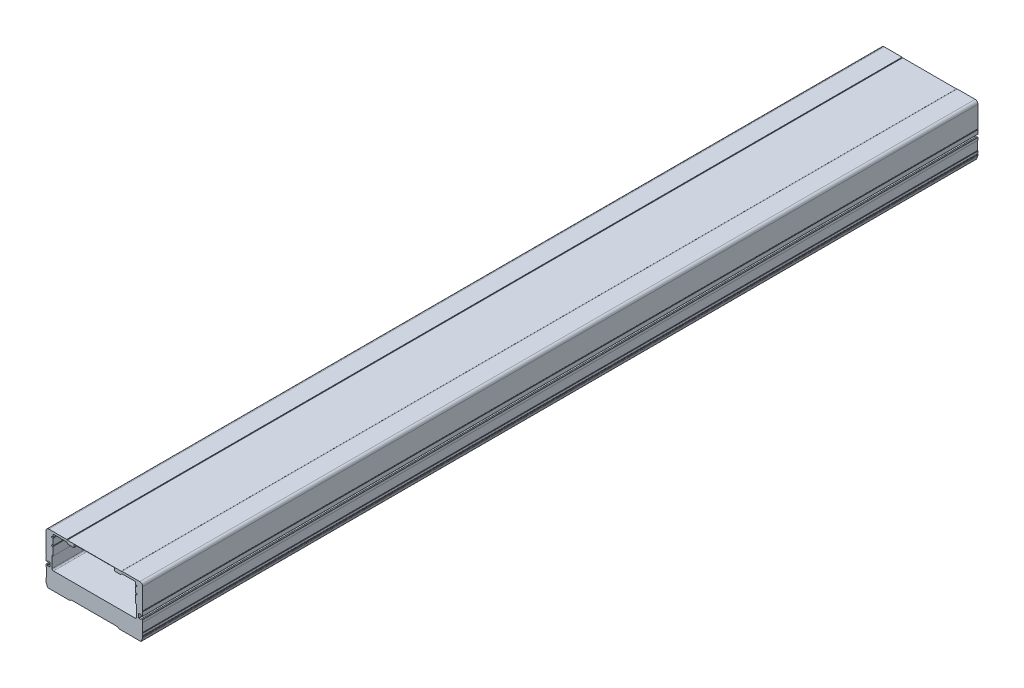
ISO-10303-21;
HEADER;
FILE_DESCRIPTION(('STEP AP214'),'2;1');
FILE_NAME('part.step','',(''),(''),'','','');
FILE_SCHEMA(('AUTOMOTIVE_DESIGN { 1 0 10303 214 1 1 1 1 }'));
ENDSEC;
DATA;
#1=APPLICATION_CONTEXT('core data for automotive mechanical design processes');
#2=APPLICATION_PROTOCOL_DEFINITION('international standard','automotive_design',2000,#1);
#3=PRODUCT_CONTEXT('',#1,'mechanical');
#4=PRODUCT('Part','Part','',(#3));
#5=PRODUCT_RELATED_PRODUCT_CATEGORY('part','',(#4));
#6=PRODUCT_DEFINITION_FORMATION('','',#4);
#7=PRODUCT_DEFINITION_CONTEXT('part definition',#1,'design');
#8=PRODUCT_DEFINITION('design','',#6,#7);
#9=PRODUCT_DEFINITION_SHAPE('','',#8);
#10=(LENGTH_UNIT() NAMED_UNIT(*) SI_UNIT(.MILLI.,.METRE.));
#11=(NAMED_UNIT(*) PLANE_ANGLE_UNIT() SI_UNIT($,.RADIAN.));
#12=(NAMED_UNIT(*) SI_UNIT($,.STERADIAN.) SOLID_ANGLE_UNIT());
#13=UNCERTAINTY_MEASURE_WITH_UNIT(LENGTH_MEASURE(1.E-05),#10,'distance_accuracy_value','');
#14=(GEOMETRIC_REPRESENTATION_CONTEXT(3) GLOBAL_UNCERTAINTY_ASSIGNED_CONTEXT((#13)) GLOBAL_UNIT_ASSIGNED_CONTEXT((#10,
#11,#12)) REPRESENTATION_CONTEXT('',''));
#15=CARTESIAN_POINT('',(0.,0.,0.));
#16=DIRECTION('',(0.,0.,1.));
#17=DIRECTION('',(1.,0.,0.));
#18=AXIS2_PLACEMENT_3D('',#15,#16,#17);
#19=CARTESIAN_POINT('',(-63.4999999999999,66.1,-1167.));
#20=DIRECTION('',(0.,0.,1.));
#21=DIRECTION('',(1.,0.,0.));
#22=AXIS2_PLACEMENT_3D('',#19,#20,#21);
#23=CYLINDRICAL_SURFACE('',#22,4.);
#24=CARTESIAN_POINT('',(-63.4999999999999,66.1,0.));
#25=DIRECTION('',(0.,0.,1.));
#26=DIRECTION('',(1.,0.,0.));
#27=AXIS2_PLACEMENT_3D('',#24,#25,#26);
#28=CIRCLE('',#27,4.);
#29=CARTESIAN_POINT('',(-63.4999999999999,70.1,0.));
#30=VERTEX_POINT('',#29);
#31=CARTESIAN_POINT('',(-67.4999999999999,66.1,0.));
#32=VERTEX_POINT('',#31);
#33=EDGE_CURVE('E1037',#30,#32,#28,.T.);
#34=ORIENTED_EDGE('',*,*,#33,.F.);
#35=DIRECTION('',(0.,0.,1.));
#36=VECTOR('',#35,1.);
#37=CARTESIAN_POINT('',(-63.4999999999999,70.1,-1167.));
#38=LINE('',#37,#36);
#39=CARTESIAN_POINT('',(-63.4999999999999,70.1,-1167.));
#40=VERTEX_POINT('',#39);
#41=EDGE_CURVE('E11',#40,#30,#38,.T.);
#42=ORIENTED_EDGE('',*,*,#41,.F.);
#43=CARTESIAN_POINT('',(-63.4999999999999,66.1,-1167.));
#44=DIRECTION('',(0.,0.,1.));
#45=DIRECTION('',(1.,0.,0.));
#46=AXIS2_PLACEMENT_3D('',#43,#44,#45);
#47=CIRCLE('',#46,4.);
#48=CARTESIAN_POINT('',(-67.4999999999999,66.1,-1167.));
#49=VERTEX_POINT('',#48);
#50=EDGE_CURVE('E1097',#40,#49,#47,.T.);
#51=ORIENTED_EDGE('',*,*,#50,.T.);
#52=DIRECTION('',(0.,0.,1.));
#53=VECTOR('',#52,1.);
#54=CARTESIAN_POINT('',(-67.4999999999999,66.1,-1167.));
#55=LINE('',#54,#53);
#56=EDGE_CURVE('E39',#49,#32,#55,.T.);
#57=ORIENTED_EDGE('',*,*,#56,.T.);
#58=EDGE_LOOP('',(#34,#42,#51,#57));
#59=FACE_BOUND('',#58,.T.);
#60=ADVANCED_FACE('F36',(#59),#23,.T.);
#61=CARTESIAN_POINT('',(-38.4999999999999,70.1,-1167.));
#62=DIRECTION('',(0.,1.,0.));
#63=DIRECTION('',(-1.,0.,0.));
#64=AXIS2_PLACEMENT_3D('',#61,#62,#63);
#65=PLANE('',#64);
#66=DIRECTION('',(-1.,0.,0.));
#67=VECTOR('',#66,1.);
#68=CARTESIAN_POINT('',(-38.4999999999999,70.1,0.));
#69=LINE('',#68,#67);
#70=CARTESIAN_POINT('',(-38.4999999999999,70.1,0.));
#71=VERTEX_POINT('',#70);
#72=EDGE_CURVE('E1101',#71,#30,#69,.T.);
#73=ORIENTED_EDGE('',*,*,#72,.F.);
#74=DIRECTION('',(0.,0.,1.));
#75=VECTOR('',#74,1.);
#76=CARTESIAN_POINT('',(-38.4999999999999,70.1,-1167.));
#77=LINE('',#76,#75);
#78=CARTESIAN_POINT('',(-38.4999999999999,70.1,-1167.));
#79=VERTEX_POINT('',#78);
#80=EDGE_CURVE('E44',#79,#71,#77,.T.);
#81=ORIENTED_EDGE('',*,*,#80,.F.);
#82=DIRECTION('',(-1.,0.,0.));
#83=VECTOR('',#82,1.);
#84=CARTESIAN_POINT('',(-38.4999999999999,70.1,-1167.));
#85=LINE('',#84,#83);
#86=EDGE_CURVE('E1335',#79,#40,#85,.T.);
#87=ORIENTED_EDGE('',*,*,#86,.T.);
#88=ORIENTED_EDGE('',*,*,#41,.T.);
#89=EDGE_LOOP('',(#73,#81,#87,#88));
#90=FACE_BOUND('',#89,.T.);
#91=ADVANCED_FACE('F1742',(#90),#65,.T.);
#92=CARTESIAN_POINT('',(-37.9999999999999,69.6,-1167.));
#93=DIRECTION('',(0.707106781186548,0.707106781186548,0.));
#94=DIRECTION('',(-0.707106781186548,0.707106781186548,0.));
#95=AXIS2_PLACEMENT_3D('',#92,#93,#94);
#96=PLANE('',#95);
#97=DIRECTION('',(-0.707106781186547,0.707106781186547,0.));
#98=VECTOR('',#97,1.);
#99=CARTESIAN_POINT('',(-37.9999999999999,69.6,0.));
#100=LINE('',#99,#98);
#101=CARTESIAN_POINT('',(-37.9999999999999,69.6,0.));
#102=VERTEX_POINT('',#101);
#103=EDGE_CURVE('E1571',#102,#71,#100,.T.);
#104=ORIENTED_EDGE('',*,*,#103,.F.);
#105=DIRECTION('',(0.,0.,1.));
#106=VECTOR('',#105,1.);
#107=CARTESIAN_POINT('',(-37.9999999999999,69.6,-1167.));
#108=LINE('',#107,#106);
#109=CARTESIAN_POINT('',(-37.9999999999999,69.6,-1167.));
#110=VERTEX_POINT('',#109);
#111=EDGE_CURVE('E1577',#110,#102,#108,.T.);
#112=ORIENTED_EDGE('',*,*,#111,.F.);
#113=DIRECTION('',(-0.707106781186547,0.707106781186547,0.));
#114=VECTOR('',#113,1.);
#115=CARTESIAN_POINT('',(-37.9999999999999,69.6,-1167.));
#116=LINE('',#115,#114);
#117=EDGE_CURVE('E1332',#110,#79,#116,.T.);
#118=ORIENTED_EDGE('',*,*,#117,.T.);
#119=ORIENTED_EDGE('',*,*,#80,.T.);
#120=EDGE_LOOP('',(#104,#112,#118,#119));
#121=FACE_BOUND('',#120,.T.);
#122=ADVANCED_FACE('F2051',(#121),#96,.T.);
#123=CARTESIAN_POINT('',(-37.4999999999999,69.6,-1167.));
#124=DIRECTION('',(0.,1.,0.));
#125=DIRECTION('',(0.,0.,1.));
#126=AXIS2_PLACEMENT_3D('',#123,#124,#125);
#127=PLANE('',#126);
#128=DIRECTION('',(-1.,0.,0.));
#129=VECTOR('',#128,1.);
#130=CARTESIAN_POINT('',(-37.4999999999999,69.6,0.));
#131=LINE('',#130,#129);
#132=CARTESIAN_POINT('',(-37.4999999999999,69.6,0.));
#133=VERTEX_POINT('',#132);
#134=EDGE_CURVE('E1568',#133,#102,#131,.T.);
#135=ORIENTED_EDGE('',*,*,#134,.F.);
#136=DIRECTION('',(0.,0.,1.));
#137=VECTOR('',#136,1.);
#138=CARTESIAN_POINT('',(-37.4999999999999,69.6,-1167.));
#139=LINE('',#138,#137);
#140=CARTESIAN_POINT('',(-37.4999999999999,69.6,-1167.));
#141=VERTEX_POINT('',#140);
#142=EDGE_CURVE('E1579',#141,#133,#139,.T.);
#143=ORIENTED_EDGE('',*,*,#142,.F.);
#144=DIRECTION('',(-1.,0.,0.));
#145=VECTOR('',#144,1.);
#146=CARTESIAN_POINT('',(-37.4999999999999,69.6,-1167.));
#147=LINE('',#146,#145);
#148=EDGE_CURVE('E1329',#141,#110,#147,.T.);
#149=ORIENTED_EDGE('',*,*,#148,.T.);
#150=ORIENTED_EDGE('',*,*,#111,.T.);
#151=EDGE_LOOP('',(#135,#143,#149,#150));
#152=FACE_BOUND('',#151,.T.);
#153=ADVANCED_FACE('F2049',(#152),#127,.T.);
#154=CARTESIAN_POINT('',(-37.4999999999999,69.7,-1167.));
#155=DIRECTION('',(-1.,0.,0.));
#156=DIRECTION('',(0.,0.,1.));
#157=AXIS2_PLACEMENT_3D('',#154,#155,#156);
#158=PLANE('',#157);
#159=DIRECTION('',(0.,-1.,0.));
#160=VECTOR('',#159,1.);
#161=CARTESIAN_POINT('',(-37.4999999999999,69.7,0.));
#162=LINE('',#161,#160);
#163=CARTESIAN_POINT('',(-37.4999999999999,69.7,0.));
#164=VERTEX_POINT('',#163);
#165=EDGE_CURVE('E1565',#164,#133,#162,.T.);
#166=ORIENTED_EDGE('',*,*,#165,.F.);
#167=DIRECTION('',(0.,0.,1.));
#168=VECTOR('',#167,1.);
#169=CARTESIAN_POINT('',(-37.4999999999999,69.7,-1167.));
#170=LINE('',#169,#168);
#171=CARTESIAN_POINT('',(-37.4999999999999,69.7,-1167.));
#172=VERTEX_POINT('',#171);
#173=EDGE_CURVE('E1581',#172,#164,#170,.T.);
#174=ORIENTED_EDGE('',*,*,#173,.F.);
#175=DIRECTION('',(0.,-1.,0.));
#176=VECTOR('',#175,1.);
#177=CARTESIAN_POINT('',(-37.4999999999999,69.7,-1167.));
#178=LINE('',#177,#176);
#179=EDGE_CURVE('E1326',#172,#141,#178,.T.);
#180=ORIENTED_EDGE('',*,*,#179,.T.);
#181=ORIENTED_EDGE('',*,*,#142,.T.);
#182=EDGE_LOOP('',(#166,#174,#180,#181));
#183=FACE_BOUND('',#182,.T.);
#184=ADVANCED_FACE('F2045',(#183),#158,.T.);
#185=CARTESIAN_POINT('',(37.4999999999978,69.7,-1167.));
#186=DIRECTION('',(0.,1.,0.));
#187=DIRECTION('',(0.,0.,1.));
#188=AXIS2_PLACEMENT_3D('',#185,#186,#187);
#189=PLANE('',#188);
#190=DIRECTION('',(-1.,0.,0.));
#191=VECTOR('',#190,1.);
#192=CARTESIAN_POINT('',(37.4999999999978,69.7,0.));
#193=LINE('',#192,#191);
#194=CARTESIAN_POINT('',(37.4999999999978,69.7,0.));
#195=VERTEX_POINT('',#194);
#196=EDGE_CURVE('E1562',#195,#164,#193,.T.);
#197=ORIENTED_EDGE('',*,*,#196,.F.);
#198=DIRECTION('',(0.,0.,1.));
#199=VECTOR('',#198,1.);
#200=CARTESIAN_POINT('',(37.4999999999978,69.7,-1167.));
#201=LINE('',#200,#199);
#202=CARTESIAN_POINT('',(37.4999999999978,69.7,-1167.));
#203=VERTEX_POINT('',#202);
#204=EDGE_CURVE('E1583',#203,#195,#201,.T.);
#205=ORIENTED_EDGE('',*,*,#204,.F.);
#206=DIRECTION('',(-1.,0.,0.));
#207=VECTOR('',#206,1.);
#208=CARTESIAN_POINT('',(37.4999999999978,69.7,-1167.));
#209=LINE('',#208,#207);
#210=EDGE_CURVE('E1323',#203,#172,#209,.T.);
#211=ORIENTED_EDGE('',*,*,#210,.T.);
#212=ORIENTED_EDGE('',*,*,#173,.T.);
#213=EDGE_LOOP('',(#197,#205,#211,#212));
#214=FACE_BOUND('',#213,.T.);
#215=ADVANCED_FACE('F2041',(#214),#189,.T.);
#216=CARTESIAN_POINT('',(37.4999999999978,69.6000000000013,-1167.));
#217=DIRECTION('',(1.,0.,0.));
#218=DIRECTION('',(0.,0.,-1.));
#219=AXIS2_PLACEMENT_3D('',#216,#217,#218);
#220=PLANE('',#219);
#221=DIRECTION('',(0.,1.,0.));
#222=VECTOR('',#221,1.);
#223=CARTESIAN_POINT('',(37.4999999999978,69.6000000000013,0.));
#224=LINE('',#223,#222);
#225=CARTESIAN_POINT('',(37.4999999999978,69.6000000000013,0.));
#226=VERTEX_POINT('',#225);
#227=EDGE_CURVE('E1559',#226,#195,#224,.T.);
#228=ORIENTED_EDGE('',*,*,#227,.F.);
#229=DIRECTION('',(0.,0.,1.));
#230=VECTOR('',#229,1.);
#231=CARTESIAN_POINT('',(37.4999999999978,69.6000000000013,-1167.));
#232=LINE('',#231,#230);
#233=CARTESIAN_POINT('',(37.4999999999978,69.6000000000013,-1167.));
#234=VERTEX_POINT('',#233);
#235=EDGE_CURVE('E1585',#234,#226,#232,.T.);
#236=ORIENTED_EDGE('',*,*,#235,.F.);
#237=DIRECTION('',(0.,1.,0.));
#238=VECTOR('',#237,1.);
#239=CARTESIAN_POINT('',(37.4999999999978,69.6000000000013,-1167.));
#240=LINE('',#239,#238);
#241=EDGE_CURVE('E1320',#234,#203,#240,.T.);
#242=ORIENTED_EDGE('',*,*,#241,.T.);
#243=ORIENTED_EDGE('',*,*,#204,.T.);
#244=EDGE_LOOP('',(#228,#236,#242,#243));
#245=FACE_BOUND('',#244,.T.);
#246=ADVANCED_FACE('F2037',(#245),#220,.T.);
#247=CARTESIAN_POINT('',(37.9999999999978,69.6000000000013,-1167.));
#248=DIRECTION('',(0.,1.,0.));
#249=DIRECTION('',(0.,0.,1.));
#250=AXIS2_PLACEMENT_3D('',#247,#248,#249);
#251=PLANE('',#250);
#252=DIRECTION('',(-1.,0.,0.));
#253=VECTOR('',#252,1.);
#254=CARTESIAN_POINT('',(37.9999999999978,69.6000000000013,0.));
#255=LINE('',#254,#253);
#256=CARTESIAN_POINT('',(37.9999999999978,69.6000000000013,0.));
#257=VERTEX_POINT('',#256);
#258=EDGE_CURVE('E1556',#257,#226,#255,.T.);
#259=ORIENTED_EDGE('',*,*,#258,.F.);
#260=DIRECTION('',(0.,0.,1.));
#261=VECTOR('',#260,1.);
#262=CARTESIAN_POINT('',(37.9999999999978,69.6000000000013,-1167.));
#263=LINE('',#262,#261);
#264=CARTESIAN_POINT('',(37.9999999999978,69.6000000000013,-1167.));
#265=VERTEX_POINT('',#264);
#266=EDGE_CURVE('E1587',#265,#257,#263,.T.);
#267=ORIENTED_EDGE('',*,*,#266,.F.);
#268=DIRECTION('',(-1.,0.,0.));
#269=VECTOR('',#268,1.);
#270=CARTESIAN_POINT('',(37.9999999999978,69.6000000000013,-1167.));
#271=LINE('',#270,#269);
#272=EDGE_CURVE('E1317',#265,#234,#271,.T.);
#273=ORIENTED_EDGE('',*,*,#272,.T.);
#274=ORIENTED_EDGE('',*,*,#235,.T.);
#275=EDGE_LOOP('',(#259,#267,#273,#274));
#276=FACE_BOUND('',#275,.T.);
#277=ADVANCED_FACE('F2033',(#276),#251,.T.);
#278=CARTESIAN_POINT('',(38.4999999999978,70.1000000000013,-1167.));
#279=DIRECTION('',(-0.707106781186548,0.707106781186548,0.));
#280=DIRECTION('',(-0.707106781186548,-0.707106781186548,0.));
#281=AXIS2_PLACEMENT_3D('',#278,#279,#280);
#282=PLANE('',#281);
#283=DIRECTION('',(-0.707106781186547,-0.707106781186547,0.));
#284=VECTOR('',#283,1.);
#285=CARTESIAN_POINT('',(38.4999999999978,70.1000000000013,0.));
#286=LINE('',#285,#284);
#287=CARTESIAN_POINT('',(38.4999999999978,70.1000000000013,0.));
#288=VERTEX_POINT('',#287);
#289=EDGE_CURVE('E1553',#288,#257,#286,.T.);
#290=ORIENTED_EDGE('',*,*,#289,.F.);
#291=DIRECTION('',(0.,0.,1.));
#292=VECTOR('',#291,1.);
#293=CARTESIAN_POINT('',(38.4999999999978,70.1000000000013,-1167.));
#294=LINE('',#293,#292);
#295=CARTESIAN_POINT('',(38.4999999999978,70.1000000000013,-1167.));
#296=VERTEX_POINT('',#295);
#297=EDGE_CURVE('E1589',#296,#288,#294,.T.);
#298=ORIENTED_EDGE('',*,*,#297,.F.);
#299=DIRECTION('',(-0.707106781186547,-0.707106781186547,0.));
#300=VECTOR('',#299,1.);
#301=CARTESIAN_POINT('',(38.4999999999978,70.1000000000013,-1167.));
#302=LINE('',#301,#300);
#303=EDGE_CURVE('E1314',#296,#265,#302,.T.);
#304=ORIENTED_EDGE('',*,*,#303,.T.);
#305=ORIENTED_EDGE('',*,*,#266,.T.);
#306=EDGE_LOOP('',(#290,#298,#304,#305));
#307=FACE_BOUND('',#306,.T.);
#308=ADVANCED_FACE('F2029',(#307),#282,.T.);
#309=CARTESIAN_POINT('',(63.4999999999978,70.1000000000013,-1167.));
#310=DIRECTION('',(0.,1.,0.));
#311=DIRECTION('',(0.,0.,1.));
#312=AXIS2_PLACEMENT_3D('',#309,#310,#311);
#313=PLANE('',#312);
#314=DIRECTION('',(-1.,0.,0.));
#315=VECTOR('',#314,1.);
#316=CARTESIAN_POINT('',(63.4999999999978,70.1000000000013,0.));
#317=LINE('',#316,#315);
#318=CARTESIAN_POINT('',(63.4999999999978,70.1000000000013,0.));
#319=VERTEX_POINT('',#318);
#320=EDGE_CURVE('E1550',#319,#288,#317,.T.);
#321=ORIENTED_EDGE('',*,*,#320,.F.);
#322=DIRECTION('',(0.,0.,1.));
#323=VECTOR('',#322,1.);
#324=CARTESIAN_POINT('',(63.4999999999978,70.1000000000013,-1167.));
#325=LINE('',#324,#323);
#326=CARTESIAN_POINT('',(63.4999999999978,70.1000000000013,-1167.));
#327=VERTEX_POINT('',#326);
#328=EDGE_CURVE('E1591',#327,#319,#325,.T.);
#329=ORIENTED_EDGE('',*,*,#328,.F.);
#330=DIRECTION('',(-1.,0.,0.));
#331=VECTOR('',#330,1.);
#332=CARTESIAN_POINT('',(63.4999999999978,70.1000000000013,-1167.));
#333=LINE('',#332,#331);
#334=EDGE_CURVE('E1311',#327,#296,#333,.T.);
#335=ORIENTED_EDGE('',*,*,#334,.T.);
#336=ORIENTED_EDGE('',*,*,#297,.T.);
#337=EDGE_LOOP('',(#321,#329,#335,#336));
#338=FACE_BOUND('',#337,.T.);
#339=ADVANCED_FACE('F2025',(#338),#313,.T.);
#340=CARTESIAN_POINT('',(63.4999999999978,66.1000000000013,-1167.));
#341=DIRECTION('',(0.,0.,1.));
#342=DIRECTION('',(1.,0.,0.));
#343=AXIS2_PLACEMENT_3D('',#340,#341,#342);
#344=CYLINDRICAL_SURFACE('',#343,4.);
#345=CARTESIAN_POINT('',(63.4999999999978,66.1000000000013,0.));
#346=DIRECTION('',(0.,0.,1.));
#347=DIRECTION('',(1.,0.,0.));
#348=AXIS2_PLACEMENT_3D('',#345,#346,#347);
#349=CIRCLE('',#348,4.);
#350=CARTESIAN_POINT('',(67.4999999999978,66.1000000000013,0.));
#351=VERTEX_POINT('',#350);
#352=EDGE_CURVE('E1547',#351,#319,#349,.T.);
#353=ORIENTED_EDGE('',*,*,#352,.F.);
#354=DIRECTION('',(0.,0.,1.));
#355=VECTOR('',#354,1.);
#356=CARTESIAN_POINT('',(67.4999999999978,66.1000000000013,-1167.));
#357=LINE('',#356,#355);
#358=CARTESIAN_POINT('',(67.4999999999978,66.1000000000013,-1167.));
#359=VERTEX_POINT('',#358);
#360=EDGE_CURVE('E1593',#359,#351,#357,.T.);
#361=ORIENTED_EDGE('',*,*,#360,.F.);
#362=CARTESIAN_POINT('',(63.4999999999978,66.1000000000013,-1167.));
#363=DIRECTION('',(0.,0.,1.));
#364=DIRECTION('',(1.,0.,0.));
#365=AXIS2_PLACEMENT_3D('',#362,#363,#364);
#366=CIRCLE('',#365,4.);
#367=EDGE_CURVE('E1308',#359,#327,#366,.T.);
#368=ORIENTED_EDGE('',*,*,#367,.T.);
#369=ORIENTED_EDGE('',*,*,#328,.T.);
#370=EDGE_LOOP('',(#353,#361,#368,#369));
#371=FACE_BOUND('',#370,.T.);
#372=ADVANCED_FACE('F2021',(#371),#344,.T.);
#373=CARTESIAN_POINT('',(67.4999999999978,36.6046693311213,-1167.));
#374=DIRECTION('',(1.,0.,0.));
#375=DIRECTION('',(0.,0.,-1.));
#376=AXIS2_PLACEMENT_3D('',#373,#374,#375);
#377=PLANE('',#376);
#378=DIRECTION('',(0.,1.,0.));
#379=VECTOR('',#378,1.);
#380=CARTESIAN_POINT('',(67.4999999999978,36.6046693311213,0.));
#381=LINE('',#380,#379);
#382=CARTESIAN_POINT('',(67.4999999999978,36.6046693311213,0.));
#383=VERTEX_POINT('',#382);
#384=EDGE_CURVE('E1544',#383,#351,#381,.T.);
#385=ORIENTED_EDGE('',*,*,#384,.F.);
#386=DIRECTION('',(0.,0.,1.));
#387=VECTOR('',#386,1.);
#388=CARTESIAN_POINT('',(67.4999999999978,36.6046693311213,-1167.));
#389=LINE('',#388,#387);
#390=CARTESIAN_POINT('',(67.4999999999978,36.6046693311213,-1167.));
#391=VERTEX_POINT('',#390);
#392=EDGE_CURVE('E1595',#391,#383,#389,.T.);
#393=ORIENTED_EDGE('',*,*,#392,.F.);
#394=DIRECTION('',(0.,1.,0.));
#395=VECTOR('',#394,1.);
#396=CARTESIAN_POINT('',(67.4999999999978,36.6046693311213,-1167.));
#397=LINE('',#396,#395);
#398=EDGE_CURVE('E1305',#391,#359,#397,.T.);
#399=ORIENTED_EDGE('',*,*,#398,.T.);
#400=ORIENTED_EDGE('',*,*,#360,.T.);
#401=EDGE_LOOP('',(#385,#393,#399,#400));
#402=FACE_BOUND('',#401,.T.);
#403=ADVANCED_FACE('F2017',(#402),#377,.T.);
#404=CARTESIAN_POINT('',(67.1999999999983,36.6046693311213,-1167.));
#405=DIRECTION('',(0.,0.,1.));
#406=DIRECTION('',(1.,0.,0.));
#407=AXIS2_PLACEMENT_3D('',#404,#405,#406);
#408=CYLINDRICAL_SURFACE('',#407,0.299999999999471);
#409=CARTESIAN_POINT('',(67.1999999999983,36.6046693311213,0.));
#410=DIRECTION('',(0.,0.,1.));
#411=DIRECTION('',(1.,0.,0.));
#412=AXIS2_PLACEMENT_3D('',#409,#410,#411);
#413=CIRCLE('',#412,0.299999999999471);
#414=CARTESIAN_POINT('',(67.3333333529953,36.3359274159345,0.));
#415=VERTEX_POINT('',#414);
#416=EDGE_CURVE('E1541',#415,#383,#413,.T.);
#417=ORIENTED_EDGE('',*,*,#416,.F.);
#418=DIRECTION('',(0.,0.,1.));
#419=VECTOR('',#418,1.);
#420=CARTESIAN_POINT('',(67.3333333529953,36.3359274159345,-1167.));
#421=LINE('',#420,#419);
#422=CARTESIAN_POINT('',(67.3333333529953,36.3359274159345,-1167.));
#423=VERTEX_POINT('',#422);
#424=EDGE_CURVE('E1597',#423,#415,#421,.T.);
#425=ORIENTED_EDGE('',*,*,#424,.F.);
#426=CARTESIAN_POINT('',(67.1999999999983,36.6046693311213,-1167.));
#427=DIRECTION('',(0.,0.,1.));
#428=DIRECTION('',(1.,0.,0.));
#429=AXIS2_PLACEMENT_3D('',#426,#427,#428);
#430=CIRCLE('',#429,0.299999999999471);
#431=EDGE_CURVE('E1302',#423,#391,#430,.T.);
#432=ORIENTED_EDGE('',*,*,#431,.T.);
#433=ORIENTED_EDGE('',*,*,#392,.T.);
#434=EDGE_LOOP('',(#417,#425,#432,#433));
#435=FACE_BOUND('',#434,.T.);
#436=ADVANCED_FACE('F2013',(#435),#408,.T.);
#437=CARTESIAN_POINT('',(67.4999999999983,36.0000000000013,-1167.));
#438=DIRECTION('',(0.,0.,1.));
#439=DIRECTION('',(1.,0.,0.));
#440=AXIS2_PLACEMENT_3D('',#437,#438,#439);
#441=CYLINDRICAL_SURFACE('',#440,0.374999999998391);
#442=CARTESIAN_POINT('',(67.4999999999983,36.0000000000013,0.));
#443=DIRECTION('',(0.,0.,-1.));
#444=DIRECTION('',(1.,0.,0.));
#445=AXIS2_PLACEMENT_3D('',#442,#443,#444);
#446=CIRCLE('',#445,0.374999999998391);
#447=CARTESIAN_POINT('',(67.3333333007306,35.6640726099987,0.));
#448=VERTEX_POINT('',#447);
#449=EDGE_CURVE('E1538',#448,#415,#446,.T.);
#450=ORIENTED_EDGE('',*,*,#449,.F.);
#451=DIRECTION('',(0.,0.,1.));
#452=VECTOR('',#451,1.);
#453=CARTESIAN_POINT('',(67.3333333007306,35.6640726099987,-1167.));
#454=LINE('',#453,#452);
#455=CARTESIAN_POINT('',(67.3333333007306,35.6640726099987,-1167.));
#456=VERTEX_POINT('',#455);
#457=EDGE_CURVE('E1599',#456,#448,#454,.T.);
#458=ORIENTED_EDGE('',*,*,#457,.F.);
#459=CARTESIAN_POINT('',(67.4999999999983,36.0000000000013,-1167.));
#460=DIRECTION('',(0.,0.,-1.));
#461=DIRECTION('',(1.,0.,0.));
#462=AXIS2_PLACEMENT_3D('',#459,#460,#461);
#463=CIRCLE('',#462,0.374999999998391);
#464=EDGE_CURVE('E1299',#456,#423,#463,.T.);
#465=ORIENTED_EDGE('',*,*,#464,.T.);
#466=ORIENTED_EDGE('',*,*,#424,.T.);
#467=EDGE_LOOP('',(#450,#458,#465,#466));
#468=FACE_BOUND('',#467,.T.);
#469=ADVANCED_FACE('F2009',(#468),#441,.F.);
#470=CARTESIAN_POINT('',(67.1999999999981,35.3953306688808,-1167.));
#471=DIRECTION('',(0.,0.,1.));
#472=DIRECTION('',(1.,0.,0.));
#473=AXIS2_PLACEMENT_3D('',#470,#471,#472);
#474=CYLINDRICAL_SURFACE('',#473,0.299999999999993);
#475=CARTESIAN_POINT('',(67.1999999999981,35.3953306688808,0.));
#476=DIRECTION('',(0.,0.,1.));
#477=DIRECTION('',(1.,0.,0.));
#478=AXIS2_PLACEMENT_3D('',#475,#476,#477);
#479=CIRCLE('',#478,0.299999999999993);
#480=CARTESIAN_POINT('',(67.4999999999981,35.3953306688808,0.));
#481=VERTEX_POINT('',#480);
#482=EDGE_CURVE('E1535',#481,#448,#479,.T.);
#483=ORIENTED_EDGE('',*,*,#482,.F.);
#484=DIRECTION('',(0.,0.,1.));
#485=VECTOR('',#484,1.);
#486=CARTESIAN_POINT('',(67.4999999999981,35.3953306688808,-1167.));
#487=LINE('',#486,#485);
#488=CARTESIAN_POINT('',(67.4999999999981,35.3953306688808,-1167.));
#489=VERTEX_POINT('',#488);
#490=EDGE_CURVE('E1601',#489,#481,#487,.T.);
#491=ORIENTED_EDGE('',*,*,#490,.F.);
#492=CARTESIAN_POINT('',(67.1999999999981,35.3953306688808,-1167.));
#493=DIRECTION('',(0.,0.,1.));
#494=DIRECTION('',(1.,0.,0.));
#495=AXIS2_PLACEMENT_3D('',#492,#493,#494);
#496=CIRCLE('',#495,0.299999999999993);
#497=EDGE_CURVE('E1296',#489,#456,#496,.T.);
#498=ORIENTED_EDGE('',*,*,#497,.T.);
#499=ORIENTED_EDGE('',*,*,#457,.T.);
#500=EDGE_LOOP('',(#483,#491,#498,#499));
#501=FACE_BOUND('',#500,.T.);
#502=ADVANCED_FACE('F2005',(#501),#474,.T.);
#503=CARTESIAN_POINT('',(67.4999999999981,30.1000000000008,-1167.));
#504=DIRECTION('',(1.,0.,0.));
#505=DIRECTION('',(0.,0.,-1.));
#506=AXIS2_PLACEMENT_3D('',#503,#504,#505);
#507=PLANE('',#506);
#508=DIRECTION('',(0.,1.,0.));
#509=VECTOR('',#508,1.);
#510=CARTESIAN_POINT('',(67.4999999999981,30.1000000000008,0.));
#511=LINE('',#510,#509);
#512=CARTESIAN_POINT('',(67.4999999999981,30.1000000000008,0.));
#513=VERTEX_POINT('',#512);
#514=EDGE_CURVE('E1532',#513,#481,#511,.T.);
#515=ORIENTED_EDGE('',*,*,#514,.F.);
#516=DIRECTION('',(0.,0.,1.));
#517=VECTOR('',#516,1.);
#518=CARTESIAN_POINT('',(67.4999999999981,30.1000000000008,-1167.));
#519=LINE('',#518,#517);
#520=CARTESIAN_POINT('',(67.4999999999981,30.1000000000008,-1167.));
#521=VERTEX_POINT('',#520);
#522=EDGE_CURVE('E1603',#521,#513,#519,.T.);
#523=ORIENTED_EDGE('',*,*,#522,.F.);
#524=DIRECTION('',(0.,1.,0.));
#525=VECTOR('',#524,1.);
#526=CARTESIAN_POINT('',(67.4999999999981,30.1000000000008,-1167.));
#527=LINE('',#526,#525);
#528=EDGE_CURVE('E1293',#521,#489,#527,.T.);
#529=ORIENTED_EDGE('',*,*,#528,.T.);
#530=ORIENTED_EDGE('',*,*,#490,.T.);
#531=EDGE_LOOP('',(#515,#523,#529,#530));
#532=FACE_BOUND('',#531,.T.);
#533=ADVANCED_FACE('F2001',(#532),#507,.T.);
#534=CARTESIAN_POINT('',(67.1999999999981,30.1000000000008,-1167.));
#535=DIRECTION('',(0.,0.,1.));
#536=DIRECTION('',(1.,0.,0.));
#537=AXIS2_PLACEMENT_3D('',#534,#535,#536);
#538=CYLINDRICAL_SURFACE('',#537,0.299999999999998);
#539=CARTESIAN_POINT('',(67.1999999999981,30.1000000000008,0.));
#540=DIRECTION('',(0.,0.,1.));
#541=DIRECTION('',(1.,0.,0.));
#542=AXIS2_PLACEMENT_3D('',#539,#540,#541);
#543=CIRCLE('',#542,0.299999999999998);
#544=CARTESIAN_POINT('',(67.1999999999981,29.8000000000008,0.));
#545=VERTEX_POINT('',#544);
#546=EDGE_CURVE('E1529',#545,#513,#543,.T.);
#547=ORIENTED_EDGE('',*,*,#546,.F.);
#548=DIRECTION('',(0.,0.,1.));
#549=VECTOR('',#548,1.);
#550=CARTESIAN_POINT('',(67.1999999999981,29.8000000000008,-1167.));
#551=LINE('',#550,#549);
#552=CARTESIAN_POINT('',(67.1999999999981,29.8000000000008,-1167.));
#553=VERTEX_POINT('',#552);
#554=EDGE_CURVE('E1605',#553,#545,#551,.T.);
#555=ORIENTED_EDGE('',*,*,#554,.F.);
#556=CARTESIAN_POINT('',(67.1999999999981,30.1000000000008,-1167.));
#557=DIRECTION('',(0.,0.,1.));
#558=DIRECTION('',(1.,0.,0.));
#559=AXIS2_PLACEMENT_3D('',#556,#557,#558);
#560=CIRCLE('',#559,0.299999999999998);
#561=EDGE_CURVE('E1290',#553,#521,#560,.T.);
#562=ORIENTED_EDGE('',*,*,#561,.T.);
#563=ORIENTED_EDGE('',*,*,#522,.T.);
#564=EDGE_LOOP('',(#547,#555,#562,#563));
#565=FACE_BOUND('',#564,.T.);
#566=ADVANCED_FACE('F1997',(#565),#538,.T.);
#567=CARTESIAN_POINT('',(65.7999999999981,29.8000000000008,-1167.));
#568=DIRECTION('',(0.,-1.,0.));
#569=DIRECTION('',(0.,0.,-1.));
#570=AXIS2_PLACEMENT_3D('',#567,#568,#569);
#571=PLANE('',#570);
#572=DIRECTION('',(1.,0.,0.));
#573=VECTOR('',#572,1.);
#574=CARTESIAN_POINT('',(65.7999999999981,29.8000000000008,0.));
#575=LINE('',#574,#573);
#576=CARTESIAN_POINT('',(65.7999999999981,29.8000000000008,0.));
#577=VERTEX_POINT('',#576);
#578=EDGE_CURVE('E1526',#577,#545,#575,.T.);
#579=ORIENTED_EDGE('',*,*,#578,.F.);
#580=DIRECTION('',(0.,0.,1.));
#581=VECTOR('',#580,1.);
#582=CARTESIAN_POINT('',(65.7999999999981,29.8000000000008,-1167.));
#583=LINE('',#582,#581);
#584=CARTESIAN_POINT('',(65.7999999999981,29.8000000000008,-1167.));
#585=VERTEX_POINT('',#584);
#586=EDGE_CURVE('E1607',#585,#577,#583,.T.);
#587=ORIENTED_EDGE('',*,*,#586,.F.);
#588=DIRECTION('',(1.,0.,0.));
#589=VECTOR('',#588,1.);
#590=CARTESIAN_POINT('',(65.7999999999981,29.8000000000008,-1167.));
#591=LINE('',#590,#589);
#592=EDGE_CURVE('E1287',#585,#553,#591,.T.);
#593=ORIENTED_EDGE('',*,*,#592,.T.);
#594=ORIENTED_EDGE('',*,*,#554,.T.);
#595=EDGE_LOOP('',(#579,#587,#593,#594));
#596=FACE_BOUND('',#595,.T.);
#597=ADVANCED_FACE('F1993',(#596),#571,.T.);
#598=CARTESIAN_POINT('',(65.7999999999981,30.1000000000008,-1167.));
#599=DIRECTION('',(0.,0.,1.));
#600=DIRECTION('',(1.,0.,0.));
#601=AXIS2_PLACEMENT_3D('',#598,#599,#600);
#602=CYLINDRICAL_SURFACE('',#601,0.299999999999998);
#603=CARTESIAN_POINT('',(65.7999999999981,30.1000000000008,0.));
#604=DIRECTION('',(0.,0.,1.));
#605=DIRECTION('',(1.,0.,0.));
#606=AXIS2_PLACEMENT_3D('',#603,#604,#605);
#607=CIRCLE('',#606,0.299999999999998);
#608=CARTESIAN_POINT('',(65.4999999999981,30.1000000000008,0.));
#609=VERTEX_POINT('',#608);
#610=EDGE_CURVE('E1523',#609,#577,#607,.T.);
#611=ORIENTED_EDGE('',*,*,#610,.F.);
#612=DIRECTION('',(0.,0.,1.));
#613=VECTOR('',#612,1.);
#614=CARTESIAN_POINT('',(65.4999999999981,30.1000000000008,-1167.));
#615=LINE('',#614,#613);
#616=CARTESIAN_POINT('',(65.4999999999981,30.1000000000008,-1167.));
#617=VERTEX_POINT('',#616);
#618=EDGE_CURVE('E1609',#617,#609,#615,.T.);
#619=ORIENTED_EDGE('',*,*,#618,.F.);
#620=CARTESIAN_POINT('',(65.7999999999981,30.1000000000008,-1167.));
#621=DIRECTION('',(0.,0.,1.));
#622=DIRECTION('',(1.,0.,0.));
#623=AXIS2_PLACEMENT_3D('',#620,#621,#622);
#624=CIRCLE('',#623,0.299999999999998);
#625=EDGE_CURVE('E1284',#617,#585,#624,.T.);
#626=ORIENTED_EDGE('',*,*,#625,.T.);
#627=ORIENTED_EDGE('',*,*,#586,.T.);
#628=EDGE_LOOP('',(#611,#619,#626,#627));
#629=FACE_BOUND('',#628,.T.);
#630=ADVANCED_FACE('F1989',(#629),#602,.T.);
#631=CARTESIAN_POINT('',(65.4999999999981,30.7000000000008,-1167.));
#632=DIRECTION('',(-1.,0.,0.));
#633=DIRECTION('',(0.,0.,1.));
#634=AXIS2_PLACEMENT_3D('',#631,#632,#633);
#635=PLANE('',#634);
#636=DIRECTION('',(0.,-1.,0.));
#637=VECTOR('',#636,1.);
#638=CARTESIAN_POINT('',(65.4999999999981,30.7000000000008,0.));
#639=LINE('',#638,#637);
#640=CARTESIAN_POINT('',(65.4999999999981,30.7000000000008,0.));
#641=VERTEX_POINT('',#640);
#642=EDGE_CURVE('E1520',#641,#609,#639,.T.);
#643=ORIENTED_EDGE('',*,*,#642,.F.);
#644=DIRECTION('',(0.,0.,1.));
#645=VECTOR('',#644,1.);
#646=CARTESIAN_POINT('',(65.4999999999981,30.7000000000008,-1167.));
#647=LINE('',#646,#645);
#648=CARTESIAN_POINT('',(65.4999999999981,30.7000000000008,-1167.));
#649=VERTEX_POINT('',#648);
#650=EDGE_CURVE('E1611',#649,#641,#647,.T.);
#651=ORIENTED_EDGE('',*,*,#650,.F.);
#652=DIRECTION('',(0.,-1.,0.));
#653=VECTOR('',#652,1.);
#654=CARTESIAN_POINT('',(65.4999999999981,30.7000000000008,-1167.));
#655=LINE('',#654,#653);
#656=EDGE_CURVE('E1281',#649,#617,#655,.T.);
#657=ORIENTED_EDGE('',*,*,#656,.T.);
#658=ORIENTED_EDGE('',*,*,#618,.T.);
#659=EDGE_LOOP('',(#643,#651,#657,#658));
#660=FACE_BOUND('',#659,.T.);
#661=ADVANCED_FACE('F1985',(#660),#635,.T.);
#662=CARTESIAN_POINT('',(65.1999999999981,30.7000000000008,-1167.));
#663=DIRECTION('',(0.,0.,1.));
#664=DIRECTION('',(1.,0.,0.));
#665=AXIS2_PLACEMENT_3D('',#662,#663,#664);
#666=CYLINDRICAL_SURFACE('',#665,0.300000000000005);
#667=CARTESIAN_POINT('',(65.1999999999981,30.7000000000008,0.));
#668=DIRECTION('',(0.,0.,-1.));
#669=DIRECTION('',(1.,0.,0.));
#670=AXIS2_PLACEMENT_3D('',#667,#668,#669);
#671=CIRCLE('',#670,0.300000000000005);
#672=CARTESIAN_POINT('',(65.1999999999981,31.0000000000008,0.));
#673=VERTEX_POINT('',#672);
#674=EDGE_CURVE('E1517',#673,#641,#671,.T.);
#675=ORIENTED_EDGE('',*,*,#674,.F.);
#676=DIRECTION('',(0.,0.,1.));
#677=VECTOR('',#676,1.);
#678=CARTESIAN_POINT('',(65.1999999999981,31.0000000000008,-1167.));
#679=LINE('',#678,#677);
#680=CARTESIAN_POINT('',(65.1999999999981,31.0000000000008,-1167.));
#681=VERTEX_POINT('',#680);
#682=EDGE_CURVE('E1613',#681,#673,#679,.T.);
#683=ORIENTED_EDGE('',*,*,#682,.F.);
#684=CARTESIAN_POINT('',(65.1999999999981,30.7000000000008,-1167.));
#685=DIRECTION('',(0.,0.,-1.));
#686=DIRECTION('',(1.,0.,0.));
#687=AXIS2_PLACEMENT_3D('',#684,#685,#686);
#688=CIRCLE('',#687,0.300000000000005);
#689=EDGE_CURVE('E1278',#681,#649,#688,.T.);
#690=ORIENTED_EDGE('',*,*,#689,.T.);
#691=ORIENTED_EDGE('',*,*,#650,.T.);
#692=EDGE_LOOP('',(#675,#683,#690,#691));
#693=FACE_BOUND('',#692,.T.);
#694=ADVANCED_FACE('F1981',(#693),#666,.F.);
#695=CARTESIAN_POINT('',(62.2999999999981,31.0000000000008,-1167.));
#696=DIRECTION('',(0.,-1.,0.));
#697=DIRECTION('',(0.,0.,-1.));
#698=AXIS2_PLACEMENT_3D('',#695,#696,#697);
#699=PLANE('',#698);
#700=DIRECTION('',(1.,0.,0.));
#701=VECTOR('',#700,1.);
#702=CARTESIAN_POINT('',(62.2999999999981,31.0000000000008,0.));
#703=LINE('',#702,#701);
#704=CARTESIAN_POINT('',(62.2999999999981,31.0000000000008,0.));
#705=VERTEX_POINT('',#704);
#706=EDGE_CURVE('E1514',#705,#673,#703,.T.);
#707=ORIENTED_EDGE('',*,*,#706,.F.);
#708=DIRECTION('',(0.,0.,1.));
#709=VECTOR('',#708,1.);
#710=CARTESIAN_POINT('',(62.2999999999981,31.0000000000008,-1167.));
#711=LINE('',#710,#709);
#712=CARTESIAN_POINT('',(62.2999999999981,31.0000000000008,-1167.));
#713=VERTEX_POINT('',#712);
#714=EDGE_CURVE('E1615',#713,#705,#711,.T.);
#715=ORIENTED_EDGE('',*,*,#714,.F.);
#716=DIRECTION('',(1.,0.,0.));
#717=VECTOR('',#716,1.);
#718=CARTESIAN_POINT('',(62.2999999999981,31.0000000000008,-1167.));
#719=LINE('',#718,#717);
#720=EDGE_CURVE('E1275',#713,#681,#719,.T.);
#721=ORIENTED_EDGE('',*,*,#720,.T.);
#722=ORIENTED_EDGE('',*,*,#682,.T.);
#723=EDGE_LOOP('',(#707,#715,#721,#722));
#724=FACE_BOUND('',#723,.T.);
#725=ADVANCED_FACE('F1977',(#724),#699,.T.);
#726=CARTESIAN_POINT('',(62.2999999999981,30.7000000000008,-1167.));
#727=DIRECTION('',(0.,0.,1.));
#728=DIRECTION('',(1.,0.,0.));
#729=AXIS2_PLACEMENT_3D('',#726,#727,#728);
#730=CYLINDRICAL_SURFACE('',#729,0.300000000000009);
#731=CARTESIAN_POINT('',(62.2999999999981,30.7000000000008,0.));
#732=DIRECTION('',(0.,0.,-1.));
#733=DIRECTION('',(1.,0.,0.));
#734=AXIS2_PLACEMENT_3D('',#731,#732,#733);
#735=CIRCLE('',#734,0.300000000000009);
#736=CARTESIAN_POINT('',(61.9999999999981,30.7000000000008,0.));
#737=VERTEX_POINT('',#736);
#738=EDGE_CURVE('E1511',#737,#705,#735,.T.);
#739=ORIENTED_EDGE('',*,*,#738,.F.);
#740=DIRECTION('',(0.,0.,1.));
#741=VECTOR('',#740,1.);
#742=CARTESIAN_POINT('',(61.9999999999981,30.7000000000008,-1167.));
#743=LINE('',#742,#741);
#744=CARTESIAN_POINT('',(61.9999999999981,30.7000000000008,-1167.));
#745=VERTEX_POINT('',#744);
#746=EDGE_CURVE('E1617',#745,#737,#743,.T.);
#747=ORIENTED_EDGE('',*,*,#746,.F.);
#748=CARTESIAN_POINT('',(62.2999999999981,30.7000000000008,-1167.));
#749=DIRECTION('',(0.,0.,-1.));
#750=DIRECTION('',(1.,0.,0.));
#751=AXIS2_PLACEMENT_3D('',#748,#749,#750);
#752=CIRCLE('',#751,0.300000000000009);
#753=EDGE_CURVE('E1272',#745,#713,#752,.T.);
#754=ORIENTED_EDGE('',*,*,#753,.T.);
#755=ORIENTED_EDGE('',*,*,#714,.T.);
#756=EDGE_LOOP('',(#739,#747,#754,#755));
#757=FACE_BOUND('',#756,.T.);
#758=ADVANCED_FACE('F1973',(#757),#730,.F.);
#759=CARTESIAN_POINT('',(61.9999999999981,25.3000000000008,-1167.));
#760=DIRECTION('',(1.,0.,0.));
#761=DIRECTION('',(0.,0.,-1.));
#762=AXIS2_PLACEMENT_3D('',#759,#760,#761);
#763=PLANE('',#762);
#764=DIRECTION('',(0.,1.,0.));
#765=VECTOR('',#764,1.);
#766=CARTESIAN_POINT('',(61.9999999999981,25.3000000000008,0.));
#767=LINE('',#766,#765);
#768=CARTESIAN_POINT('',(61.9999999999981,25.3000000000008,0.));
#769=VERTEX_POINT('',#768);
#770=EDGE_CURVE('E1508',#769,#737,#767,.T.);
#771=ORIENTED_EDGE('',*,*,#770,.F.);
#772=DIRECTION('',(0.,0.,1.));
#773=VECTOR('',#772,1.);
#774=CARTESIAN_POINT('',(61.9999999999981,25.3000000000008,-1167.));
#775=LINE('',#774,#773);
#776=CARTESIAN_POINT('',(61.9999999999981,25.3000000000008,-1167.));
#777=VERTEX_POINT('',#776);
#778=EDGE_CURVE('E1619',#777,#769,#775,.T.);
#779=ORIENTED_EDGE('',*,*,#778,.F.);
#780=DIRECTION('',(0.,1.,0.));
#781=VECTOR('',#780,1.);
#782=CARTESIAN_POINT('',(61.9999999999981,25.3000000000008,-1167.));
#783=LINE('',#782,#781);
#784=EDGE_CURVE('E1269',#777,#745,#783,.T.);
#785=ORIENTED_EDGE('',*,*,#784,.T.);
#786=ORIENTED_EDGE('',*,*,#746,.T.);
#787=EDGE_LOOP('',(#771,#779,#785,#786));
#788=FACE_BOUND('',#787,.T.);
#789=ADVANCED_FACE('F1969',(#788),#763,.T.);
#790=CARTESIAN_POINT('',(62.2999999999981,25.3000000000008,-1167.));
#791=DIRECTION('',(0.,0.,1.));
#792=DIRECTION('',(1.,0.,0.));
#793=AXIS2_PLACEMENT_3D('',#790,#791,#792);
#794=CYLINDRICAL_SURFACE('',#793,0.3);
#795=CARTESIAN_POINT('',(62.2999999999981,25.3000000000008,0.));
#796=DIRECTION('',(0.,0.,-1.));
#797=DIRECTION('',(1.,0.,0.));
#798=AXIS2_PLACEMENT_3D('',#795,#796,#797);
#799=CIRCLE('',#798,0.3);
#800=CARTESIAN_POINT('',(62.2999999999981,25.0000000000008,0.));
#801=VERTEX_POINT('',#800);
#802=EDGE_CURVE('E1505',#801,#769,#799,.T.);
#803=ORIENTED_EDGE('',*,*,#802,.F.);
#804=DIRECTION('',(0.,0.,1.));
#805=VECTOR('',#804,1.);
#806=CARTESIAN_POINT('',(62.2999999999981,25.0000000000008,-1167.));
#807=LINE('',#806,#805);
#808=CARTESIAN_POINT('',(62.2999999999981,25.0000000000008,-1167.));
#809=VERTEX_POINT('',#808);
#810=EDGE_CURVE('E1621',#809,#801,#807,.T.);
#811=ORIENTED_EDGE('',*,*,#810,.F.);
#812=CARTESIAN_POINT('',(62.2999999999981,25.3000000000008,-1167.));
#813=DIRECTION('',(0.,0.,-1.));
#814=DIRECTION('',(1.,0.,0.));
#815=AXIS2_PLACEMENT_3D('',#812,#813,#814);
#816=CIRCLE('',#815,0.3);
#817=EDGE_CURVE('E1266',#809,#777,#816,.T.);
#818=ORIENTED_EDGE('',*,*,#817,.T.);
#819=ORIENTED_EDGE('',*,*,#778,.T.);
#820=EDGE_LOOP('',(#803,#811,#818,#819));
#821=FACE_BOUND('',#820,.T.);
#822=ADVANCED_FACE('F1965',(#821),#794,.F.);
#823=CARTESIAN_POINT('',(65.1999999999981,25.0000000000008,-1167.));
#824=DIRECTION('',(0.,1.,0.));
#825=DIRECTION('',(0.,0.,1.));
#826=AXIS2_PLACEMENT_3D('',#823,#824,#825);
#827=PLANE('',#826);
#828=DIRECTION('',(-1.,0.,0.));
#829=VECTOR('',#828,1.);
#830=CARTESIAN_POINT('',(65.1999999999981,25.0000000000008,0.));
#831=LINE('',#830,#829);
#832=CARTESIAN_POINT('',(65.1999999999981,25.0000000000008,0.));
#833=VERTEX_POINT('',#832);
#834=EDGE_CURVE('E1502',#833,#801,#831,.T.);
#835=ORIENTED_EDGE('',*,*,#834,.F.);
#836=DIRECTION('',(0.,0.,1.));
#837=VECTOR('',#836,1.);
#838=CARTESIAN_POINT('',(65.1999999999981,25.0000000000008,-1167.));
#839=LINE('',#838,#837);
#840=CARTESIAN_POINT('',(65.1999999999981,25.0000000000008,-1167.));
#841=VERTEX_POINT('',#840);
#842=EDGE_CURVE('E1623',#841,#833,#839,.T.);
#843=ORIENTED_EDGE('',*,*,#842,.F.);
#844=DIRECTION('',(-1.,0.,0.));
#845=VECTOR('',#844,1.);
#846=CARTESIAN_POINT('',(65.1999999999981,25.0000000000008,-1167.));
#847=LINE('',#846,#845);
#848=EDGE_CURVE('E1263',#841,#809,#847,.T.);
#849=ORIENTED_EDGE('',*,*,#848,.T.);
#850=ORIENTED_EDGE('',*,*,#810,.T.);
#851=EDGE_LOOP('',(#835,#843,#849,#850));
#852=FACE_BOUND('',#851,.T.);
#853=ADVANCED_FACE('F1961',(#852),#827,.T.);
#854=CARTESIAN_POINT('',(65.1999999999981,25.3000000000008,-1167.));
#855=DIRECTION('',(0.,0.,1.));
#856=DIRECTION('',(1.,0.,0.));
#857=AXIS2_PLACEMENT_3D('',#854,#855,#856);
#858=CYLINDRICAL_SURFACE('',#857,0.299999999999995);
#859=CARTESIAN_POINT('',(65.1999999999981,25.3000000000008,0.));
#860=DIRECTION('',(0.,0.,-1.));
#861=DIRECTION('',(1.,0.,0.));
#862=AXIS2_PLACEMENT_3D('',#859,#860,#861);
#863=CIRCLE('',#862,0.299999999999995);
#864=CARTESIAN_POINT('',(65.4999999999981,25.3000000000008,0.));
#865=VERTEX_POINT('',#864);
#866=EDGE_CURVE('E1499',#865,#833,#863,.T.);
#867=ORIENTED_EDGE('',*,*,#866,.F.);
#868=DIRECTION('',(0.,0.,1.));
#869=VECTOR('',#868,1.);
#870=CARTESIAN_POINT('',(65.4999999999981,25.3000000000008,-1167.));
#871=LINE('',#870,#869);
#872=CARTESIAN_POINT('',(65.4999999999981,25.3000000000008,-1167.));
#873=VERTEX_POINT('',#872);
#874=EDGE_CURVE('E1625',#873,#865,#871,.T.);
#875=ORIENTED_EDGE('',*,*,#874,.F.);
#876=CARTESIAN_POINT('',(65.1999999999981,25.3000000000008,-1167.));
#877=DIRECTION('',(0.,0.,-1.));
#878=DIRECTION('',(1.,0.,0.));
#879=AXIS2_PLACEMENT_3D('',#876,#877,#878);
#880=CIRCLE('',#879,0.299999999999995);
#881=EDGE_CURVE('E1260',#873,#841,#880,.T.);
#882=ORIENTED_EDGE('',*,*,#881,.T.);
#883=ORIENTED_EDGE('',*,*,#842,.T.);
#884=EDGE_LOOP('',(#867,#875,#882,#883));
#885=FACE_BOUND('',#884,.T.);
#886=ADVANCED_FACE('F1957',(#885),#858,.F.);
#887=CARTESIAN_POINT('',(65.4999999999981,25.9000000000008,-1167.));
#888=DIRECTION('',(-1.,0.,0.));
#889=DIRECTION('',(0.,0.,1.));
#890=AXIS2_PLACEMENT_3D('',#887,#888,#889);
#891=PLANE('',#890);
#892=DIRECTION('',(0.,-1.,0.));
#893=VECTOR('',#892,1.);
#894=CARTESIAN_POINT('',(65.4999999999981,25.9000000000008,0.));
#895=LINE('',#894,#893);
#896=CARTESIAN_POINT('',(65.4999999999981,25.9000000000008,0.));
#897=VERTEX_POINT('',#896);
#898=EDGE_CURVE('E1496',#897,#865,#895,.T.);
#899=ORIENTED_EDGE('',*,*,#898,.F.);
#900=DIRECTION('',(0.,0.,1.));
#901=VECTOR('',#900,1.);
#902=CARTESIAN_POINT('',(65.4999999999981,25.9000000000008,-1167.));
#903=LINE('',#902,#901);
#904=CARTESIAN_POINT('',(65.4999999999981,25.9000000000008,-1167.));
#905=VERTEX_POINT('',#904);
#906=EDGE_CURVE('E1627',#905,#897,#903,.T.);
#907=ORIENTED_EDGE('',*,*,#906,.F.);
#908=DIRECTION('',(0.,-1.,0.));
#909=VECTOR('',#908,1.);
#910=CARTESIAN_POINT('',(65.4999999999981,25.9000000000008,-1167.));
#911=LINE('',#910,#909);
#912=EDGE_CURVE('E1257',#905,#873,#911,.T.);
#913=ORIENTED_EDGE('',*,*,#912,.T.);
#914=ORIENTED_EDGE('',*,*,#874,.T.);
#915=EDGE_LOOP('',(#899,#907,#913,#914));
#916=FACE_BOUND('',#915,.T.);
#917=ADVANCED_FACE('F1953',(#916),#891,.T.);
#918=CARTESIAN_POINT('',(65.7999999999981,25.9000000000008,-1167.));
#919=DIRECTION('',(0.,0.,1.));
#920=DIRECTION('',(1.,0.,0.));
#921=AXIS2_PLACEMENT_3D('',#918,#919,#920);
#922=CYLINDRICAL_SURFACE('',#921,0.299999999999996);
#923=CARTESIAN_POINT('',(65.7999999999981,25.9000000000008,0.));
#924=DIRECTION('',(0.,0.,1.));
#925=DIRECTION('',(1.,0.,0.));
#926=AXIS2_PLACEMENT_3D('',#923,#924,#925);
#927=CIRCLE('',#926,0.299999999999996);
#928=CARTESIAN_POINT('',(65.7999999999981,26.2000000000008,0.));
#929=VERTEX_POINT('',#928);
#930=EDGE_CURVE('E1493',#929,#897,#927,.T.);
#931=ORIENTED_EDGE('',*,*,#930,.F.);
#932=DIRECTION('',(0.,0.,1.));
#933=VECTOR('',#932,1.);
#934=CARTESIAN_POINT('',(65.7999999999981,26.2000000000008,-1167.));
#935=LINE('',#934,#933);
#936=CARTESIAN_POINT('',(65.7999999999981,26.2000000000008,-1167.));
#937=VERTEX_POINT('',#936);
#938=EDGE_CURVE('E1629',#937,#929,#935,.T.);
#939=ORIENTED_EDGE('',*,*,#938,.F.);
#940=CARTESIAN_POINT('',(65.7999999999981,25.9000000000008,-1167.));
#941=DIRECTION('',(0.,0.,1.));
#942=DIRECTION('',(1.,0.,0.));
#943=AXIS2_PLACEMENT_3D('',#940,#941,#942);
#944=CIRCLE('',#943,0.299999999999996);
#945=EDGE_CURVE('E1254',#937,#905,#944,.T.);
#946=ORIENTED_EDGE('',*,*,#945,.T.);
#947=ORIENTED_EDGE('',*,*,#906,.T.);
#948=EDGE_LOOP('',(#931,#939,#946,#947));
#949=FACE_BOUND('',#948,.T.);
#950=ADVANCED_FACE('F1949',(#949),#922,.T.);
#951=CARTESIAN_POINT('',(67.1999999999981,26.2000000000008,-1167.));
#952=DIRECTION('',(0.,1.,0.));
#953=DIRECTION('',(0.,0.,1.));
#954=AXIS2_PLACEMENT_3D('',#951,#952,#953);
#955=PLANE('',#954);
#956=DIRECTION('',(-1.,0.,0.));
#957=VECTOR('',#956,1.);
#958=CARTESIAN_POINT('',(67.1999999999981,26.2000000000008,0.));
#959=LINE('',#958,#957);
#960=CARTESIAN_POINT('',(67.1999999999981,26.2000000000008,0.));
#961=VERTEX_POINT('',#960);
#962=EDGE_CURVE('E1490',#961,#929,#959,.T.);
#963=ORIENTED_EDGE('',*,*,#962,.F.);
#964=DIRECTION('',(0.,0.,1.));
#965=VECTOR('',#964,1.);
#966=CARTESIAN_POINT('',(67.1999999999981,26.2000000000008,-1167.));
#967=LINE('',#966,#965);
#968=CARTESIAN_POINT('',(67.1999999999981,26.2000000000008,-1167.));
#969=VERTEX_POINT('',#968);
#970=EDGE_CURVE('E1631',#969,#961,#967,.T.);
#971=ORIENTED_EDGE('',*,*,#970,.F.);
#972=DIRECTION('',(-1.,0.,0.));
#973=VECTOR('',#972,1.);
#974=CARTESIAN_POINT('',(67.1999999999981,26.2000000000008,-1167.));
#975=LINE('',#974,#973);
#976=EDGE_CURVE('E1251',#969,#937,#975,.T.);
#977=ORIENTED_EDGE('',*,*,#976,.T.);
#978=ORIENTED_EDGE('',*,*,#938,.T.);
#979=EDGE_LOOP('',(#963,#971,#977,#978));
#980=FACE_BOUND('',#979,.T.);
#981=ADVANCED_FACE('F1945',(#980),#955,.T.);
#982=CARTESIAN_POINT('',(67.1999999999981,25.9000000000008,-1167.));
#983=DIRECTION('',(0.,0.,1.));
#984=DIRECTION('',(1.,0.,0.));
#985=AXIS2_PLACEMENT_3D('',#982,#983,#984);
#986=CYLINDRICAL_SURFACE('',#985,0.300000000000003);
#987=CARTESIAN_POINT('',(67.1999999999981,25.9000000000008,0.));
#988=DIRECTION('',(0.,0.,1.));
#989=DIRECTION('',(1.,0.,0.));
#990=AXIS2_PLACEMENT_3D('',#987,#988,#989);
#991=CIRCLE('',#990,0.300000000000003);
#992=CARTESIAN_POINT('',(67.4999999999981,25.9000000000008,0.));
#993=VERTEX_POINT('',#992);
#994=EDGE_CURVE('E1487',#993,#961,#991,.T.);
#995=ORIENTED_EDGE('',*,*,#994,.F.);
#996=DIRECTION('',(0.,0.,1.));
#997=VECTOR('',#996,1.);
#998=CARTESIAN_POINT('',(67.4999999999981,25.9000000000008,-1167.));
#999=LINE('',#998,#997);
#1000=CARTESIAN_POINT('',(67.4999999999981,25.9000000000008,-1167.));
#1001=VERTEX_POINT('',#1000);
#1002=EDGE_CURVE('E1633',#1001,#993,#999,.T.);
#1003=ORIENTED_EDGE('',*,*,#1002,.F.);
#1004=CARTESIAN_POINT('',(67.1999999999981,25.9000000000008,-1167.));
#1005=DIRECTION('',(0.,0.,1.));
#1006=DIRECTION('',(1.,0.,0.));
#1007=AXIS2_PLACEMENT_3D('',#1004,#1005,#1006);
#1008=CIRCLE('',#1007,0.300000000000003);
#1009=EDGE_CURVE('E1248',#1001,#969,#1008,.T.);
#1010=ORIENTED_EDGE('',*,*,#1009,.T.);
#1011=ORIENTED_EDGE('',*,*,#970,.T.);
#1012=EDGE_LOOP('',(#995,#1003,#1010,#1011));
#1013=FACE_BOUND('',#1012,.T.);
#1014=ADVANCED_FACE('F1941',(#1013),#986,.T.);
#1015=CARTESIAN_POINT('',(67.4999999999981,22.5000000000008,-1167.));
#1016=DIRECTION('',(1.,0.,0.));
#1017=DIRECTION('',(0.,0.,-1.));
#1018=AXIS2_PLACEMENT_3D('',#1015,#1016,#1017);
#1019=PLANE('',#1018);
#1020=DIRECTION('',(0.,1.,0.));
#1021=VECTOR('',#1020,1.);
#1022=CARTESIAN_POINT('',(67.4999999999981,22.5000000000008,0.));
#1023=LINE('',#1022,#1021);
#1024=CARTESIAN_POINT('',(67.4999999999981,22.5000000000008,0.));
#1025=VERTEX_POINT('',#1024);
#1026=EDGE_CURVE('E1484',#1025,#993,#1023,.T.);
#1027=ORIENTED_EDGE('',*,*,#1026,.F.);
#1028=DIRECTION('',(0.,0.,1.));
#1029=VECTOR('',#1028,1.);
#1030=CARTESIAN_POINT('',(67.4999999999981,22.5000000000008,-1167.));
#1031=LINE('',#1030,#1029);
#1032=CARTESIAN_POINT('',(67.4999999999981,22.5000000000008,-1167.));
#1033=VERTEX_POINT('',#1032);
#1034=EDGE_CURVE('E1635',#1033,#1025,#1031,.T.);
#1035=ORIENTED_EDGE('',*,*,#1034,.F.);
#1036=DIRECTION('',(0.,1.,0.));
#1037=VECTOR('',#1036,1.);
#1038=CARTESIAN_POINT('',(67.4999999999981,22.5000000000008,-1167.));
#1039=LINE('',#1038,#1037);
#1040=EDGE_CURVE('E1245',#1033,#1001,#1039,.T.);
#1041=ORIENTED_EDGE('',*,*,#1040,.T.);
#1042=ORIENTED_EDGE('',*,*,#1002,.T.);
#1043=EDGE_LOOP('',(#1027,#1035,#1041,#1042));
#1044=FACE_BOUND('',#1043,.T.);
#1045=ADVANCED_FACE('F1937',(#1044),#1019,.T.);
#1046=CARTESIAN_POINT('',(66.9999999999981,22.0000000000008,-1167.));
#1047=DIRECTION('',(0.707106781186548,-0.707106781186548,0.));
#1048=DIRECTION('',(0.707106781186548,0.707106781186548,0.));
#1049=AXIS2_PLACEMENT_3D('',#1046,#1047,#1048);
#1050=PLANE('',#1049);
#1051=DIRECTION('',(0.707106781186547,0.707106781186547,0.));
#1052=VECTOR('',#1051,1.);
#1053=CARTESIAN_POINT('',(66.9999999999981,22.0000000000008,0.));
#1054=LINE('',#1053,#1052);
#1055=CARTESIAN_POINT('',(66.9999999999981,22.0000000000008,0.));
#1056=VERTEX_POINT('',#1055);
#1057=EDGE_CURVE('E1481',#1056,#1025,#1054,.T.);
#1058=ORIENTED_EDGE('',*,*,#1057,.F.);
#1059=DIRECTION('',(0.,0.,1.));
#1060=VECTOR('',#1059,1.);
#1061=CARTESIAN_POINT('',(66.9999999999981,22.0000000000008,-1167.));
#1062=LINE('',#1061,#1060);
#1063=CARTESIAN_POINT('',(66.9999999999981,22.0000000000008,-1167.));
#1064=VERTEX_POINT('',#1063);
#1065=EDGE_CURVE('E1637',#1064,#1056,#1062,.T.);
#1066=ORIENTED_EDGE('',*,*,#1065,.F.);
#1067=DIRECTION('',(0.707106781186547,0.707106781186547,0.));
#1068=VECTOR('',#1067,1.);
#1069=CARTESIAN_POINT('',(66.9999999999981,22.0000000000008,-1167.));
#1070=LINE('',#1069,#1068);
#1071=EDGE_CURVE('E1242',#1064,#1033,#1070,.T.);
#1072=ORIENTED_EDGE('',*,*,#1071,.T.);
#1073=ORIENTED_EDGE('',*,*,#1034,.T.);
#1074=EDGE_LOOP('',(#1058,#1066,#1072,#1073));
#1075=FACE_BOUND('',#1074,.T.);
#1076=ADVANCED_FACE('F1933',(#1075),#1050,.T.);
#1077=CARTESIAN_POINT('',(66.9999999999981,10.0000000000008,-1167.));
#1078=DIRECTION('',(1.,0.,0.));
#1079=DIRECTION('',(0.,0.,-1.));
#1080=AXIS2_PLACEMENT_3D('',#1077,#1078,#1079);
#1081=PLANE('',#1080);
#1082=DIRECTION('',(0.,1.,0.));
#1083=VECTOR('',#1082,1.);
#1084=CARTESIAN_POINT('',(66.9999999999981,10.0000000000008,0.));
#1085=LINE('',#1084,#1083);
#1086=CARTESIAN_POINT('',(66.9999999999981,10.0000000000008,0.));
#1087=VERTEX_POINT('',#1086);
#1088=EDGE_CURVE('E1478',#1087,#1056,#1085,.T.);
#1089=ORIENTED_EDGE('',*,*,#1088,.F.);
#1090=DIRECTION('',(0.,0.,1.));
#1091=VECTOR('',#1090,1.);
#1092=CARTESIAN_POINT('',(66.9999999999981,10.0000000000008,-1167.));
#1093=LINE('',#1092,#1091);
#1094=CARTESIAN_POINT('',(66.9999999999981,10.0000000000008,-1167.));
#1095=VERTEX_POINT('',#1094);
#1096=EDGE_CURVE('E1639',#1095,#1087,#1093,.T.);
#1097=ORIENTED_EDGE('',*,*,#1096,.F.);
#1098=DIRECTION('',(0.,1.,0.));
#1099=VECTOR('',#1098,1.);
#1100=CARTESIAN_POINT('',(66.9999999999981,10.0000000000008,-1167.));
#1101=LINE('',#1100,#1099);
#1102=EDGE_CURVE('E1239',#1095,#1064,#1101,.T.);
#1103=ORIENTED_EDGE('',*,*,#1102,.T.);
#1104=ORIENTED_EDGE('',*,*,#1065,.T.);
#1105=EDGE_LOOP('',(#1089,#1097,#1103,#1104));
#1106=FACE_BOUND('',#1105,.T.);
#1107=ADVANCED_FACE('F1929',(#1106),#1081,.T.);
#1108=CARTESIAN_POINT('',(67.4999999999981,9.50000000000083,-1167.));
#1109=DIRECTION('',(0.707106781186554,0.707106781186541,0.));
#1110=DIRECTION('',(-0.707106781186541,0.707106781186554,0.));
#1111=AXIS2_PLACEMENT_3D('',#1108,#1109,#1110);
#1112=PLANE('',#1111);
#1113=DIRECTION('',(-0.707106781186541,0.707106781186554,0.));
#1114=VECTOR('',#1113,1.);
#1115=CARTESIAN_POINT('',(67.4999999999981,9.50000000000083,0.));
#1116=LINE('',#1115,#1114);
#1117=CARTESIAN_POINT('',(67.4999999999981,9.50000000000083,0.));
#1118=VERTEX_POINT('',#1117);
#1119=EDGE_CURVE('E1475',#1118,#1087,#1116,.T.);
#1120=ORIENTED_EDGE('',*,*,#1119,.F.);
#1121=DIRECTION('',(0.,0.,1.));
#1122=VECTOR('',#1121,1.);
#1123=CARTESIAN_POINT('',(67.4999999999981,9.50000000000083,-1167.));
#1124=LINE('',#1123,#1122);
#1125=CARTESIAN_POINT('',(67.4999999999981,9.50000000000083,-1167.));
#1126=VERTEX_POINT('',#1125);
#1127=EDGE_CURVE('E1641',#1126,#1118,#1124,.T.);
#1128=ORIENTED_EDGE('',*,*,#1127,.F.);
#1129=DIRECTION('',(-0.707106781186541,0.707106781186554,0.));
#1130=VECTOR('',#1129,1.);
#1131=CARTESIAN_POINT('',(67.4999999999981,9.50000000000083,-1167.));
#1132=LINE('',#1131,#1130);
#1133=EDGE_CURVE('E1236',#1126,#1095,#1132,.T.);
#1134=ORIENTED_EDGE('',*,*,#1133,.T.);
#1135=ORIENTED_EDGE('',*,*,#1096,.T.);
#1136=EDGE_LOOP('',(#1120,#1128,#1134,#1135));
#1137=FACE_BOUND('',#1136,.T.);
#1138=ADVANCED_FACE('F1925',(#1137),#1112,.T.);
#1139=CARTESIAN_POINT('',(67.4999999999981,6.60466933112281,-1167.));
#1140=DIRECTION('',(1.,0.,0.));
#1141=DIRECTION('',(0.,0.,-1.));
#1142=AXIS2_PLACEMENT_3D('',#1139,#1140,#1141);
#1143=PLANE('',#1142);
#1144=DIRECTION('',(0.,1.,0.));
#1145=VECTOR('',#1144,1.);
#1146=CARTESIAN_POINT('',(67.4999999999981,6.60466933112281,0.));
#1147=LINE('',#1146,#1145);
#1148=CARTESIAN_POINT('',(67.4999999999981,6.60466933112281,0.));
#1149=VERTEX_POINT('',#1148);
#1150=EDGE_CURVE('E1472',#1149,#1118,#1147,.T.);
#1151=ORIENTED_EDGE('',*,*,#1150,.F.);
#1152=DIRECTION('',(0.,0.,1.));
#1153=VECTOR('',#1152,1.);
#1154=CARTESIAN_POINT('',(67.4999999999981,6.60466933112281,-1167.));
#1155=LINE('',#1154,#1153);
#1156=CARTESIAN_POINT('',(67.4999999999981,6.60466933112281,-1167.));
#1157=VERTEX_POINT('',#1156);
#1158=EDGE_CURVE('E1643',#1157,#1149,#1155,.T.);
#1159=ORIENTED_EDGE('',*,*,#1158,.F.);
#1160=DIRECTION('',(0.,1.,0.));
#1161=VECTOR('',#1160,1.);
#1162=CARTESIAN_POINT('',(67.4999999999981,6.60466933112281,-1167.));
#1163=LINE('',#1162,#1161);
#1164=EDGE_CURVE('E1233',#1157,#1126,#1163,.T.);
#1165=ORIENTED_EDGE('',*,*,#1164,.T.);
#1166=ORIENTED_EDGE('',*,*,#1127,.T.);
#1167=EDGE_LOOP('',(#1151,#1159,#1165,#1166));
#1168=FACE_BOUND('',#1167,.T.);
#1169=ADVANCED_FACE('F1921',(#1168),#1143,.T.);
#1170=CARTESIAN_POINT('',(67.1999999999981,6.60466933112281,-1167.));
#1171=DIRECTION('',(0.,0.,1.));
#1172=DIRECTION('',(1.,0.,0.));
#1173=AXIS2_PLACEMENT_3D('',#1170,#1171,#1172);
#1174=CYLINDRICAL_SURFACE('',#1173,0.299999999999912);
#1175=CARTESIAN_POINT('',(67.1999999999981,6.60466933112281,0.));
#1176=DIRECTION('',(0.,0.,1.));
#1177=DIRECTION('',(1.,0.,0.));
#1178=AXIS2_PLACEMENT_3D('',#1175,#1176,#1177);
#1179=CIRCLE('',#1178,0.299999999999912);
#1180=CARTESIAN_POINT('',(67.3333333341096,6.33592740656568,0.));
#1181=VERTEX_POINT('',#1180);
#1182=EDGE_CURVE('E1469',#1181,#1149,#1179,.T.);
#1183=ORIENTED_EDGE('',*,*,#1182,.F.);
#1184=DIRECTION('',(0.,0.,1.));
#1185=VECTOR('',#1184,1.);
#1186=CARTESIAN_POINT('',(67.3333333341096,6.33592740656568,-1167.));
#1187=LINE('',#1186,#1185);
#1188=CARTESIAN_POINT('',(67.3333333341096,6.33592740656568,-1167.));
#1189=VERTEX_POINT('',#1188);
#1190=EDGE_CURVE('E1645',#1189,#1181,#1187,.T.);
#1191=ORIENTED_EDGE('',*,*,#1190,.F.);
#1192=CARTESIAN_POINT('',(67.1999999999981,6.60466933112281,-1167.));
#1193=DIRECTION('',(0.,0.,1.));
#1194=DIRECTION('',(1.,0.,0.));
#1195=AXIS2_PLACEMENT_3D('',#1192,#1193,#1194);
#1196=CIRCLE('',#1195,0.299999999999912);
#1197=EDGE_CURVE('E1230',#1189,#1157,#1196,.T.);
#1198=ORIENTED_EDGE('',*,*,#1197,.T.);
#1199=ORIENTED_EDGE('',*,*,#1158,.T.);
#1200=EDGE_LOOP('',(#1183,#1191,#1198,#1199));
#1201=FACE_BOUND('',#1200,.T.);
#1202=ADVANCED_FACE('F1917',(#1201),#1174,.T.);
#1203=CARTESIAN_POINT('',(67.4999999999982,6.00000000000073,-1167.));
#1204=DIRECTION('',(0.,0.,1.));
#1205=DIRECTION('',(1.,0.,0.));
#1206=AXIS2_PLACEMENT_3D('',#1203,#1204,#1205);
#1207=CYLINDRICAL_SURFACE('',#1206,0.374999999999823);
#1208=CARTESIAN_POINT('',(67.4999999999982,6.00000000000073,0.));
#1209=DIRECTION('',(0.,0.,-1.));
#1210=DIRECTION('',(1.,0.,0.));
#1211=AXIS2_PLACEMENT_3D('',#1208,#1209,#1210);
#1212=CIRCLE('',#1211,0.374999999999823);
#1213=CARTESIAN_POINT('',(67.3333333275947,5.66407259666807,0.));
#1214=VERTEX_POINT('',#1213);
#1215=EDGE_CURVE('E1466',#1214,#1181,#1212,.T.);
#1216=ORIENTED_EDGE('',*,*,#1215,.F.);
#1217=DIRECTION('',(0.,0.,1.));
#1218=VECTOR('',#1217,1.);
#1219=CARTESIAN_POINT('',(67.3333333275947,5.66407259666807,-1167.));
#1220=LINE('',#1219,#1218);
#1221=CARTESIAN_POINT('',(67.3333333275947,5.66407259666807,-1167.));
#1222=VERTEX_POINT('',#1221);
#1223=EDGE_CURVE('E1647',#1222,#1214,#1220,.T.);
#1224=ORIENTED_EDGE('',*,*,#1223,.F.);
#1225=CARTESIAN_POINT('',(67.4999999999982,6.00000000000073,-1167.));
#1226=DIRECTION('',(0.,0.,-1.));
#1227=DIRECTION('',(1.,0.,0.));
#1228=AXIS2_PLACEMENT_3D('',#1225,#1226,#1227);
#1229=CIRCLE('',#1228,0.374999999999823);
#1230=EDGE_CURVE('E1227',#1222,#1189,#1229,.T.);
#1231=ORIENTED_EDGE('',*,*,#1230,.T.);
#1232=ORIENTED_EDGE('',*,*,#1190,.T.);
#1233=EDGE_LOOP('',(#1216,#1224,#1231,#1232));
#1234=FACE_BOUND('',#1233,.T.);
#1235=ADVANCED_FACE('F1913',(#1234),#1207,.F.);
#1236=CARTESIAN_POINT('',(67.1999999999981,5.39533066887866,-1167.));
#1237=DIRECTION('',(0.,0.,1.));
#1238=DIRECTION('',(1.,0.,0.));
#1239=AXIS2_PLACEMENT_3D('',#1236,#1237,#1238);
#1240=CYLINDRICAL_SURFACE('',#1239,0.299999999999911);
#1241=CARTESIAN_POINT('',(67.1999999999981,5.39533066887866,0.));
#1242=DIRECTION('',(0.,0.,1.));
#1243=DIRECTION('',(1.,0.,0.));
#1244=AXIS2_PLACEMENT_3D('',#1241,#1242,#1243);
#1245=CIRCLE('',#1244,0.299999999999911);
#1246=CARTESIAN_POINT('',(67.4999999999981,5.39533066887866,0.));
#1247=VERTEX_POINT('',#1246);
#1248=EDGE_CURVE('E1463',#1247,#1214,#1245,.T.);
#1249=ORIENTED_EDGE('',*,*,#1248,.F.);
#1250=DIRECTION('',(0.,0.,1.));
#1251=VECTOR('',#1250,1.);
#1252=CARTESIAN_POINT('',(67.4999999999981,5.39533066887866,-1167.));
#1253=LINE('',#1252,#1251);
#1254=CARTESIAN_POINT('',(67.4999999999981,5.39533066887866,-1167.));
#1255=VERTEX_POINT('',#1254);
#1256=EDGE_CURVE('E1649',#1255,#1247,#1253,.T.);
#1257=ORIENTED_EDGE('',*,*,#1256,.F.);
#1258=CARTESIAN_POINT('',(67.1999999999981,5.39533066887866,-1167.));
#1259=DIRECTION('',(0.,0.,1.));
#1260=DIRECTION('',(1.,0.,0.));
#1261=AXIS2_PLACEMENT_3D('',#1258,#1259,#1260);
#1262=CIRCLE('',#1261,0.299999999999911);
#1263=EDGE_CURVE('E1224',#1255,#1222,#1262,.T.);
#1264=ORIENTED_EDGE('',*,*,#1263,.T.);
#1265=ORIENTED_EDGE('',*,*,#1223,.T.);
#1266=EDGE_LOOP('',(#1249,#1257,#1264,#1265));
#1267=FACE_BOUND('',#1266,.T.);
#1268=ADVANCED_FACE('F1909',(#1267),#1240,.T.);
#1269=CARTESIAN_POINT('',(67.4999999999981,4.38196882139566,-1167.));
#1270=DIRECTION('',(1.,0.,0.));
#1271=DIRECTION('',(0.,0.,-1.));
#1272=AXIS2_PLACEMENT_3D('',#1269,#1270,#1271);
#1273=PLANE('',#1272);
#1274=DIRECTION('',(0.,1.,0.));
#1275=VECTOR('',#1274,1.);
#1276=CARTESIAN_POINT('',(67.4999999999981,4.38196882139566,0.));
#1277=LINE('',#1276,#1275);
#1278=CARTESIAN_POINT('',(67.4999999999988,4.38196882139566,0.));
#1279=VERTEX_POINT('',#1278);
#1280=EDGE_CURVE('E1460',#1279,#1247,#1277,.T.);
#1281=ORIENTED_EDGE('',*,*,#1280,.F.);
#1282=DIRECTION('',(0.,0.,1.));
#1283=VECTOR('',#1282,1.);
#1284=CARTESIAN_POINT('',(67.4999999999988,4.38196882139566,-1167.));
#1285=LINE('',#1284,#1283);
#1286=CARTESIAN_POINT('',(67.4999999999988,4.38196882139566,-1167.));
#1287=VERTEX_POINT('',#1286);
#1288=EDGE_CURVE('E1651',#1287,#1279,#1285,.T.);
#1289=ORIENTED_EDGE('',*,*,#1288,.F.);
#1290=DIRECTION('',(0.,1.,0.));
#1291=VECTOR('',#1290,1.);
#1292=CARTESIAN_POINT('',(67.4999999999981,4.38196882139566,-1167.));
#1293=LINE('',#1292,#1291);
#1294=EDGE_CURVE('E1221',#1287,#1255,#1293,.T.);
#1295=ORIENTED_EDGE('',*,*,#1294,.T.);
#1296=ORIENTED_EDGE('',*,*,#1256,.T.);
#1297=EDGE_LOOP('',(#1281,#1289,#1295,#1296));
#1298=FACE_BOUND('',#1297,.T.);
#1299=ADVANCED_FACE('F1905',(#1298),#1273,.T.);
#1300=CARTESIAN_POINT('',(65.4999999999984,4.38196882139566,-1167.));
#1301=DIRECTION('',(0.,0.,1.));
#1302=DIRECTION('',(1.,0.,0.));
#1303=AXIS2_PLACEMENT_3D('',#1300,#1301,#1302);
#1304=CYLINDRICAL_SURFACE('',#1303,2.00000000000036);
#1305=CARTESIAN_POINT('',(65.4999999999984,4.38196882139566,0.));
#1306=DIRECTION('',(0.,0.,1.));
#1307=DIRECTION('',(1.,0.,0.));
#1308=AXIS2_PLACEMENT_3D('',#1305,#1306,#1307);
#1309=CIRCLE('',#1308,2.00000000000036);
#1310=CARTESIAN_POINT('',(67.3592342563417,3.64491524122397,0.));
#1311=VERTEX_POINT('',#1310);
#1312=EDGE_CURVE('E1457',#1311,#1279,#1309,.T.);
#1313=ORIENTED_EDGE('',*,*,#1312,.F.);
#1314=DIRECTION('',(0.,0.,1.));
#1315=VECTOR('',#1314,1.);
#1316=CARTESIAN_POINT('',(67.3592342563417,3.64491524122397,-1167.));
#1317=LINE('',#1316,#1315);
#1318=CARTESIAN_POINT('',(67.3592342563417,3.64491524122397,-1167.));
#1319=VERTEX_POINT('',#1318);
#1320=EDGE_CURVE('E1653',#1319,#1311,#1317,.T.);
#1321=ORIENTED_EDGE('',*,*,#1320,.F.);
#1322=CARTESIAN_POINT('',(65.4999999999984,4.38196882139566,-1167.));
#1323=DIRECTION('',(0.,0.,1.));
#1324=DIRECTION('',(1.,0.,0.));
#1325=AXIS2_PLACEMENT_3D('',#1322,#1323,#1324);
#1326=CIRCLE('',#1325,2.00000000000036);
#1327=EDGE_CURVE('E1218',#1319,#1287,#1326,.T.);
#1328=ORIENTED_EDGE('',*,*,#1327,.T.);
#1329=ORIENTED_EDGE('',*,*,#1288,.T.);
#1330=EDGE_LOOP('',(#1313,#1321,#1328,#1329));
#1331=FACE_BOUND('',#1330,.T.);
#1332=ADVANCED_FACE('F1901',(#1331),#1304,.T.);
#1333=CARTESIAN_POINT('',(65.5064193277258,-1.0288521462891,-1167.));
#1334=DIRECTION('',(0.929617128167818,-0.368526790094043,0.));
#1335=DIRECTION('',(0.368526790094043,0.929617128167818,0.));
#1336=AXIS2_PLACEMENT_3D('',#1333,#1334,#1335);
#1337=PLANE('',#1336);
#1338=DIRECTION('',(0.368526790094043,0.929617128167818,0.));
#1339=VECTOR('',#1338,1.);
#1340=CARTESIAN_POINT('',(65.5064193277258,-1.0288521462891,0.));
#1341=LINE('',#1340,#1339);
#1342=CARTESIAN_POINT('',(65.506419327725,-1.02885214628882,0.));
#1343=VERTEX_POINT('',#1342);
#1344=EDGE_CURVE('E1454',#1343,#1311,#1341,.T.);
#1345=ORIENTED_EDGE('',*,*,#1344,.F.);
#1346=DIRECTION('',(0.,0.,1.));
#1347=VECTOR('',#1346,1.);
#1348=CARTESIAN_POINT('',(65.506419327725,-1.02885214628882,-1167.));
#1349=LINE('',#1348,#1347);
#1350=CARTESIAN_POINT('',(65.506419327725,-1.02885214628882,-1167.));
#1351=VERTEX_POINT('',#1350);
#1352=EDGE_CURVE('E1655',#1351,#1343,#1349,.T.);
#1353=ORIENTED_EDGE('',*,*,#1352,.F.);
#1354=DIRECTION('',(0.368526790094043,0.929617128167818,0.));
#1355=VECTOR('',#1354,1.);
#1356=CARTESIAN_POINT('',(65.5064193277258,-1.0288521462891,-1167.));
#1357=LINE('',#1356,#1355);
#1358=EDGE_CURVE('E1215',#1351,#1319,#1357,.T.);
#1359=ORIENTED_EDGE('',*,*,#1358,.T.);
#1360=ORIENTED_EDGE('',*,*,#1320,.T.);
#1361=EDGE_LOOP('',(#1345,#1353,#1359,#1360));
#1362=FACE_BOUND('',#1361,.T.);
#1363=ADVANCED_FACE('F1897',(#1362),#1337,.T.);
#1364=CARTESIAN_POINT('',(63.6471850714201,-0.291798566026,-1167.));
#1365=DIRECTION('',(0.,0.,1.));
#1366=DIRECTION('',(1.,0.,0.));
#1367=AXIS2_PLACEMENT_3D('',#1364,#1365,#1366);
#1368=CYLINDRICAL_SURFACE('',#1367,1.99999999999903);
#1369=CARTESIAN_POINT('',(63.6471850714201,-0.291798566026,0.));
#1370=DIRECTION('',(0.,0.,1.));
#1371=DIRECTION('',(1.,0.,0.));
#1372=AXIS2_PLACEMENT_3D('',#1369,#1370,#1371);
#1373=CIRCLE('',#1372,1.99999999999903);
#1374=CARTESIAN_POINT('',(65.1600000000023,-1.60000000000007,0.));
#1375=VERTEX_POINT('',#1374);
#1376=EDGE_CURVE('E1451',#1375,#1343,#1373,.T.);
#1377=ORIENTED_EDGE('',*,*,#1376,.F.);
#1378=DIRECTION('',(0.,0.,1.));
#1379=VECTOR('',#1378,1.);
#1380=CARTESIAN_POINT('',(65.1600000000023,-1.60000000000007,-1167.));
#1381=LINE('',#1380,#1379);
#1382=CARTESIAN_POINT('',(65.1600000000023,-1.60000000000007,-1167.));
#1383=VERTEX_POINT('',#1382);
#1384=EDGE_CURVE('E1657',#1383,#1375,#1381,.T.);
#1385=ORIENTED_EDGE('',*,*,#1384,.F.);
#1386=CARTESIAN_POINT('',(63.6471850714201,-0.291798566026,-1167.));
#1387=DIRECTION('',(0.,0.,1.));
#1388=DIRECTION('',(1.,0.,0.));
#1389=AXIS2_PLACEMENT_3D('',#1386,#1387,#1388);
#1390=CIRCLE('',#1389,1.99999999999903);
#1391=EDGE_CURVE('E1212',#1383,#1351,#1390,.T.);
#1392=ORIENTED_EDGE('',*,*,#1391,.T.);
#1393=ORIENTED_EDGE('',*,*,#1352,.T.);
#1394=EDGE_LOOP('',(#1377,#1385,#1392,#1393));
#1395=FACE_BOUND('',#1394,.T.);
#1396=ADVANCED_FACE('F1893',(#1395),#1368,.T.);
#1397=CARTESIAN_POINT('',(34.1000000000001,-1.60000000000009,-1167.));
#1398=DIRECTION('',(0.,-1.,0.));
#1399=DIRECTION('',(1.,0.,0.));
#1400=AXIS2_PLACEMENT_3D('',#1397,#1398,#1399);
#1401=PLANE('',#1400);
#1402=CARTESIAN_POINT('',(53.,-1.60000000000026,-1115.5));
#1403=DIRECTION('',(0.,-1.,0.));
#1404=DIRECTION('',(0.,0.,-1.));
#1405=AXIS2_PLACEMENT_3D('',#1402,#1403,#1404);
#1406=CIRCLE('',#1405,2.5);
#1407=CARTESIAN_POINT('',(53.,-1.60000000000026,-1118.));
#1408=VERTEX_POINT('',#1407);
#1409=EDGE_CURVE('E769',#1408,#1408,#1406,.T.);
#1410=ORIENTED_EDGE('',*,*,#1409,.F.);
#1411=EDGE_LOOP('',(#1410));
#1412=FACE_BOUND('',#1411,.T.);
#1413=CARTESIAN_POINT('',(53.,-1.60000000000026,-1065.5));
#1414=DIRECTION('',(0.,-1.,0.));
#1415=DIRECTION('',(0.,0.,-1.));
#1416=AXIS2_PLACEMENT_3D('',#1413,#1414,#1415);
#1417=CIRCLE('',#1416,2.5);
#1418=CARTESIAN_POINT('',(53.,-1.60000000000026,-1068.));
#1419=VERTEX_POINT('',#1418);
#1420=EDGE_CURVE('E786',#1419,#1419,#1417,.T.);
#1421=ORIENTED_EDGE('',*,*,#1420,.F.);
#1422=EDGE_LOOP('',(#1421));
#1423=FACE_BOUND('',#1422,.T.);
#1424=CARTESIAN_POINT('',(53.,-1.60000000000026,-865.5));
#1425=DIRECTION('',(0.,-1.,0.));
#1426=DIRECTION('',(0.,0.,-1.));
#1427=AXIS2_PLACEMENT_3D('',#1424,#1425,#1426);
#1428=CIRCLE('',#1427,2.5);
#1429=CARTESIAN_POINT('',(53.,-1.60000000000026,-868.));
#1430=VERTEX_POINT('',#1429);
#1431=EDGE_CURVE('E792',#1430,#1430,#1428,.T.);
#1432=ORIENTED_EDGE('',*,*,#1431,.F.);
#1433=EDGE_LOOP('',(#1432));
#1434=FACE_BOUND('',#1433,.T.);
#1435=CARTESIAN_POINT('',(53.,-1.60000000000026,-665.5));
#1436=DIRECTION('',(0.,-1.,0.));
#1437=DIRECTION('',(0.,0.,-1.));
#1438=AXIS2_PLACEMENT_3D('',#1435,#1436,#1437);
#1439=CIRCLE('',#1438,2.5);
#1440=CARTESIAN_POINT('',(53.,-1.60000000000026,-668.));
#1441=VERTEX_POINT('',#1440);
#1442=EDGE_CURVE('E804',#1441,#1441,#1439,.T.);
#1443=ORIENTED_EDGE('',*,*,#1442,.F.);
#1444=EDGE_LOOP('',(#1443));
#1445=FACE_BOUND('',#1444,.T.);
#1446=CARTESIAN_POINT('',(53.,-1.60000000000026,-465.5));
#1447=DIRECTION('',(0.,-1.,0.));
#1448=DIRECTION('',(0.,0.,-1.));
#1449=AXIS2_PLACEMENT_3D('',#1446,#1447,#1448);
#1450=CIRCLE('',#1449,2.5);
#1451=CARTESIAN_POINT('',(53.,-1.60000000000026,-468.));
#1452=VERTEX_POINT('',#1451);
#1453=EDGE_CURVE('E816',#1452,#1452,#1450,.T.);
#1454=ORIENTED_EDGE('',*,*,#1453,.F.);
#1455=EDGE_LOOP('',(#1454));
#1456=FACE_BOUND('',#1455,.T.);
#1457=CARTESIAN_POINT('',(53.,-1.60000000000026,-265.5));
#1458=DIRECTION('',(0.,-1.,0.));
#1459=DIRECTION('',(0.,0.,-1.));
#1460=AXIS2_PLACEMENT_3D('',#1457,#1458,#1459);
#1461=CIRCLE('',#1460,2.5);
#1462=CARTESIAN_POINT('',(53.,-1.60000000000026,-268.));
#1463=VERTEX_POINT('',#1462);
#1464=EDGE_CURVE('E828',#1463,#1463,#1461,.T.);
#1465=ORIENTED_EDGE('',*,*,#1464,.F.);
#1466=EDGE_LOOP('',(#1465));
#1467=FACE_BOUND('',#1466,.T.);
#1468=CARTESIAN_POINT('',(53.,-1.60000000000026,-65.4999999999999));
#1469=DIRECTION('',(0.,-1.,0.));
#1470=DIRECTION('',(0.,0.,-1.));
#1471=AXIS2_PLACEMENT_3D('',#1468,#1469,#1470);
#1472=CIRCLE('',#1471,2.5);
#1473=CARTESIAN_POINT('',(53.,-1.60000000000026,-67.9999999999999));
#1474=VERTEX_POINT('',#1473);
#1475=EDGE_CURVE('E846',#1474,#1474,#1472,.T.);
#1476=ORIENTED_EDGE('',*,*,#1475,.F.);
#1477=EDGE_LOOP('',(#1476));
#1478=FACE_BOUND('',#1477,.T.);
#1479=DIRECTION('',(1.,0.,0.));
#1480=VECTOR('',#1479,1.);
#1481=CARTESIAN_POINT('',(34.1000000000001,-1.60000000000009,0.));
#1482=LINE('',#1481,#1480);
#1483=CARTESIAN_POINT('',(34.1000000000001,-1.60000000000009,0.));
#1484=VERTEX_POINT('',#1483);
#1485=EDGE_CURVE('E1448',#1484,#1375,#1482,.T.);
#1486=ORIENTED_EDGE('',*,*,#1485,.F.);
#1487=DIRECTION('',(0.,0.,1.));
#1488=VECTOR('',#1487,1.);
#1489=CARTESIAN_POINT('',(34.1000000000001,-1.60000000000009,-1167.));
#1490=LINE('',#1489,#1488);
#1491=CARTESIAN_POINT('',(34.1000000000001,-1.60000000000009,-1167.));
#1492=VERTEX_POINT('',#1491);
#1493=EDGE_CURVE('E1659',#1492,#1484,#1490,.T.);
#1494=ORIENTED_EDGE('',*,*,#1493,.F.);
#1495=DIRECTION('',(1.,0.,0.));
#1496=VECTOR('',#1495,1.);
#1497=CARTESIAN_POINT('',(34.1000000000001,-1.60000000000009,-1167.));
#1498=LINE('',#1497,#1496);
#1499=EDGE_CURVE('E1209',#1492,#1383,#1498,.T.);
#1500=ORIENTED_EDGE('',*,*,#1499,.T.);
#1501=ORIENTED_EDGE('',*,*,#1384,.T.);
#1502=EDGE_LOOP('',(#1486,#1494,#1500,#1501));
#1503=FACE_BOUND('',#1502,.T.);
#1504=ADVANCED_FACE('F1889',(#1412,#1423,#1434,#1445,#1456,#1467,#1478,#1503),#1401,.T.);
#1505=CARTESIAN_POINT('',(32.4999999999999,0.,-1167.));
#1506=DIRECTION('',(-0.707106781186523,-0.707106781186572,0.));
#1507=DIRECTION('',(0.707106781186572,-0.707106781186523,0.));
#1508=AXIS2_PLACEMENT_3D('',#1505,#1506,#1507);
#1509=PLANE('',#1508);
#1510=DIRECTION('',(0.707106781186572,-0.707106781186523,0.));
#1511=VECTOR('',#1510,1.);
#1512=CARTESIAN_POINT('',(32.4999999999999,0.,0.));
#1513=LINE('',#1512,#1511);
#1514=CARTESIAN_POINT('',(32.4999999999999,0.,0.));
#1515=VERTEX_POINT('',#1514);
#1516=EDGE_CURVE('E1445',#1515,#1484,#1513,.T.);
#1517=ORIENTED_EDGE('',*,*,#1516,.F.);
#1518=DIRECTION('',(0.,0.,1.));
#1519=VECTOR('',#1518,1.);
#1520=CARTESIAN_POINT('',(32.4999999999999,0.,-1167.));
#1521=LINE('',#1520,#1519);
#1522=CARTESIAN_POINT('',(32.4999999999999,0.,-1167.));
#1523=VERTEX_POINT('',#1522);
#1524=EDGE_CURVE('E1661',#1523,#1515,#1521,.T.);
#1525=ORIENTED_EDGE('',*,*,#1524,.F.);
#1526=DIRECTION('',(0.707106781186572,-0.707106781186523,0.));
#1527=VECTOR('',#1526,1.);
#1528=CARTESIAN_POINT('',(32.4999999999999,0.,-1167.));
#1529=LINE('',#1528,#1527);
#1530=EDGE_CURVE('E1206',#1523,#1492,#1529,.T.);
#1531=ORIENTED_EDGE('',*,*,#1530,.T.);
#1532=ORIENTED_EDGE('',*,*,#1493,.T.);
#1533=EDGE_LOOP('',(#1517,#1525,#1531,#1532));
#1534=FACE_BOUND('',#1533,.T.);
#1535=ADVANCED_FACE('F1885',(#1534),#1509,.T.);
#1536=CARTESIAN_POINT('',(-32.4999999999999,0.,-1167.));
#1537=DIRECTION('',(0.,-1.,0.));
#1538=DIRECTION('',(1.,0.,0.));
#1539=AXIS2_PLACEMENT_3D('',#1536,#1537,#1538);
#1540=PLANE('',#1539);
#1541=DIRECTION('',(1.,0.,0.));
#1542=VECTOR('',#1541,1.);
#1543=CARTESIAN_POINT('',(-32.4999999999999,0.,0.));
#1544=LINE('',#1543,#1542);
#1545=CARTESIAN_POINT('',(-32.4999999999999,0.,0.));
#1546=VERTEX_POINT('',#1545);
#1547=EDGE_CURVE('E1442',#1546,#1515,#1544,.T.);
#1548=ORIENTED_EDGE('',*,*,#1547,.F.);
#1549=DIRECTION('',(0.,0.,1.));
#1550=VECTOR('',#1549,1.);
#1551=CARTESIAN_POINT('',(-32.4999999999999,0.,-1167.));
#1552=LINE('',#1551,#1550);
#1553=CARTESIAN_POINT('',(-32.4999999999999,0.,-1167.));
#1554=VERTEX_POINT('',#1553);
#1555=EDGE_CURVE('E1663',#1554,#1546,#1552,.T.);
#1556=ORIENTED_EDGE('',*,*,#1555,.F.);
#1557=DIRECTION('',(1.,0.,0.));
#1558=VECTOR('',#1557,1.);
#1559=CARTESIAN_POINT('',(-32.4999999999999,0.,-1167.));
#1560=LINE('',#1559,#1558);
#1561=EDGE_CURVE('E1203',#1554,#1523,#1560,.T.);
#1562=ORIENTED_EDGE('',*,*,#1561,.T.);
#1563=ORIENTED_EDGE('',*,*,#1524,.T.);
#1564=EDGE_LOOP('',(#1548,#1556,#1562,#1563));
#1565=FACE_BOUND('',#1564,.T.);
#1566=ADVANCED_FACE('F1881',(#1565),#1540,.T.);
#1567=CARTESIAN_POINT('',(-34.1000000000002,-1.60000000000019,-1167.));
#1568=DIRECTION('',(0.707106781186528,-0.707106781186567,0.));
#1569=DIRECTION('',(0.707106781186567,0.707106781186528,0.));
#1570=AXIS2_PLACEMENT_3D('',#1567,#1568,#1569);
#1571=PLANE('',#1570);
#1572=DIRECTION('',(0.707106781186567,0.707106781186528,0.));
#1573=VECTOR('',#1572,1.);
#1574=CARTESIAN_POINT('',(-34.1000000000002,-1.60000000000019,0.));
#1575=LINE('',#1574,#1573);
#1576=CARTESIAN_POINT('',(-34.1000000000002,-1.60000000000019,0.));
#1577=VERTEX_POINT('',#1576);
#1578=EDGE_CURVE('E1439',#1577,#1546,#1575,.T.);
#1579=ORIENTED_EDGE('',*,*,#1578,.F.);
#1580=DIRECTION('',(0.,0.,1.));
#1581=VECTOR('',#1580,1.);
#1582=CARTESIAN_POINT('',(-34.1000000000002,-1.60000000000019,-1167.));
#1583=LINE('',#1582,#1581);
#1584=CARTESIAN_POINT('',(-34.1000000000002,-1.60000000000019,-1167.));
#1585=VERTEX_POINT('',#1584);
#1586=EDGE_CURVE('E1665',#1585,#1577,#1583,.T.);
#1587=ORIENTED_EDGE('',*,*,#1586,.F.);
#1588=DIRECTION('',(0.707106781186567,0.707106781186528,0.));
#1589=VECTOR('',#1588,1.);
#1590=CARTESIAN_POINT('',(-34.1000000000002,-1.60000000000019,-1167.));
#1591=LINE('',#1590,#1589);
#1592=EDGE_CURVE('E1200',#1585,#1554,#1591,.T.);
#1593=ORIENTED_EDGE('',*,*,#1592,.T.);
#1594=ORIENTED_EDGE('',*,*,#1555,.T.);
#1595=EDGE_LOOP('',(#1579,#1587,#1593,#1594));
#1596=FACE_BOUND('',#1595,.T.);
#1597=ADVANCED_FACE('F1877',(#1596),#1571,.T.);
#1598=CARTESIAN_POINT('',(-65.1600000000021,-1.60000000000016,-1167.));
#1599=DIRECTION('',(0.,-1.,0.));
#1600=DIRECTION('',(1.,0.,0.));
#1601=AXIS2_PLACEMENT_3D('',#1598,#1599,#1600);
#1602=PLANE('',#1601);
#1603=CARTESIAN_POINT('',(-53.,-1.60000000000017,-1115.5));
#1604=DIRECTION('',(0.,-1.,0.));
#1605=DIRECTION('',(0.,0.,-1.));
#1606=AXIS2_PLACEMENT_3D('',#1603,#1604,#1605);
#1607=CIRCLE('',#1606,2.5);
#1608=CARTESIAN_POINT('',(-53.,-1.60000000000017,-1118.));
#1609=VERTEX_POINT('',#1608);
#1610=EDGE_CURVE('E770',#1609,#1609,#1607,.T.);
#1611=ORIENTED_EDGE('',*,*,#1610,.F.);
#1612=EDGE_LOOP('',(#1611));
#1613=FACE_BOUND('',#1612,.T.);
#1614=CARTESIAN_POINT('',(-53.,-1.60000000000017,-1065.5));
#1615=DIRECTION('',(0.,-1.,0.));
#1616=DIRECTION('',(0.,0.,-1.));
#1617=AXIS2_PLACEMENT_3D('',#1614,#1615,#1616);
#1618=CIRCLE('',#1617,2.5);
#1619=CARTESIAN_POINT('',(-53.,-1.60000000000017,-1068.));
#1620=VERTEX_POINT('',#1619);
#1621=EDGE_CURVE('E780',#1620,#1620,#1618,.T.);
#1622=ORIENTED_EDGE('',*,*,#1621,.F.);
#1623=EDGE_LOOP('',(#1622));
#1624=FACE_BOUND('',#1623,.T.);
#1625=CARTESIAN_POINT('',(-53.,-1.60000000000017,-865.5));
#1626=DIRECTION('',(0.,-1.,0.));
#1627=DIRECTION('',(0.,0.,-1.));
#1628=AXIS2_PLACEMENT_3D('',#1625,#1626,#1627);
#1629=CIRCLE('',#1628,2.5);
#1630=CARTESIAN_POINT('',(-53.,-1.60000000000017,-868.));
#1631=VERTEX_POINT('',#1630);
#1632=EDGE_CURVE('E798',#1631,#1631,#1629,.T.);
#1633=ORIENTED_EDGE('',*,*,#1632,.F.);
#1634=EDGE_LOOP('',(#1633));
#1635=FACE_BOUND('',#1634,.T.);
#1636=CARTESIAN_POINT('',(-53.,-1.60000000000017,-665.5));
#1637=DIRECTION('',(0.,-1.,0.));
#1638=DIRECTION('',(0.,0.,-1.));
#1639=AXIS2_PLACEMENT_3D('',#1636,#1637,#1638);
#1640=CIRCLE('',#1639,2.5);
#1641=CARTESIAN_POINT('',(-53.,-1.60000000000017,-668.));
#1642=VERTEX_POINT('',#1641);
#1643=EDGE_CURVE('E810',#1642,#1642,#1640,.T.);
#1644=ORIENTED_EDGE('',*,*,#1643,.F.);
#1645=EDGE_LOOP('',(#1644));
#1646=FACE_BOUND('',#1645,.T.);
#1647=CARTESIAN_POINT('',(-53.,-1.60000000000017,-465.5));
#1648=DIRECTION('',(0.,-1.,0.));
#1649=DIRECTION('',(0.,0.,-1.));
#1650=AXIS2_PLACEMENT_3D('',#1647,#1648,#1649);
#1651=CIRCLE('',#1650,2.5);
#1652=CARTESIAN_POINT('',(-53.,-1.60000000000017,-468.));
#1653=VERTEX_POINT('',#1652);
#1654=EDGE_CURVE('E822',#1653,#1653,#1651,.T.);
#1655=ORIENTED_EDGE('',*,*,#1654,.F.);
#1656=EDGE_LOOP('',(#1655));
#1657=FACE_BOUND('',#1656,.T.);
#1658=CARTESIAN_POINT('',(-53.,-1.60000000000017,-265.5));
#1659=DIRECTION('',(0.,-1.,0.));
#1660=DIRECTION('',(0.,0.,-1.));
#1661=AXIS2_PLACEMENT_3D('',#1658,#1659,#1660);
#1662=CIRCLE('',#1661,2.5);
#1663=CARTESIAN_POINT('',(-53.,-1.60000000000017,-268.));
#1664=VERTEX_POINT('',#1663);
#1665=EDGE_CURVE('E834',#1664,#1664,#1662,.T.);
#1666=ORIENTED_EDGE('',*,*,#1665,.F.);
#1667=EDGE_LOOP('',(#1666));
#1668=FACE_BOUND('',#1667,.T.);
#1669=CARTESIAN_POINT('',(-53.,-1.60000000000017,-65.4999999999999));
#1670=DIRECTION('',(0.,-1.,0.));
#1671=DIRECTION('',(0.,0.,-1.));
#1672=AXIS2_PLACEMENT_3D('',#1669,#1670,#1671);
#1673=CIRCLE('',#1672,2.5);
#1674=CARTESIAN_POINT('',(-53.,-1.60000000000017,-67.9999999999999));
#1675=VERTEX_POINT('',#1674);
#1676=EDGE_CURVE('E840',#1675,#1675,#1673,.T.);
#1677=ORIENTED_EDGE('',*,*,#1676,.F.);
#1678=EDGE_LOOP('',(#1677));
#1679=FACE_BOUND('',#1678,.T.);
#1680=DIRECTION('',(1.,0.,0.));
#1681=VECTOR('',#1680,1.);
#1682=CARTESIAN_POINT('',(-65.1600000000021,-1.60000000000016,0.));
#1683=LINE('',#1682,#1681);
#1684=CARTESIAN_POINT('',(-65.1600000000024,-1.60000000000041,0.));
#1685=VERTEX_POINT('',#1684);
#1686=EDGE_CURVE('E1436',#1685,#1577,#1683,.T.);
#1687=ORIENTED_EDGE('',*,*,#1686,.F.);
#1688=DIRECTION('',(0.,0.,1.));
#1689=VECTOR('',#1688,1.);
#1690=CARTESIAN_POINT('',(-65.1600000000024,-1.60000000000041,-1167.));
#1691=LINE('',#1690,#1689);
#1692=CARTESIAN_POINT('',(-65.1600000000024,-1.60000000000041,-1167.));
#1693=VERTEX_POINT('',#1692);
#1694=EDGE_CURVE('E1667',#1693,#1685,#1691,.T.);
#1695=ORIENTED_EDGE('',*,*,#1694,.F.);
#1696=DIRECTION('',(1.,0.,0.));
#1697=VECTOR('',#1696,1.);
#1698=CARTESIAN_POINT('',(-65.1600000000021,-1.60000000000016,-1167.));
#1699=LINE('',#1698,#1697);
#1700=EDGE_CURVE('E1197',#1693,#1585,#1699,.T.);
#1701=ORIENTED_EDGE('',*,*,#1700,.T.);
#1702=ORIENTED_EDGE('',*,*,#1586,.T.);
#1703=EDGE_LOOP('',(#1687,#1695,#1701,#1702));
#1704=FACE_BOUND('',#1703,.T.);
#1705=ADVANCED_FACE('F1873',(#1613,#1624,#1635,#1646,#1657,#1668,#1679,#1704),#1602,.T.);
#1706=CARTESIAN_POINT('',(-63.6471850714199,-0.291798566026,-1167.));
#1707=DIRECTION('',(0.,0.,1.));
#1708=DIRECTION('',(1.,0.,0.));
#1709=AXIS2_PLACEMENT_3D('',#1706,#1707,#1708);
#1710=CYLINDRICAL_SURFACE('',#1709,1.99999999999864);
#1711=CARTESIAN_POINT('',(-63.6471850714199,-0.291798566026,0.));
#1712=DIRECTION('',(0.,0.,1.));
#1713=DIRECTION('',(1.,0.,0.));
#1714=AXIS2_PLACEMENT_3D('',#1711,#1712,#1713);
#1715=CIRCLE('',#1714,1.99999999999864);
#1716=CARTESIAN_POINT('',(-65.5064193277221,-1.02885214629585,0.));
#1717=VERTEX_POINT('',#1716);
#1718=EDGE_CURVE('E1433',#1717,#1685,#1715,.T.);
#1719=ORIENTED_EDGE('',*,*,#1718,.F.);
#1720=DIRECTION('',(0.,0.,1.));
#1721=VECTOR('',#1720,1.);
#1722=CARTESIAN_POINT('',(-65.5064193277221,-1.02885214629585,-1167.));
#1723=LINE('',#1722,#1721);
#1724=CARTESIAN_POINT('',(-65.5064193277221,-1.02885214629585,-1167.));
#1725=VERTEX_POINT('',#1724);
#1726=EDGE_CURVE('E1669',#1725,#1717,#1723,.T.);
#1727=ORIENTED_EDGE('',*,*,#1726,.F.);
#1728=CARTESIAN_POINT('',(-63.6471850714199,-0.291798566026,-1167.));
#1729=DIRECTION('',(0.,0.,1.));
#1730=DIRECTION('',(1.,0.,0.));
#1731=AXIS2_PLACEMENT_3D('',#1728,#1729,#1730);
#1732=CIRCLE('',#1731,1.99999999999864);
#1733=EDGE_CURVE('E1194',#1725,#1693,#1732,.T.);
#1734=ORIENTED_EDGE('',*,*,#1733,.T.);
#1735=ORIENTED_EDGE('',*,*,#1694,.T.);
#1736=EDGE_LOOP('',(#1719,#1727,#1734,#1735));
#1737=FACE_BOUND('',#1736,.T.);
#1738=ADVANCED_FACE('F1869',(#1737),#1710,.T.);
#1739=CARTESIAN_POINT('',(-67.3592342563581,3.64491524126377,-1167.));
#1740=DIRECTION('',(-0.929617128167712,-0.36852679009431,0.));
#1741=DIRECTION('',(0.36852679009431,-0.929617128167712,0.));
#1742=AXIS2_PLACEMENT_3D('',#1739,#1740,#1741);
#1743=PLANE('',#1742);
#1744=DIRECTION('',(0.36852679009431,-0.929617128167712,0.));
#1745=VECTOR('',#1744,1.);
#1746=CARTESIAN_POINT('',(-67.3592342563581,3.64491524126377,0.));
#1747=LINE('',#1746,#1745);
#1748=CARTESIAN_POINT('',(-67.3592342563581,3.64491524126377,0.));
#1749=VERTEX_POINT('',#1748);
#1750=EDGE_CURVE('E1430',#1749,#1717,#1747,.T.);
#1751=ORIENTED_EDGE('',*,*,#1750,.F.);
#1752=DIRECTION('',(0.,0.,1.));
#1753=VECTOR('',#1752,1.);
#1754=CARTESIAN_POINT('',(-67.3592342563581,3.64491524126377,-1167.));
#1755=LINE('',#1754,#1753);
#1756=CARTESIAN_POINT('',(-67.3592342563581,3.64491524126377,-1167.));
#1757=VERTEX_POINT('',#1756);
#1758=EDGE_CURVE('E1671',#1757,#1749,#1755,.T.);
#1759=ORIENTED_EDGE('',*,*,#1758,.F.);
#1760=DIRECTION('',(0.36852679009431,-0.929617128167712,0.));
#1761=VECTOR('',#1760,1.);
#1762=CARTESIAN_POINT('',(-67.3592342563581,3.64491524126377,-1167.));
#1763=LINE('',#1762,#1761);
#1764=EDGE_CURVE('E1191',#1757,#1725,#1763,.T.);
#1765=ORIENTED_EDGE('',*,*,#1764,.T.);
#1766=ORIENTED_EDGE('',*,*,#1726,.T.);
#1767=EDGE_LOOP('',(#1751,#1759,#1765,#1766));
#1768=FACE_BOUND('',#1767,.T.);
#1769=ADVANCED_FACE('F1865',(#1768),#1743,.T.);
#1770=CARTESIAN_POINT('',(-65.4999999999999,4.381968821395,-1167.));
#1771=DIRECTION('',(0.,0.,1.));
#1772=DIRECTION('',(1.,0.,0.));
#1773=AXIS2_PLACEMENT_3D('',#1770,#1771,#1772);
#1774=CYLINDRICAL_SURFACE('',#1773,1.99999999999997);
#1775=CARTESIAN_POINT('',(-65.4999999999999,4.381968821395,0.));
#1776=DIRECTION('',(0.,0.,1.));
#1777=DIRECTION('',(1.,0.,0.));
#1778=AXIS2_PLACEMENT_3D('',#1775,#1776,#1777);
#1779=CIRCLE('',#1778,1.99999999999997);
#1780=CARTESIAN_POINT('',(-67.4999999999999,4.381968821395,0.));
#1781=VERTEX_POINT('',#1780);
#1782=EDGE_CURVE('E1427',#1781,#1749,#1779,.T.);
#1783=ORIENTED_EDGE('',*,*,#1782,.F.);
#1784=DIRECTION('',(0.,0.,1.));
#1785=VECTOR('',#1784,1.);
#1786=CARTESIAN_POINT('',(-67.4999999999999,4.381968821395,-1167.));
#1787=LINE('',#1786,#1785);
#1788=CARTESIAN_POINT('',(-67.4999999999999,4.381968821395,-1167.));
#1789=VERTEX_POINT('',#1788);
#1790=EDGE_CURVE('E1673',#1789,#1781,#1787,.T.);
#1791=ORIENTED_EDGE('',*,*,#1790,.F.);
#1792=CARTESIAN_POINT('',(-65.4999999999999,4.381968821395,-1167.));
#1793=DIRECTION('',(0.,0.,1.));
#1794=DIRECTION('',(1.,0.,0.));
#1795=AXIS2_PLACEMENT_3D('',#1792,#1793,#1794);
#1796=CIRCLE('',#1795,1.99999999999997);
#1797=EDGE_CURVE('E1188',#1789,#1757,#1796,.T.);
#1798=ORIENTED_EDGE('',*,*,#1797,.T.);
#1799=ORIENTED_EDGE('',*,*,#1758,.T.);
#1800=EDGE_LOOP('',(#1783,#1791,#1798,#1799));
#1801=FACE_BOUND('',#1800,.T.);
#1802=ADVANCED_FACE('F1861',(#1801),#1774,.T.);
#1803=CARTESIAN_POINT('',(-67.4999999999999,5.395330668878,-1167.));
#1804=DIRECTION('',(-1.,0.,0.));
#1805=DIRECTION('',(0.,0.,1.));
#1806=AXIS2_PLACEMENT_3D('',#1803,#1804,#1805);
#1807=PLANE('',#1806);
#1808=DIRECTION('',(0.,-1.,0.));
#1809=VECTOR('',#1808,1.);
#1810=CARTESIAN_POINT('',(-67.4999999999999,5.395330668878,0.));
#1811=LINE('',#1810,#1809);
#1812=CARTESIAN_POINT('',(-67.4999999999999,5.395330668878,0.));
#1813=VERTEX_POINT('',#1812);
#1814=EDGE_CURVE('E1424',#1813,#1781,#1811,.T.);
#1815=ORIENTED_EDGE('',*,*,#1814,.F.);
#1816=DIRECTION('',(0.,0.,1.));
#1817=VECTOR('',#1816,1.);
#1818=CARTESIAN_POINT('',(-67.4999999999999,5.395330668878,-1167.));
#1819=LINE('',#1818,#1817);
#1820=CARTESIAN_POINT('',(-67.4999999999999,5.395330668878,-1167.));
#1821=VERTEX_POINT('',#1820);
#1822=EDGE_CURVE('E1675',#1821,#1813,#1819,.T.);
#1823=ORIENTED_EDGE('',*,*,#1822,.F.);
#1824=DIRECTION('',(0.,-1.,0.));
#1825=VECTOR('',#1824,1.);
#1826=CARTESIAN_POINT('',(-67.4999999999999,5.395330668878,-1167.));
#1827=LINE('',#1826,#1825);
#1828=EDGE_CURVE('E1185',#1821,#1789,#1827,.T.);
#1829=ORIENTED_EDGE('',*,*,#1828,.T.);
#1830=ORIENTED_EDGE('',*,*,#1790,.T.);
#1831=EDGE_LOOP('',(#1815,#1823,#1829,#1830));
#1832=FACE_BOUND('',#1831,.T.);
#1833=ADVANCED_FACE('F1857',(#1832),#1807,.T.);
#1834=CARTESIAN_POINT('',(-67.1999999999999,5.395330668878,-1167.));
#1835=DIRECTION('',(0.,0.,1.));
#1836=DIRECTION('',(1.,0.,0.));
#1837=AXIS2_PLACEMENT_3D('',#1834,#1835,#1836);
#1838=CYLINDRICAL_SURFACE('',#1837,0.299999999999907);
#1839=CARTESIAN_POINT('',(-67.1999999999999,5.395330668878,0.));
#1840=DIRECTION('',(0.,0.,1.));
#1841=DIRECTION('',(1.,0.,0.));
#1842=AXIS2_PLACEMENT_3D('',#1839,#1840,#1841);
#1843=CIRCLE('',#1842,0.299999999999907);
#1844=CARTESIAN_POINT('',(-67.3333333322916,5.66407259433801,0.));
#1845=VERTEX_POINT('',#1844);
#1846=EDGE_CURVE('E1421',#1845,#1813,#1843,.T.);
#1847=ORIENTED_EDGE('',*,*,#1846,.F.);
#1848=DIRECTION('',(0.,0.,1.));
#1849=VECTOR('',#1848,1.);
#1850=CARTESIAN_POINT('',(-67.3333333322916,5.66407259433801,-1167.));
#1851=LINE('',#1850,#1849);
#1852=CARTESIAN_POINT('',(-67.3333333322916,5.66407259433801,-1167.));
#1853=VERTEX_POINT('',#1852);
#1854=EDGE_CURVE('E1677',#1853,#1845,#1851,.T.);
#1855=ORIENTED_EDGE('',*,*,#1854,.F.);
#1856=CARTESIAN_POINT('',(-67.1999999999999,5.395330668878,-1167.));
#1857=DIRECTION('',(0.,0.,1.));
#1858=DIRECTION('',(1.,0.,0.));
#1859=AXIS2_PLACEMENT_3D('',#1856,#1857,#1858);
#1860=CIRCLE('',#1859,0.299999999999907);
#1861=EDGE_CURVE('E1182',#1853,#1821,#1860,.T.);
#1862=ORIENTED_EDGE('',*,*,#1861,.T.);
#1863=ORIENTED_EDGE('',*,*,#1822,.T.);
#1864=EDGE_LOOP('',(#1847,#1855,#1862,#1863));
#1865=FACE_BOUND('',#1864,.T.);
#1866=ADVANCED_FACE('F1853',(#1865),#1838,.T.);
#1867=CARTESIAN_POINT('',(-67.4999999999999,6.,-1167.));
#1868=DIRECTION('',(0.,0.,1.));
#1869=DIRECTION('',(1.,0.,0.));
#1870=AXIS2_PLACEMENT_3D('',#1867,#1868,#1869);
#1871=CYLINDRICAL_SURFACE('',#1870,0.374999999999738);
#1872=CARTESIAN_POINT('',(-67.4999999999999,6.,0.));
#1873=DIRECTION('',(0.,0.,-1.));
#1874=DIRECTION('',(1.,0.,0.));
#1875=AXIS2_PLACEMENT_3D('',#1872,#1873,#1874);
#1876=CIRCLE('',#1875,0.374999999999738);
#1877=CARTESIAN_POINT('',(-67.3333333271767,6.33592740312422,0.));
#1878=VERTEX_POINT('',#1877);
#1879=EDGE_CURVE('E1418',#1878,#1845,#1876,.T.);
#1880=ORIENTED_EDGE('',*,*,#1879,.F.);
#1881=DIRECTION('',(0.,0.,1.));
#1882=VECTOR('',#1881,1.);
#1883=CARTESIAN_POINT('',(-67.3333333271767,6.33592740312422,-1167.));
#1884=LINE('',#1883,#1882);
#1885=CARTESIAN_POINT('',(-67.3333333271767,6.33592740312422,-1167.));
#1886=VERTEX_POINT('',#1885);
#1887=EDGE_CURVE('E1679',#1886,#1878,#1884,.T.);
#1888=ORIENTED_EDGE('',*,*,#1887,.F.);
#1889=CARTESIAN_POINT('',(-67.4999999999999,6.,-1167.));
#1890=DIRECTION('',(0.,0.,-1.));
#1891=DIRECTION('',(1.,0.,0.));
#1892=AXIS2_PLACEMENT_3D('',#1889,#1890,#1891);
#1893=CIRCLE('',#1892,0.374999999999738);
#1894=EDGE_CURVE('E1179',#1886,#1853,#1893,.T.);
#1895=ORIENTED_EDGE('',*,*,#1894,.T.);
#1896=ORIENTED_EDGE('',*,*,#1854,.T.);
#1897=EDGE_LOOP('',(#1880,#1888,#1895,#1896));
#1898=FACE_BOUND('',#1897,.T.);
#1899=ADVANCED_FACE('F1849',(#1898),#1871,.F.);
#1900=CARTESIAN_POINT('',(-67.1999999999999,6.604669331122,-1167.));
#1901=DIRECTION('',(0.,0.,1.));
#1902=DIRECTION('',(1.,0.,0.));
#1903=AXIS2_PLACEMENT_3D('',#1900,#1901,#1902);
#1904=CYLINDRICAL_SURFACE('',#1903,0.299999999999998);
#1905=CARTESIAN_POINT('',(-67.1999999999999,6.604669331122,0.));
#1906=DIRECTION('',(0.,0.,1.));
#1907=DIRECTION('',(1.,0.,0.));
#1908=AXIS2_PLACEMENT_3D('',#1905,#1906,#1907);
#1909=CIRCLE('',#1908,0.299999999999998);
#1910=CARTESIAN_POINT('',(-67.4999999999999,6.604669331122,0.));
#1911=VERTEX_POINT('',#1910);
#1912=EDGE_CURVE('E1415',#1911,#1878,#1909,.T.);
#1913=ORIENTED_EDGE('',*,*,#1912,.F.);
#1914=DIRECTION('',(0.,0.,1.));
#1915=VECTOR('',#1914,1.);
#1916=CARTESIAN_POINT('',(-67.4999999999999,6.604669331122,-1167.));
#1917=LINE('',#1916,#1915);
#1918=CARTESIAN_POINT('',(-67.4999999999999,6.604669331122,-1167.));
#1919=VERTEX_POINT('',#1918);
#1920=EDGE_CURVE('E1681',#1919,#1911,#1917,.T.);
#1921=ORIENTED_EDGE('',*,*,#1920,.F.);
#1922=CARTESIAN_POINT('',(-67.1999999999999,6.604669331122,-1167.));
#1923=DIRECTION('',(0.,0.,1.));
#1924=DIRECTION('',(1.,0.,0.));
#1925=AXIS2_PLACEMENT_3D('',#1922,#1923,#1924);
#1926=CIRCLE('',#1925,0.299999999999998);
#1927=EDGE_CURVE('E1176',#1919,#1886,#1926,.T.);
#1928=ORIENTED_EDGE('',*,*,#1927,.T.);
#1929=ORIENTED_EDGE('',*,*,#1887,.T.);
#1930=EDGE_LOOP('',(#1913,#1921,#1928,#1929));
#1931=FACE_BOUND('',#1930,.T.);
#1932=ADVANCED_FACE('F1845',(#1931),#1904,.T.);
#1933=CARTESIAN_POINT('',(-67.4999999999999,9.50000000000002,-1167.));
#1934=DIRECTION('',(-1.,0.,0.));
#1935=DIRECTION('',(0.,0.,1.));
#1936=AXIS2_PLACEMENT_3D('',#1933,#1934,#1935);
#1937=PLANE('',#1936);
#1938=DIRECTION('',(0.,-1.,0.));
#1939=VECTOR('',#1938,1.);
#1940=CARTESIAN_POINT('',(-67.4999999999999,9.50000000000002,0.));
#1941=LINE('',#1940,#1939);
#1942=CARTESIAN_POINT('',(-67.4999999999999,9.50000000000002,0.));
#1943=VERTEX_POINT('',#1942);
#1944=EDGE_CURVE('E1412',#1943,#1911,#1941,.T.);
#1945=ORIENTED_EDGE('',*,*,#1944,.F.);
#1946=DIRECTION('',(0.,0.,1.));
#1947=VECTOR('',#1946,1.);
#1948=CARTESIAN_POINT('',(-67.4999999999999,9.50000000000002,-1167.));
#1949=LINE('',#1948,#1947);
#1950=CARTESIAN_POINT('',(-67.4999999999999,9.50000000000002,-1167.));
#1951=VERTEX_POINT('',#1950);
#1952=EDGE_CURVE('E1683',#1951,#1943,#1949,.T.);
#1953=ORIENTED_EDGE('',*,*,#1952,.F.);
#1954=DIRECTION('',(0.,-1.,0.));
#1955=VECTOR('',#1954,1.);
#1956=CARTESIAN_POINT('',(-67.4999999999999,9.50000000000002,-1167.));
#1957=LINE('',#1956,#1955);
#1958=EDGE_CURVE('E1173',#1951,#1919,#1957,.T.);
#1959=ORIENTED_EDGE('',*,*,#1958,.T.);
#1960=ORIENTED_EDGE('',*,*,#1920,.T.);
#1961=EDGE_LOOP('',(#1945,#1953,#1959,#1960));
#1962=FACE_BOUND('',#1961,.T.);
#1963=ADVANCED_FACE('F1841',(#1962),#1937,.T.);
#1964=CARTESIAN_POINT('',(-66.9999999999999,9.99999999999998,-1167.));
#1965=DIRECTION('',(-0.707106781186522,0.707106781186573,0.));
#1966=DIRECTION('',(-0.707106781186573,-0.707106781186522,0.));
#1967=AXIS2_PLACEMENT_3D('',#1964,#1965,#1966);
#1968=PLANE('',#1967);
#1969=DIRECTION('',(-0.707106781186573,-0.707106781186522,0.));
#1970=VECTOR('',#1969,1.);
#1971=CARTESIAN_POINT('',(-66.9999999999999,9.99999999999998,0.));
#1972=LINE('',#1971,#1970);
#1973=CARTESIAN_POINT('',(-66.9999999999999,9.99999999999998,0.));
#1974=VERTEX_POINT('',#1973);
#1975=EDGE_CURVE('E1409',#1974,#1943,#1972,.T.);
#1976=ORIENTED_EDGE('',*,*,#1975,.F.);
#1977=DIRECTION('',(0.,0.,1.));
#1978=VECTOR('',#1977,1.);
#1979=CARTESIAN_POINT('',(-66.9999999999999,9.99999999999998,-1167.));
#1980=LINE('',#1979,#1978);
#1981=CARTESIAN_POINT('',(-66.9999999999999,9.99999999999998,-1167.));
#1982=VERTEX_POINT('',#1981);
#1983=EDGE_CURVE('E1685',#1982,#1974,#1980,.T.);
#1984=ORIENTED_EDGE('',*,*,#1983,.F.);
#1985=DIRECTION('',(-0.707106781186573,-0.707106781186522,0.));
#1986=VECTOR('',#1985,1.);
#1987=CARTESIAN_POINT('',(-66.9999999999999,9.99999999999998,-1167.));
#1988=LINE('',#1987,#1986);
#1989=EDGE_CURVE('E1170',#1982,#1951,#1988,.T.);
#1990=ORIENTED_EDGE('',*,*,#1989,.T.);
#1991=ORIENTED_EDGE('',*,*,#1952,.T.);
#1992=EDGE_LOOP('',(#1976,#1984,#1990,#1991));
#1993=FACE_BOUND('',#1992,.T.);
#1994=ADVANCED_FACE('F1837',(#1993),#1968,.T.);
#1995=CARTESIAN_POINT('',(-66.9999999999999,22.,-1167.));
#1996=DIRECTION('',(-1.,0.,0.));
#1997=DIRECTION('',(0.,0.,1.));
#1998=AXIS2_PLACEMENT_3D('',#1995,#1996,#1997);
#1999=PLANE('',#1998);
#2000=DIRECTION('',(0.,-1.,0.));
#2001=VECTOR('',#2000,1.);
#2002=CARTESIAN_POINT('',(-66.9999999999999,22.,0.));
#2003=LINE('',#2002,#2001);
#2004=CARTESIAN_POINT('',(-66.9999999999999,22.,0.));
#2005=VERTEX_POINT('',#2004);
#2006=EDGE_CURVE('E1406',#2005,#1974,#2003,.T.);
#2007=ORIENTED_EDGE('',*,*,#2006,.F.);
#2008=DIRECTION('',(0.,0.,1.));
#2009=VECTOR('',#2008,1.);
#2010=CARTESIAN_POINT('',(-66.9999999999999,22.,-1167.));
#2011=LINE('',#2010,#2009);
#2012=CARTESIAN_POINT('',(-66.9999999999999,22.,-1167.));
#2013=VERTEX_POINT('',#2012);
#2014=EDGE_CURVE('E1687',#2013,#2005,#2011,.T.);
#2015=ORIENTED_EDGE('',*,*,#2014,.F.);
#2016=DIRECTION('',(0.,-1.,0.));
#2017=VECTOR('',#2016,1.);
#2018=CARTESIAN_POINT('',(-66.9999999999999,22.,-1167.));
#2019=LINE('',#2018,#2017);
#2020=EDGE_CURVE('E1167',#2013,#1982,#2019,.T.);
#2021=ORIENTED_EDGE('',*,*,#2020,.T.);
#2022=ORIENTED_EDGE('',*,*,#1983,.T.);
#2023=EDGE_LOOP('',(#2007,#2015,#2021,#2022));
#2024=FACE_BOUND('',#2023,.T.);
#2025=ADVANCED_FACE('F1833',(#2024),#1999,.T.);
#2026=CARTESIAN_POINT('',(-67.4999999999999,22.5,-1167.));
#2027=DIRECTION('',(-0.707106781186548,-0.707106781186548,0.));
#2028=DIRECTION('',(0.707106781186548,-0.707106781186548,0.));
#2029=AXIS2_PLACEMENT_3D('',#2026,#2027,#2028);
#2030=PLANE('',#2029);
#2031=DIRECTION('',(0.707106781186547,-0.707106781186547,0.));
#2032=VECTOR('',#2031,1.);
#2033=CARTESIAN_POINT('',(-67.4999999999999,22.5,0.));
#2034=LINE('',#2033,#2032);
#2035=CARTESIAN_POINT('',(-67.4999999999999,22.5,0.));
#2036=VERTEX_POINT('',#2035);
#2037=EDGE_CURVE('E1403',#2036,#2005,#2034,.T.);
#2038=ORIENTED_EDGE('',*,*,#2037,.F.);
#2039=DIRECTION('',(0.,0.,1.));
#2040=VECTOR('',#2039,1.);
#2041=CARTESIAN_POINT('',(-67.4999999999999,22.5,-1167.));
#2042=LINE('',#2041,#2040);
#2043=CARTESIAN_POINT('',(-67.4999999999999,22.5,-1167.));
#2044=VERTEX_POINT('',#2043);
#2045=EDGE_CURVE('E1689',#2044,#2036,#2042,.T.);
#2046=ORIENTED_EDGE('',*,*,#2045,.F.);
#2047=DIRECTION('',(0.707106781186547,-0.707106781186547,0.));
#2048=VECTOR('',#2047,1.);
#2049=CARTESIAN_POINT('',(-67.4999999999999,22.5,-1167.));
#2050=LINE('',#2049,#2048);
#2051=EDGE_CURVE('E1164',#2044,#2013,#2050,.T.);
#2052=ORIENTED_EDGE('',*,*,#2051,.T.);
#2053=ORIENTED_EDGE('',*,*,#2014,.T.);
#2054=EDGE_LOOP('',(#2038,#2046,#2052,#2053));
#2055=FACE_BOUND('',#2054,.T.);
#2056=ADVANCED_FACE('F1829',(#2055),#2030,.T.);
#2057=CARTESIAN_POINT('',(-67.4999999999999,25.9,-1167.));
#2058=DIRECTION('',(-1.,0.,0.));
#2059=DIRECTION('',(0.,0.,1.));
#2060=AXIS2_PLACEMENT_3D('',#2057,#2058,#2059);
#2061=PLANE('',#2060);
#2062=DIRECTION('',(0.,-1.,0.));
#2063=VECTOR('',#2062,1.);
#2064=CARTESIAN_POINT('',(-67.4999999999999,25.9,0.));
#2065=LINE('',#2064,#2063);
#2066=CARTESIAN_POINT('',(-67.4999999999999,25.9,0.));
#2067=VERTEX_POINT('',#2066);
#2068=EDGE_CURVE('E1400',#2067,#2036,#2065,.T.);
#2069=ORIENTED_EDGE('',*,*,#2068,.F.);
#2070=DIRECTION('',(0.,0.,1.));
#2071=VECTOR('',#2070,1.);
#2072=CARTESIAN_POINT('',(-67.4999999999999,25.9,-1167.));
#2073=LINE('',#2072,#2071);
#2074=CARTESIAN_POINT('',(-67.4999999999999,25.9,-1167.));
#2075=VERTEX_POINT('',#2074);
#2076=EDGE_CURVE('E1691',#2075,#2067,#2073,.T.);
#2077=ORIENTED_EDGE('',*,*,#2076,.F.);
#2078=DIRECTION('',(0.,-1.,0.));
#2079=VECTOR('',#2078,1.);
#2080=CARTESIAN_POINT('',(-67.4999999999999,25.9,-1167.));
#2081=LINE('',#2080,#2079);
#2082=EDGE_CURVE('E1161',#2075,#2044,#2081,.T.);
#2083=ORIENTED_EDGE('',*,*,#2082,.T.);
#2084=ORIENTED_EDGE('',*,*,#2045,.T.);
#2085=EDGE_LOOP('',(#2069,#2077,#2083,#2084));
#2086=FACE_BOUND('',#2085,.T.);
#2087=ADVANCED_FACE('F1825',(#2086),#2061,.T.);
#2088=CARTESIAN_POINT('',(-67.1999999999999,25.9,-1167.));
#2089=DIRECTION('',(0.,0.,1.));
#2090=DIRECTION('',(1.,0.,0.));
#2091=AXIS2_PLACEMENT_3D('',#2088,#2089,#2090);
#2092=CYLINDRICAL_SURFACE('',#2091,0.299999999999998);
#2093=CARTESIAN_POINT('',(-67.1999999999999,25.9,0.));
#2094=DIRECTION('',(0.,0.,1.));
#2095=DIRECTION('',(1.,0.,0.));
#2096=AXIS2_PLACEMENT_3D('',#2093,#2094,#2095);
#2097=CIRCLE('',#2096,0.299999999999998);
#2098=CARTESIAN_POINT('',(-67.1999999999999,26.2,0.));
#2099=VERTEX_POINT('',#2098);
#2100=EDGE_CURVE('E1397',#2099,#2067,#2097,.T.);
#2101=ORIENTED_EDGE('',*,*,#2100,.F.);
#2102=DIRECTION('',(0.,0.,1.));
#2103=VECTOR('',#2102,1.);
#2104=CARTESIAN_POINT('',(-67.1999999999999,26.2,-1167.));
#2105=LINE('',#2104,#2103);
#2106=CARTESIAN_POINT('',(-67.1999999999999,26.2,-1167.));
#2107=VERTEX_POINT('',#2106);
#2108=EDGE_CURVE('E1693',#2107,#2099,#2105,.T.);
#2109=ORIENTED_EDGE('',*,*,#2108,.F.);
#2110=CARTESIAN_POINT('',(-67.1999999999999,25.9,-1167.));
#2111=DIRECTION('',(0.,0.,1.));
#2112=DIRECTION('',(1.,0.,0.));
#2113=AXIS2_PLACEMENT_3D('',#2110,#2111,#2112);
#2114=CIRCLE('',#2113,0.299999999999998);
#2115=EDGE_CURVE('E1158',#2107,#2075,#2114,.T.);
#2116=ORIENTED_EDGE('',*,*,#2115,.T.);
#2117=ORIENTED_EDGE('',*,*,#2076,.T.);
#2118=EDGE_LOOP('',(#2101,#2109,#2116,#2117));
#2119=FACE_BOUND('',#2118,.T.);
#2120=ADVANCED_FACE('F1821',(#2119),#2092,.T.);
#2121=CARTESIAN_POINT('',(-65.7999999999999,26.2,-1167.));
#2122=DIRECTION('',(0.,1.,0.));
#2123=DIRECTION('',(0.,0.,1.));
#2124=AXIS2_PLACEMENT_3D('',#2121,#2122,#2123);
#2125=PLANE('',#2124);
#2126=DIRECTION('',(-1.,0.,0.));
#2127=VECTOR('',#2126,1.);
#2128=CARTESIAN_POINT('',(-65.7999999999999,26.2,0.));
#2129=LINE('',#2128,#2127);
#2130=CARTESIAN_POINT('',(-65.7999999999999,26.2,0.));
#2131=VERTEX_POINT('',#2130);
#2132=EDGE_CURVE('E1394',#2131,#2099,#2129,.T.);
#2133=ORIENTED_EDGE('',*,*,#2132,.F.);
#2134=DIRECTION('',(0.,0.,1.));
#2135=VECTOR('',#2134,1.);
#2136=CARTESIAN_POINT('',(-65.7999999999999,26.2,-1167.));
#2137=LINE('',#2136,#2135);
#2138=CARTESIAN_POINT('',(-65.7999999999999,26.2,-1167.));
#2139=VERTEX_POINT('',#2138);
#2140=EDGE_CURVE('E1695',#2139,#2131,#2137,.T.);
#2141=ORIENTED_EDGE('',*,*,#2140,.F.);
#2142=DIRECTION('',(-1.,0.,0.));
#2143=VECTOR('',#2142,1.);
#2144=CARTESIAN_POINT('',(-65.7999999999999,26.2,-1167.));
#2145=LINE('',#2144,#2143);
#2146=EDGE_CURVE('E1155',#2139,#2107,#2145,.T.);
#2147=ORIENTED_EDGE('',*,*,#2146,.T.);
#2148=ORIENTED_EDGE('',*,*,#2108,.T.);
#2149=EDGE_LOOP('',(#2133,#2141,#2147,#2148));
#2150=FACE_BOUND('',#2149,.T.);
#2151=ADVANCED_FACE('F1817',(#2150),#2125,.T.);
#2152=CARTESIAN_POINT('',(-65.7999999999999,25.9,-1167.));
#2153=DIRECTION('',(0.,0.,1.));
#2154=DIRECTION('',(1.,0.,0.));
#2155=AXIS2_PLACEMENT_3D('',#2152,#2153,#2154);
#2156=CYLINDRICAL_SURFACE('',#2155,0.299999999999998);
#2157=CARTESIAN_POINT('',(-65.7999999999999,25.9,0.));
#2158=DIRECTION('',(0.,0.,1.));
#2159=DIRECTION('',(1.,0.,0.));
#2160=AXIS2_PLACEMENT_3D('',#2157,#2158,#2159);
#2161=CIRCLE('',#2160,0.299999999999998);
#2162=CARTESIAN_POINT('',(-65.4999999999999,25.9,0.));
#2163=VERTEX_POINT('',#2162);
#2164=EDGE_CURVE('E1391',#2163,#2131,#2161,.T.);
#2165=ORIENTED_EDGE('',*,*,#2164,.F.);
#2166=DIRECTION('',(0.,0.,1.));
#2167=VECTOR('',#2166,1.);
#2168=CARTESIAN_POINT('',(-65.4999999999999,25.9,-1167.));
#2169=LINE('',#2168,#2167);
#2170=CARTESIAN_POINT('',(-65.4999999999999,25.9,-1167.));
#2171=VERTEX_POINT('',#2170);
#2172=EDGE_CURVE('E1697',#2171,#2163,#2169,.T.);
#2173=ORIENTED_EDGE('',*,*,#2172,.F.);
#2174=CARTESIAN_POINT('',(-65.7999999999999,25.9,-1167.));
#2175=DIRECTION('',(0.,0.,1.));
#2176=DIRECTION('',(1.,0.,0.));
#2177=AXIS2_PLACEMENT_3D('',#2174,#2175,#2176);
#2178=CIRCLE('',#2177,0.299999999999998);
#2179=EDGE_CURVE('E1152',#2171,#2139,#2178,.T.);
#2180=ORIENTED_EDGE('',*,*,#2179,.T.);
#2181=ORIENTED_EDGE('',*,*,#2140,.T.);
#2182=EDGE_LOOP('',(#2165,#2173,#2180,#2181));
#2183=FACE_BOUND('',#2182,.T.);
#2184=ADVANCED_FACE('F1813',(#2183),#2156,.T.);
#2185=CARTESIAN_POINT('',(-65.4999999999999,25.3,-1167.));
#2186=DIRECTION('',(1.,0.,0.));
#2187=DIRECTION('',(0.,0.,-1.));
#2188=AXIS2_PLACEMENT_3D('',#2185,#2186,#2187);
#2189=PLANE('',#2188);
#2190=DIRECTION('',(0.,1.,0.));
#2191=VECTOR('',#2190,1.);
#2192=CARTESIAN_POINT('',(-65.4999999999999,25.3,0.));
#2193=LINE('',#2192,#2191);
#2194=CARTESIAN_POINT('',(-65.4999999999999,25.3,0.));
#2195=VERTEX_POINT('',#2194);
#2196=EDGE_CURVE('E1388',#2195,#2163,#2193,.T.);
#2197=ORIENTED_EDGE('',*,*,#2196,.F.);
#2198=DIRECTION('',(0.,0.,1.));
#2199=VECTOR('',#2198,1.);
#2200=CARTESIAN_POINT('',(-65.4999999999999,25.3,-1167.));
#2201=LINE('',#2200,#2199);
#2202=CARTESIAN_POINT('',(-65.4999999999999,25.3,-1167.));
#2203=VERTEX_POINT('',#2202);
#2204=EDGE_CURVE('E1699',#2203,#2195,#2201,.T.);
#2205=ORIENTED_EDGE('',*,*,#2204,.F.);
#2206=DIRECTION('',(0.,1.,0.));
#2207=VECTOR('',#2206,1.);
#2208=CARTESIAN_POINT('',(-65.4999999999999,25.3,-1167.));
#2209=LINE('',#2208,#2207);
#2210=EDGE_CURVE('E1149',#2203,#2171,#2209,.T.);
#2211=ORIENTED_EDGE('',*,*,#2210,.T.);
#2212=ORIENTED_EDGE('',*,*,#2172,.T.);
#2213=EDGE_LOOP('',(#2197,#2205,#2211,#2212));
#2214=FACE_BOUND('',#2213,.T.);
#2215=ADVANCED_FACE('F1809',(#2214),#2189,.T.);
#2216=CARTESIAN_POINT('',(-65.1999999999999,25.3,-1167.));
#2217=DIRECTION('',(0.,0.,1.));
#2218=DIRECTION('',(1.,0.,0.));
#2219=AXIS2_PLACEMENT_3D('',#2216,#2217,#2218);
#2220=CYLINDRICAL_SURFACE('',#2219,0.299999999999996);
#2221=CARTESIAN_POINT('',(-65.1999999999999,25.3,0.));
#2222=DIRECTION('',(0.,0.,-1.));
#2223=DIRECTION('',(1.,0.,0.));
#2224=AXIS2_PLACEMENT_3D('',#2221,#2222,#2223);
#2225=CIRCLE('',#2224,0.299999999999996);
#2226=CARTESIAN_POINT('',(-65.1999999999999,25.,0.));
#2227=VERTEX_POINT('',#2226);
#2228=EDGE_CURVE('E1385',#2227,#2195,#2225,.T.);
#2229=ORIENTED_EDGE('',*,*,#2228,.F.);
#2230=DIRECTION('',(0.,0.,1.));
#2231=VECTOR('',#2230,1.);
#2232=CARTESIAN_POINT('',(-65.1999999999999,25.,-1167.));
#2233=LINE('',#2232,#2231);
#2234=CARTESIAN_POINT('',(-65.1999999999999,25.,-1167.));
#2235=VERTEX_POINT('',#2234);
#2236=EDGE_CURVE('E1701',#2235,#2227,#2233,.T.);
#2237=ORIENTED_EDGE('',*,*,#2236,.F.);
#2238=CARTESIAN_POINT('',(-65.1999999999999,25.3,-1167.));
#2239=DIRECTION('',(0.,0.,-1.));
#2240=DIRECTION('',(1.,0.,0.));
#2241=AXIS2_PLACEMENT_3D('',#2238,#2239,#2240);
#2242=CIRCLE('',#2241,0.299999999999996);
#2243=EDGE_CURVE('E1146',#2235,#2203,#2242,.T.);
#2244=ORIENTED_EDGE('',*,*,#2243,.T.);
#2245=ORIENTED_EDGE('',*,*,#2204,.T.);
#2246=EDGE_LOOP('',(#2229,#2237,#2244,#2245));
#2247=FACE_BOUND('',#2246,.T.);
#2248=ADVANCED_FACE('F1805',(#2247),#2220,.F.);
#2249=CARTESIAN_POINT('',(-62.2999999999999,25.,-1167.));
#2250=DIRECTION('',(0.,1.,0.));
#2251=DIRECTION('',(0.,0.,1.));
#2252=AXIS2_PLACEMENT_3D('',#2249,#2250,#2251);
#2253=PLANE('',#2252);
#2254=DIRECTION('',(-1.,0.,0.));
#2255=VECTOR('',#2254,1.);
#2256=CARTESIAN_POINT('',(-62.2999999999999,25.,0.));
#2257=LINE('',#2256,#2255);
#2258=CARTESIAN_POINT('',(-62.2999999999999,25.,0.));
#2259=VERTEX_POINT('',#2258);
#2260=EDGE_CURVE('E1382',#2259,#2227,#2257,.T.);
#2261=ORIENTED_EDGE('',*,*,#2260,.F.);
#2262=DIRECTION('',(0.,0.,1.));
#2263=VECTOR('',#2262,1.);
#2264=CARTESIAN_POINT('',(-62.2999999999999,25.,-1167.));
#2265=LINE('',#2264,#2263);
#2266=CARTESIAN_POINT('',(-62.2999999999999,25.,-1167.));
#2267=VERTEX_POINT('',#2266);
#2268=EDGE_CURVE('E1703',#2267,#2259,#2265,.T.);
#2269=ORIENTED_EDGE('',*,*,#2268,.F.);
#2270=DIRECTION('',(-1.,0.,0.));
#2271=VECTOR('',#2270,1.);
#2272=CARTESIAN_POINT('',(-62.2999999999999,25.,-1167.));
#2273=LINE('',#2272,#2271);
#2274=EDGE_CURVE('E1143',#2267,#2235,#2273,.T.);
#2275=ORIENTED_EDGE('',*,*,#2274,.T.);
#2276=ORIENTED_EDGE('',*,*,#2236,.T.);
#2277=EDGE_LOOP('',(#2261,#2269,#2275,#2276));
#2278=FACE_BOUND('',#2277,.T.);
#2279=ADVANCED_FACE('F1801',(#2278),#2253,.T.);
#2280=CARTESIAN_POINT('',(-62.2999999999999,25.3,-1167.));
#2281=DIRECTION('',(0.,0.,1.));
#2282=DIRECTION('',(1.,0.,0.));
#2283=AXIS2_PLACEMENT_3D('',#2280,#2281,#2282);
#2284=CYLINDRICAL_SURFACE('',#2283,0.3);
#2285=CARTESIAN_POINT('',(-62.2999999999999,25.3,0.));
#2286=DIRECTION('',(0.,0.,-1.));
#2287=DIRECTION('',(1.,0.,0.));
#2288=AXIS2_PLACEMENT_3D('',#2285,#2286,#2287);
#2289=CIRCLE('',#2288,0.3);
#2290=CARTESIAN_POINT('',(-61.9999999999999,25.3,0.));
#2291=VERTEX_POINT('',#2290);
#2292=EDGE_CURVE('E1379',#2291,#2259,#2289,.T.);
#2293=ORIENTED_EDGE('',*,*,#2292,.F.);
#2294=DIRECTION('',(0.,0.,1.));
#2295=VECTOR('',#2294,1.);
#2296=CARTESIAN_POINT('',(-61.9999999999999,25.3,-1167.));
#2297=LINE('',#2296,#2295);
#2298=CARTESIAN_POINT('',(-61.9999999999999,25.3,-1167.));
#2299=VERTEX_POINT('',#2298);
#2300=EDGE_CURVE('E1705',#2299,#2291,#2297,.T.);
#2301=ORIENTED_EDGE('',*,*,#2300,.F.);
#2302=CARTESIAN_POINT('',(-62.2999999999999,25.3,-1167.));
#2303=DIRECTION('',(0.,0.,-1.));
#2304=DIRECTION('',(1.,0.,0.));
#2305=AXIS2_PLACEMENT_3D('',#2302,#2303,#2304);
#2306=CIRCLE('',#2305,0.3);
#2307=EDGE_CURVE('E1140',#2299,#2267,#2306,.T.);
#2308=ORIENTED_EDGE('',*,*,#2307,.T.);
#2309=ORIENTED_EDGE('',*,*,#2268,.T.);
#2310=EDGE_LOOP('',(#2293,#2301,#2308,#2309));
#2311=FACE_BOUND('',#2310,.T.);
#2312=ADVANCED_FACE('F1797',(#2311),#2284,.F.);
#2313=CARTESIAN_POINT('',(-61.9999999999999,30.7,-1167.));
#2314=DIRECTION('',(-1.,0.,0.));
#2315=DIRECTION('',(0.,0.,1.));
#2316=AXIS2_PLACEMENT_3D('',#2313,#2314,#2315);
#2317=PLANE('',#2316);
#2318=DIRECTION('',(0.,-1.,0.));
#2319=VECTOR('',#2318,1.);
#2320=CARTESIAN_POINT('',(-61.9999999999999,30.7,0.));
#2321=LINE('',#2320,#2319);
#2322=CARTESIAN_POINT('',(-61.9999999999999,30.7,0.));
#2323=VERTEX_POINT('',#2322);
#2324=EDGE_CURVE('E1376',#2323,#2291,#2321,.T.);
#2325=ORIENTED_EDGE('',*,*,#2324,.F.);
#2326=DIRECTION('',(0.,0.,1.));
#2327=VECTOR('',#2326,1.);
#2328=CARTESIAN_POINT('',(-61.9999999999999,30.7,-1167.));
#2329=LINE('',#2328,#2327);
#2330=CARTESIAN_POINT('',(-61.9999999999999,30.7,-1167.));
#2331=VERTEX_POINT('',#2330);
#2332=EDGE_CURVE('E1707',#2331,#2323,#2329,.T.);
#2333=ORIENTED_EDGE('',*,*,#2332,.F.);
#2334=DIRECTION('',(0.,-1.,0.));
#2335=VECTOR('',#2334,1.);
#2336=CARTESIAN_POINT('',(-61.9999999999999,30.7,-1167.));
#2337=LINE('',#2336,#2335);
#2338=EDGE_CURVE('E1137',#2331,#2299,#2337,.T.);
#2339=ORIENTED_EDGE('',*,*,#2338,.T.);
#2340=ORIENTED_EDGE('',*,*,#2300,.T.);
#2341=EDGE_LOOP('',(#2325,#2333,#2339,#2340));
#2342=FACE_BOUND('',#2341,.T.);
#2343=ADVANCED_FACE('F1793',(#2342),#2317,.T.);
#2344=CARTESIAN_POINT('',(-62.2999999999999,30.7,-1167.));
#2345=DIRECTION('',(0.,0.,1.));
#2346=DIRECTION('',(1.,0.,0.));
#2347=AXIS2_PLACEMENT_3D('',#2344,#2345,#2346);
#2348=CYLINDRICAL_SURFACE('',#2347,0.300000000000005);
#2349=CARTESIAN_POINT('',(-62.2999999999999,30.7,0.));
#2350=DIRECTION('',(0.,0.,-1.));
#2351=DIRECTION('',(1.,0.,0.));
#2352=AXIS2_PLACEMENT_3D('',#2349,#2350,#2351);
#2353=CIRCLE('',#2352,0.300000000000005);
#2354=CARTESIAN_POINT('',(-62.2999999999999,31.,0.));
#2355=VERTEX_POINT('',#2354);
#2356=EDGE_CURVE('E1373',#2355,#2323,#2353,.T.);
#2357=ORIENTED_EDGE('',*,*,#2356,.F.);
#2358=DIRECTION('',(0.,0.,1.));
#2359=VECTOR('',#2358,1.);
#2360=CARTESIAN_POINT('',(-62.2999999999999,31.,-1167.));
#2361=LINE('',#2360,#2359);
#2362=CARTESIAN_POINT('',(-62.2999999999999,31.,-1167.));
#2363=VERTEX_POINT('',#2362);
#2364=EDGE_CURVE('E1709',#2363,#2355,#2361,.T.);
#2365=ORIENTED_EDGE('',*,*,#2364,.F.);
#2366=CARTESIAN_POINT('',(-62.2999999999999,30.7,-1167.));
#2367=DIRECTION('',(0.,0.,-1.));
#2368=DIRECTION('',(1.,0.,0.));
#2369=AXIS2_PLACEMENT_3D('',#2366,#2367,#2368);
#2370=CIRCLE('',#2369,0.300000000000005);
#2371=EDGE_CURVE('E1134',#2363,#2331,#2370,.T.);
#2372=ORIENTED_EDGE('',*,*,#2371,.T.);
#2373=ORIENTED_EDGE('',*,*,#2332,.T.);
#2374=EDGE_LOOP('',(#2357,#2365,#2372,#2373));
#2375=FACE_BOUND('',#2374,.T.);
#2376=ADVANCED_FACE('F1789',(#2375),#2348,.F.);
#2377=CARTESIAN_POINT('',(-65.1999999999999,31.,-1167.));
#2378=DIRECTION('',(0.,-1.,0.));
#2379=DIRECTION('',(0.,0.,-1.));
#2380=AXIS2_PLACEMENT_3D('',#2377,#2378,#2379);
#2381=PLANE('',#2380);
#2382=DIRECTION('',(1.,0.,0.));
#2383=VECTOR('',#2382,1.);
#2384=CARTESIAN_POINT('',(-65.1999999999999,31.,0.));
#2385=LINE('',#2384,#2383);
#2386=CARTESIAN_POINT('',(-65.1999999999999,31.,0.));
#2387=VERTEX_POINT('',#2386);
#2388=EDGE_CURVE('E1370',#2387,#2355,#2385,.T.);
#2389=ORIENTED_EDGE('',*,*,#2388,.F.);
#2390=DIRECTION('',(0.,0.,1.));
#2391=VECTOR('',#2390,1.);
#2392=CARTESIAN_POINT('',(-65.1999999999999,31.,-1167.));
#2393=LINE('',#2392,#2391);
#2394=CARTESIAN_POINT('',(-65.1999999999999,31.,-1167.));
#2395=VERTEX_POINT('',#2394);
#2396=EDGE_CURVE('E1711',#2395,#2387,#2393,.T.);
#2397=ORIENTED_EDGE('',*,*,#2396,.F.);
#2398=DIRECTION('',(1.,0.,0.));
#2399=VECTOR('',#2398,1.);
#2400=CARTESIAN_POINT('',(-65.1999999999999,31.,-1167.));
#2401=LINE('',#2400,#2399);
#2402=EDGE_CURVE('E1131',#2395,#2363,#2401,.T.);
#2403=ORIENTED_EDGE('',*,*,#2402,.T.);
#2404=ORIENTED_EDGE('',*,*,#2364,.T.);
#2405=EDGE_LOOP('',(#2389,#2397,#2403,#2404));
#2406=FACE_BOUND('',#2405,.T.);
#2407=ADVANCED_FACE('F1785',(#2406),#2381,.T.);
#2408=CARTESIAN_POINT('',(-65.1999999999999,30.7,-1167.));
#2409=DIRECTION('',(0.,0.,1.));
#2410=DIRECTION('',(1.,0.,0.));
#2411=AXIS2_PLACEMENT_3D('',#2408,#2409,#2410);
#2412=CYLINDRICAL_SURFACE('',#2411,0.300000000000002);
#2413=CARTESIAN_POINT('',(-65.1999999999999,30.7,0.));
#2414=DIRECTION('',(0.,0.,-1.));
#2415=DIRECTION('',(1.,0.,0.));
#2416=AXIS2_PLACEMENT_3D('',#2413,#2414,#2415);
#2417=CIRCLE('',#2416,0.300000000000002);
#2418=CARTESIAN_POINT('',(-65.4999999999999,30.7,0.));
#2419=VERTEX_POINT('',#2418);
#2420=EDGE_CURVE('E1367',#2419,#2387,#2417,.T.);
#2421=ORIENTED_EDGE('',*,*,#2420,.F.);
#2422=DIRECTION('',(0.,0.,1.));
#2423=VECTOR('',#2422,1.);
#2424=CARTESIAN_POINT('',(-65.4999999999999,30.7,-1167.));
#2425=LINE('',#2424,#2423);
#2426=CARTESIAN_POINT('',(-65.4999999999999,30.7,-1167.));
#2427=VERTEX_POINT('',#2426);
#2428=EDGE_CURVE('E1713',#2427,#2419,#2425,.T.);
#2429=ORIENTED_EDGE('',*,*,#2428,.F.);
#2430=CARTESIAN_POINT('',(-65.1999999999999,30.7,-1167.));
#2431=DIRECTION('',(0.,0.,-1.));
#2432=DIRECTION('',(1.,0.,0.));
#2433=AXIS2_PLACEMENT_3D('',#2430,#2431,#2432);
#2434=CIRCLE('',#2433,0.300000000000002);
#2435=EDGE_CURVE('E1128',#2427,#2395,#2434,.T.);
#2436=ORIENTED_EDGE('',*,*,#2435,.T.);
#2437=ORIENTED_EDGE('',*,*,#2396,.T.);
#2438=EDGE_LOOP('',(#2421,#2429,#2436,#2437));
#2439=FACE_BOUND('',#2438,.T.);
#2440=ADVANCED_FACE('F1781',(#2439),#2412,.F.);
#2441=CARTESIAN_POINT('',(-65.4999999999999,30.1,-1167.));
#2442=DIRECTION('',(1.,0.,0.));
#2443=DIRECTION('',(0.,0.,-1.));
#2444=AXIS2_PLACEMENT_3D('',#2441,#2442,#2443);
#2445=PLANE('',#2444);
#2446=DIRECTION('',(0.,1.,0.));
#2447=VECTOR('',#2446,1.);
#2448=CARTESIAN_POINT('',(-65.4999999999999,30.1,0.));
#2449=LINE('',#2448,#2447);
#2450=CARTESIAN_POINT('',(-65.4999999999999,30.1,0.));
#2451=VERTEX_POINT('',#2450);
#2452=EDGE_CURVE('E1364',#2451,#2419,#2449,.T.);
#2453=ORIENTED_EDGE('',*,*,#2452,.F.);
#2454=DIRECTION('',(0.,0.,1.));
#2455=VECTOR('',#2454,1.);
#2456=CARTESIAN_POINT('',(-65.4999999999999,30.1,-1167.));
#2457=LINE('',#2456,#2455);
#2458=CARTESIAN_POINT('',(-65.4999999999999,30.1,-1167.));
#2459=VERTEX_POINT('',#2458);
#2460=EDGE_CURVE('E1715',#2459,#2451,#2457,.T.);
#2461=ORIENTED_EDGE('',*,*,#2460,.F.);
#2462=DIRECTION('',(0.,1.,0.));
#2463=VECTOR('',#2462,1.);
#2464=CARTESIAN_POINT('',(-65.4999999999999,30.1,-1167.));
#2465=LINE('',#2464,#2463);
#2466=EDGE_CURVE('E1125',#2459,#2427,#2465,.T.);
#2467=ORIENTED_EDGE('',*,*,#2466,.T.);
#2468=ORIENTED_EDGE('',*,*,#2428,.T.);
#2469=EDGE_LOOP('',(#2453,#2461,#2467,#2468));
#2470=FACE_BOUND('',#2469,.T.);
#2471=ADVANCED_FACE('F1777',(#2470),#2445,.T.);
#2472=CARTESIAN_POINT('',(-65.7999999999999,30.1,-1167.));
#2473=DIRECTION('',(0.,0.,1.));
#2474=DIRECTION('',(1.,0.,0.));
#2475=AXIS2_PLACEMENT_3D('',#2472,#2473,#2474);
#2476=CYLINDRICAL_SURFACE('',#2475,0.299999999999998);
#2477=CARTESIAN_POINT('',(-65.7999999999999,30.1,0.));
#2478=DIRECTION('',(0.,0.,1.));
#2479=DIRECTION('',(1.,0.,0.));
#2480=AXIS2_PLACEMENT_3D('',#2477,#2478,#2479);
#2481=CIRCLE('',#2480,0.299999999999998);
#2482=CARTESIAN_POINT('',(-65.7999999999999,29.8,0.));
#2483=VERTEX_POINT('',#2482);
#2484=EDGE_CURVE('E1361',#2483,#2451,#2481,.T.);
#2485=ORIENTED_EDGE('',*,*,#2484,.F.);
#2486=DIRECTION('',(0.,0.,1.));
#2487=VECTOR('',#2486,1.);
#2488=CARTESIAN_POINT('',(-65.7999999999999,29.8,-1167.));
#2489=LINE('',#2488,#2487);
#2490=CARTESIAN_POINT('',(-65.7999999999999,29.8,-1167.));
#2491=VERTEX_POINT('',#2490);
#2492=EDGE_CURVE('E1717',#2491,#2483,#2489,.T.);
#2493=ORIENTED_EDGE('',*,*,#2492,.F.);
#2494=CARTESIAN_POINT('',(-65.7999999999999,30.1,-1167.));
#2495=DIRECTION('',(0.,0.,1.));
#2496=DIRECTION('',(1.,0.,0.));
#2497=AXIS2_PLACEMENT_3D('',#2494,#2495,#2496);
#2498=CIRCLE('',#2497,0.299999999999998);
#2499=EDGE_CURVE('E1122',#2491,#2459,#2498,.T.);
#2500=ORIENTED_EDGE('',*,*,#2499,.T.);
#2501=ORIENTED_EDGE('',*,*,#2460,.T.);
#2502=EDGE_LOOP('',(#2485,#2493,#2500,#2501));
#2503=FACE_BOUND('',#2502,.T.);
#2504=ADVANCED_FACE('F1773',(#2503),#2476,.T.);
#2505=CARTESIAN_POINT('',(-67.1999999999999,29.8,-1167.));
#2506=DIRECTION('',(0.,-1.,0.));
#2507=DIRECTION('',(0.,0.,-1.));
#2508=AXIS2_PLACEMENT_3D('',#2505,#2506,#2507);
#2509=PLANE('',#2508);
#2510=DIRECTION('',(1.,0.,0.));
#2511=VECTOR('',#2510,1.);
#2512=CARTESIAN_POINT('',(-67.1999999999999,29.8,0.));
#2513=LINE('',#2512,#2511);
#2514=CARTESIAN_POINT('',(-67.1999999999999,29.8,0.));
#2515=VERTEX_POINT('',#2514);
#2516=EDGE_CURVE('E1358',#2515,#2483,#2513,.T.);
#2517=ORIENTED_EDGE('',*,*,#2516,.F.);
#2518=DIRECTION('',(0.,0.,1.));
#2519=VECTOR('',#2518,1.);
#2520=CARTESIAN_POINT('',(-67.1999999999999,29.8,-1167.));
#2521=LINE('',#2520,#2519);
#2522=CARTESIAN_POINT('',(-67.1999999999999,29.8,-1167.));
#2523=VERTEX_POINT('',#2522);
#2524=EDGE_CURVE('E1719',#2523,#2515,#2521,.T.);
#2525=ORIENTED_EDGE('',*,*,#2524,.F.);
#2526=DIRECTION('',(1.,0.,0.));
#2527=VECTOR('',#2526,1.);
#2528=CARTESIAN_POINT('',(-67.1999999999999,29.8,-1167.));
#2529=LINE('',#2528,#2527);
#2530=EDGE_CURVE('E1119',#2523,#2491,#2529,.T.);
#2531=ORIENTED_EDGE('',*,*,#2530,.T.);
#2532=ORIENTED_EDGE('',*,*,#2492,.T.);
#2533=EDGE_LOOP('',(#2517,#2525,#2531,#2532));
#2534=FACE_BOUND('',#2533,.T.);
#2535=ADVANCED_FACE('F1769',(#2534),#2509,.T.);
#2536=CARTESIAN_POINT('',(-67.1999999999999,30.1,-1167.));
#2537=DIRECTION('',(0.,0.,1.));
#2538=DIRECTION('',(1.,0.,0.));
#2539=AXIS2_PLACEMENT_3D('',#2536,#2537,#2538);
#2540=CYLINDRICAL_SURFACE('',#2539,0.299999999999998);
#2541=CARTESIAN_POINT('',(-67.1999999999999,30.1,0.));
#2542=DIRECTION('',(0.,0.,1.));
#2543=DIRECTION('',(1.,0.,0.));
#2544=AXIS2_PLACEMENT_3D('',#2541,#2542,#2543);
#2545=CIRCLE('',#2544,0.299999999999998);
#2546=CARTESIAN_POINT('',(-67.4999999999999,30.1,0.));
#2547=VERTEX_POINT('',#2546);
#2548=EDGE_CURVE('E1355',#2547,#2515,#2545,.T.);
#2549=ORIENTED_EDGE('',*,*,#2548,.F.);
#2550=DIRECTION('',(0.,0.,1.));
#2551=VECTOR('',#2550,1.);
#2552=CARTESIAN_POINT('',(-67.4999999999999,30.1,-1167.));
#2553=LINE('',#2552,#2551);
#2554=CARTESIAN_POINT('',(-67.4999999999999,30.1,-1167.));
#2555=VERTEX_POINT('',#2554);
#2556=EDGE_CURVE('E1721',#2555,#2547,#2553,.T.);
#2557=ORIENTED_EDGE('',*,*,#2556,.F.);
#2558=CARTESIAN_POINT('',(-67.1999999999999,30.1,-1167.));
#2559=DIRECTION('',(0.,0.,1.));
#2560=DIRECTION('',(1.,0.,0.));
#2561=AXIS2_PLACEMENT_3D('',#2558,#2559,#2560);
#2562=CIRCLE('',#2561,0.299999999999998);
#2563=EDGE_CURVE('E1116',#2555,#2523,#2562,.T.);
#2564=ORIENTED_EDGE('',*,*,#2563,.T.);
#2565=ORIENTED_EDGE('',*,*,#2524,.T.);
#2566=EDGE_LOOP('',(#2549,#2557,#2564,#2565));
#2567=FACE_BOUND('',#2566,.T.);
#2568=ADVANCED_FACE('F1765',(#2567),#2540,.T.);
#2569=CARTESIAN_POINT('',(-67.4999999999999,35.39533066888,-1167.));
#2570=DIRECTION('',(-1.,0.,0.));
#2571=DIRECTION('',(0.,0.,1.));
#2572=AXIS2_PLACEMENT_3D('',#2569,#2570,#2571);
#2573=PLANE('',#2572);
#2574=DIRECTION('',(0.,-1.,0.));
#2575=VECTOR('',#2574,1.);
#2576=CARTESIAN_POINT('',(-67.4999999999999,35.39533066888,0.));
#2577=LINE('',#2576,#2575);
#2578=CARTESIAN_POINT('',(-67.4999999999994,35.39533066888,0.));
#2579=VERTEX_POINT('',#2578);
#2580=EDGE_CURVE('E1352',#2579,#2547,#2577,.T.);
#2581=ORIENTED_EDGE('',*,*,#2580,.F.);
#2582=DIRECTION('',(0.,0.,1.));
#2583=VECTOR('',#2582,1.);
#2584=CARTESIAN_POINT('',(-67.4999999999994,35.39533066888,-1167.));
#2585=LINE('',#2584,#2583);
#2586=CARTESIAN_POINT('',(-67.4999999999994,35.39533066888,-1167.));
#2587=VERTEX_POINT('',#2586);
#2588=EDGE_CURVE('E1723',#2587,#2579,#2585,.T.);
#2589=ORIENTED_EDGE('',*,*,#2588,.F.);
#2590=DIRECTION('',(0.,-1.,0.));
#2591=VECTOR('',#2590,1.);
#2592=CARTESIAN_POINT('',(-67.4999999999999,35.39533066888,-1167.));
#2593=LINE('',#2592,#2591);
#2594=EDGE_CURVE('E1113',#2587,#2555,#2593,.T.);
#2595=ORIENTED_EDGE('',*,*,#2594,.T.);
#2596=ORIENTED_EDGE('',*,*,#2556,.T.);
#2597=EDGE_LOOP('',(#2581,#2589,#2595,#2596));
#2598=FACE_BOUND('',#2597,.T.);
#2599=ADVANCED_FACE('F1761',(#2598),#2573,.T.);
#2600=CARTESIAN_POINT('',(-67.1999999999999,35.39533066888,-1167.));
#2601=DIRECTION('',(0.,0.,1.));
#2602=DIRECTION('',(1.,0.,0.));
#2603=AXIS2_PLACEMENT_3D('',#2600,#2601,#2602);
#2604=CYLINDRICAL_SURFACE('',#2603,0.299999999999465);
#2605=CARTESIAN_POINT('',(-67.1999999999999,35.39533066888,0.));
#2606=DIRECTION('',(0.,0.,1.));
#2607=DIRECTION('',(1.,0.,0.));
#2608=AXIS2_PLACEMENT_3D('',#2605,#2606,#2607);
#2609=CIRCLE('',#2608,0.299999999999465);
#2610=CARTESIAN_POINT('',(-67.333333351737,35.6640725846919,0.));
#2611=VERTEX_POINT('',#2610);
#2612=EDGE_CURVE('E1349',#2611,#2579,#2609,.T.);
#2613=ORIENTED_EDGE('',*,*,#2612,.F.);
#2614=DIRECTION('',(0.,0.,1.));
#2615=VECTOR('',#2614,1.);
#2616=CARTESIAN_POINT('',(-67.333333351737,35.6640725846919,-1167.));
#2617=LINE('',#2616,#2615);
#2618=CARTESIAN_POINT('',(-67.333333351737,35.6640725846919,-1167.));
#2619=VERTEX_POINT('',#2618);
#2620=EDGE_CURVE('E1725',#2619,#2611,#2617,.T.);
#2621=ORIENTED_EDGE('',*,*,#2620,.F.);
#2622=CARTESIAN_POINT('',(-67.1999999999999,35.39533066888,-1167.));
#2623=DIRECTION('',(0.,0.,1.));
#2624=DIRECTION('',(1.,0.,0.));
#2625=AXIS2_PLACEMENT_3D('',#2622,#2623,#2624);
#2626=CIRCLE('',#2625,0.299999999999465);
#2627=EDGE_CURVE('E1110',#2619,#2587,#2626,.T.);
#2628=ORIENTED_EDGE('',*,*,#2627,.T.);
#2629=ORIENTED_EDGE('',*,*,#2588,.T.);
#2630=EDGE_LOOP('',(#2613,#2621,#2628,#2629));
#2631=FACE_BOUND('',#2630,.T.);
#2632=ADVANCED_FACE('F1757',(#2631),#2604,.T.);
#2633=CARTESIAN_POINT('',(-67.4999999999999,36.,-1167.));
#2634=DIRECTION('',(0.,0.,1.));
#2635=DIRECTION('',(1.,0.,0.));
#2636=AXIS2_PLACEMENT_3D('',#2633,#2634,#2635);
#2637=CYLINDRICAL_SURFACE('',#2636,0.374999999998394);
#2638=CARTESIAN_POINT('',(-67.4999999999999,36.,0.));
#2639=DIRECTION('',(0.,0.,-1.));
#2640=DIRECTION('',(1.,0.,0.));
#2641=AXIS2_PLACEMENT_3D('',#2638,#2639,#2640);
#2642=CIRCLE('',#2641,0.374999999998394);
#2643=CARTESIAN_POINT('',(-67.3333332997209,36.3359273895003,0.));
#2644=VERTEX_POINT('',#2643);
#2645=EDGE_CURVE('E1346',#2644,#2611,#2642,.T.);
#2646=ORIENTED_EDGE('',*,*,#2645,.F.);
#2647=DIRECTION('',(0.,0.,1.));
#2648=VECTOR('',#2647,1.);
#2649=CARTESIAN_POINT('',(-67.3333332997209,36.3359273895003,-1167.));
#2650=LINE('',#2649,#2648);
#2651=CARTESIAN_POINT('',(-67.3333332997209,36.3359273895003,-1167.));
#2652=VERTEX_POINT('',#2651);
#2653=EDGE_CURVE('E1727',#2652,#2644,#2650,.T.);
#2654=ORIENTED_EDGE('',*,*,#2653,.F.);
#2655=CARTESIAN_POINT('',(-67.4999999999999,36.,-1167.));
#2656=DIRECTION('',(0.,0.,-1.));
#2657=DIRECTION('',(1.,0.,0.));
#2658=AXIS2_PLACEMENT_3D('',#2655,#2656,#2657);
#2659=CIRCLE('',#2658,0.374999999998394);
#2660=EDGE_CURVE('E1107',#2652,#2619,#2659,.T.);
#2661=ORIENTED_EDGE('',*,*,#2660,.T.);
#2662=ORIENTED_EDGE('',*,*,#2620,.T.);
#2663=EDGE_LOOP('',(#2646,#2654,#2661,#2662));
#2664=FACE_BOUND('',#2663,.T.);
#2665=ADVANCED_FACE('F1755',(#2664),#2637,.F.);
#2666=CARTESIAN_POINT('',(-67.1999999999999,36.60466933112,-1167.));
#2667=DIRECTION('',(0.,0.,1.));
#2668=DIRECTION('',(1.,0.,0.));
#2669=AXIS2_PLACEMENT_3D('',#2666,#2667,#2668);
#2670=CYLINDRICAL_SURFACE('',#2669,0.299999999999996);
#2671=CARTESIAN_POINT('',(-67.1999999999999,36.60466933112,0.));
#2672=DIRECTION('',(0.,0.,1.));
#2673=DIRECTION('',(1.,0.,0.));
#2674=AXIS2_PLACEMENT_3D('',#2671,#2672,#2673);
#2675=CIRCLE('',#2674,0.299999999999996);
#2676=CARTESIAN_POINT('',(-67.4999999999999,36.60466933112,0.));
#2677=VERTEX_POINT('',#2676);
#2678=EDGE_CURVE('E1343',#2677,#2644,#2675,.T.);
#2679=ORIENTED_EDGE('',*,*,#2678,.F.);
#2680=DIRECTION('',(0.,0.,1.));
#2681=VECTOR('',#2680,1.);
#2682=CARTESIAN_POINT('',(-67.4999999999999,36.60466933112,-1167.));
#2683=LINE('',#2682,#2681);
#2684=CARTESIAN_POINT('',(-67.4999999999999,36.60466933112,-1167.));
#2685=VERTEX_POINT('',#2684);
#2686=EDGE_CURVE('E1728',#2685,#2677,#2683,.T.);
#2687=ORIENTED_EDGE('',*,*,#2686,.F.);
#2688=CARTESIAN_POINT('',(-67.1999999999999,36.60466933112,-1167.));
#2689=DIRECTION('',(0.,0.,1.));
#2690=DIRECTION('',(1.,0.,0.));
#2691=AXIS2_PLACEMENT_3D('',#2688,#2689,#2690);
#2692=CIRCLE('',#2691,0.299999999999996);
#2693=EDGE_CURVE('E1104',#2685,#2652,#2692,.T.);
#2694=ORIENTED_EDGE('',*,*,#2693,.T.);
#2695=ORIENTED_EDGE('',*,*,#2653,.T.);
#2696=EDGE_LOOP('',(#2679,#2687,#2694,#2695));
#2697=FACE_BOUND('',#2696,.T.);
#2698=ADVANCED_FACE('F1751',(#2697),#2670,.T.);
#2699=CARTESIAN_POINT('',(-67.4999999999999,66.1,-1167.));
#2700=DIRECTION('',(-1.,0.,0.));
#2701=DIRECTION('',(0.,0.,1.));
#2702=AXIS2_PLACEMENT_3D('',#2699,#2700,#2701);
#2703=PLANE('',#2702);
#2704=DIRECTION('',(0.,-1.,0.));
#2705=VECTOR('',#2704,1.);
#2706=CARTESIAN_POINT('',(-67.4999999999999,66.1,0.));
#2707=LINE('',#2706,#2705);
#2708=EDGE_CURVE('E1340',#32,#2677,#2707,.T.);
#2709=ORIENTED_EDGE('',*,*,#2708,.F.);
#2710=ORIENTED_EDGE('',*,*,#56,.F.);
#2711=DIRECTION('',(0.,-1.,0.));
#2712=VECTOR('',#2711,1.);
#2713=CARTESIAN_POINT('',(-67.4999999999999,66.1,-1167.));
#2714=LINE('',#2713,#2712);
#2715=EDGE_CURVE('E1100',#49,#2685,#2714,.T.);
#2716=ORIENTED_EDGE('',*,*,#2715,.T.);
#2717=ORIENTED_EDGE('',*,*,#2686,.T.);
#2718=EDGE_LOOP('',(#2709,#2710,#2716,#2717));
#2719=FACE_BOUND('',#2718,.T.);
#2720=ADVANCED_FACE('F1736',(#2719),#2703,.T.);
#2721=CARTESIAN_POINT('',(-63.4999999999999,66.1,-1167.));
#2722=DIRECTION('',(0.,0.,1.));
#2723=DIRECTION('',(1.,0.,0.));
#2724=AXIS2_PLACEMENT_3D('',#2721,#2722,#2723);
#2725=PLANE('',#2724);
#2726=DIRECTION('',(1.,0.,0.));
#2727=VECTOR('',#2726,1.);
#2728=CARTESIAN_POINT('',(-56.9999999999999,22.7,-1167.));
#2729=LINE('',#2728,#2727);
#2730=CARTESIAN_POINT('',(-56.9999999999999,22.7,-1167.));
#2731=VERTEX_POINT('',#2730);
#2732=CARTESIAN_POINT('',(57.0000000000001,22.7,-1167.));
#2733=VERTEX_POINT('',#2732);
#2734=EDGE_CURVE('E941',#2731,#2733,#2729,.T.);
#2735=ORIENTED_EDGE('',*,*,#2734,.T.);
#2736=CARTESIAN_POINT('',(57.0000000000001,24.7,-1167.));
#2737=DIRECTION('',(0.,0.,1.));
#2738=DIRECTION('',(1.,0.,0.));
#2739=AXIS2_PLACEMENT_3D('',#2736,#2737,#2738);
#2740=CIRCLE('',#2739,2.);
#2741=CARTESIAN_POINT('',(59.0000000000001,24.7,-1167.));
#2742=VERTEX_POINT('',#2741);
#2743=EDGE_CURVE('E852',#2733,#2742,#2740,.T.);
#2744=ORIENTED_EDGE('',*,*,#2743,.T.);
#2745=DIRECTION('',(0.,1.,0.));
#2746=VECTOR('',#2745,1.);
#2747=CARTESIAN_POINT('',(59.0000000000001,24.7,-1167.));
#2748=LINE('',#2747,#2746);
#2749=CARTESIAN_POINT('',(59.0000000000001,40.6,-1167.));
#2750=VERTEX_POINT('',#2749);
#2751=EDGE_CURVE('E855',#2742,#2750,#2748,.T.);
#2752=ORIENTED_EDGE('',*,*,#2751,.T.);
#2753=DIRECTION('',(-1.,0.,0.));
#2754=VECTOR('',#2753,1.);
#2755=CARTESIAN_POINT('',(59.0000000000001,40.6,-1167.));
#2756=LINE('',#2755,#2754);
#2757=CARTESIAN_POINT('',(57.5000000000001,40.6,-1167.));
#2758=VERTEX_POINT('',#2757);
#2759=EDGE_CURVE('E52',#2750,#2758,#2756,.T.);
#2760=ORIENTED_EDGE('',*,*,#2759,.T.);
#2761=DIRECTION('',(0.,1.,0.));
#2762=VECTOR('',#2761,1.);
#2763=CARTESIAN_POINT('',(57.5000000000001,40.6,-1167.));
#2764=LINE('',#2763,#2762);
#2765=CARTESIAN_POINT('',(57.5000000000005,52.1417424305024,-1167.));
#2766=VERTEX_POINT('',#2765);
#2767=EDGE_CURVE('E860',#2758,#2766,#2764,.T.);
#2768=ORIENTED_EDGE('',*,*,#2767,.T.);
#2769=CARTESIAN_POINT('',(58.5000000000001,52.6,-1167.));
#2770=DIRECTION('',(0.,0.,1.));
#2771=DIRECTION('',(1.,0.,0.));
#2772=AXIS2_PLACEMENT_3D('',#2769,#2770,#2771);
#2773=CIRCLE('',#2772,1.10000000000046);
#2774=CARTESIAN_POINT('',(57.5000000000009,53.0582575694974,-1167.));
#2775=VERTEX_POINT('',#2774);
#2776=EDGE_CURVE('E863',#2766,#2775,#2773,.T.);
#2777=ORIENTED_EDGE('',*,*,#2776,.T.);
#2778=DIRECTION('',(0.,1.,0.));
#2779=VECTOR('',#2778,1.);
#2780=CARTESIAN_POINT('',(57.5000000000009,53.0582575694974,-1167.));
#2781=LINE('',#2780,#2779);
#2782=CARTESIAN_POINT('',(57.5000000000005,62.1417424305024,-1167.));
#2783=VERTEX_POINT('',#2782);
#2784=EDGE_CURVE('E866',#2775,#2783,#2781,.T.);
#2785=ORIENTED_EDGE('',*,*,#2784,.T.);
#2786=CARTESIAN_POINT('',(58.5000000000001,62.6,-1167.));
#2787=DIRECTION('',(0.,0.,1.));
#2788=DIRECTION('',(1.,0.,0.));
#2789=AXIS2_PLACEMENT_3D('',#2786,#2787,#2788);
#2790=CIRCLE('',#2789,1.10000000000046);
#2791=CARTESIAN_POINT('',(57.5000000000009,63.0582575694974,-1167.));
#2792=VERTEX_POINT('',#2791);
#2793=EDGE_CURVE('E869',#2783,#2792,#2790,.T.);
#2794=ORIENTED_EDGE('',*,*,#2793,.T.);
#2795=DIRECTION('',(-2.76028027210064E-13,1.,0.));
#2796=VECTOR('',#2795,1.);
#2797=CARTESIAN_POINT('',(57.5000000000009,63.0582575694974,-1167.));
#2798=LINE('',#2797,#2796);
#2799=CARTESIAN_POINT('',(57.5000000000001,66.1,-1167.));
#2800=VERTEX_POINT('',#2799);
#2801=EDGE_CURVE('E872',#2792,#2800,#2798,.T.);
#2802=ORIENTED_EDGE('',*,*,#2801,.T.);
#2803=CARTESIAN_POINT('',(56.5000000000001,66.1,-1167.));
#2804=DIRECTION('',(0.,0.,1.));
#2805=DIRECTION('',(1.,0.,0.));
#2806=AXIS2_PLACEMENT_3D('',#2803,#2804,#2805);
#2807=CIRCLE('',#2806,1.);
#2808=CARTESIAN_POINT('',(56.5000000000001,67.1,-1167.));
#2809=VERTEX_POINT('',#2808);
#2810=EDGE_CURVE('E875',#2800,#2809,#2807,.T.);
#2811=ORIENTED_EDGE('',*,*,#2810,.T.);
#2812=DIRECTION('',(-1.,0.,0.));
#2813=VECTOR('',#2812,1.);
#2814=CARTESIAN_POINT('',(56.5000000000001,67.1,-1167.));
#2815=LINE('',#2814,#2813);
#2816=CARTESIAN_POINT('',(38.5000000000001,67.1,-1167.));
#2817=VERTEX_POINT('',#2816);
#2818=EDGE_CURVE('E878',#2809,#2817,#2815,.T.);
#2819=ORIENTED_EDGE('',*,*,#2818,.T.);
#2820=DIRECTION('',(-0.707106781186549,-0.707106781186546,0.));
#2821=VECTOR('',#2820,1.);
#2822=CARTESIAN_POINT('',(38.5000000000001,67.1,-1167.));
#2823=LINE('',#2822,#2821);
#2824=CARTESIAN_POINT('',(36.5000000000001,65.1,-1167.));
#2825=VERTEX_POINT('',#2824);
#2826=EDGE_CURVE('E881',#2817,#2825,#2823,.T.);
#2827=ORIENTED_EDGE('',*,*,#2826,.T.);
#2828=DIRECTION('',(-1.,0.,0.));
#2829=VECTOR('',#2828,1.);
#2830=CARTESIAN_POINT('',(36.5000000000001,65.1,-1167.));
#2831=LINE('',#2830,#2829);
#2832=CARTESIAN_POINT('',(28.8000000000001,65.1,-1167.));
#2833=VERTEX_POINT('',#2832);
#2834=EDGE_CURVE('E884',#2825,#2833,#2831,.T.);
#2835=ORIENTED_EDGE('',*,*,#2834,.T.);
#2836=CARTESIAN_POINT('',(28.8000000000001,65.4,-1167.));
#2837=DIRECTION('',(0.,0.,-1.));
#2838=DIRECTION('',(1.,0.,0.));
#2839=AXIS2_PLACEMENT_3D('',#2836,#2837,#2838);
#2840=CIRCLE('',#2839,0.299999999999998);
#2841=CARTESIAN_POINT('',(28.5000000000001,65.4,-1167.));
#2842=VERTEX_POINT('',#2841);
#2843=EDGE_CURVE('E887',#2833,#2842,#2840,.T.);
#2844=ORIENTED_EDGE('',*,*,#2843,.T.);
#2845=DIRECTION('',(0.,1.,0.));
#2846=VECTOR('',#2845,1.);
#2847=CARTESIAN_POINT('',(28.5000000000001,65.4,-1167.));
#2848=LINE('',#2847,#2846);
#2849=CARTESIAN_POINT('',(28.5000000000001,69.3,-1167.));
#2850=VERTEX_POINT('',#2849);
#2851=EDGE_CURVE('E890',#2842,#2850,#2848,.T.);
#2852=ORIENTED_EDGE('',*,*,#2851,.T.);
#2853=DIRECTION('',(-1.,0.,0.));
#2854=VECTOR('',#2853,1.);
#2855=CARTESIAN_POINT('',(28.5000000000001,69.3,-1167.));
#2856=LINE('',#2855,#2854);
#2857=CARTESIAN_POINT('',(-28.4999999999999,69.3,-1167.));
#2858=VERTEX_POINT('',#2857);
#2859=EDGE_CURVE('E893',#2850,#2858,#2856,.T.);
#2860=ORIENTED_EDGE('',*,*,#2859,.T.);
#2861=DIRECTION('',(0.,-1.,0.));
#2862=VECTOR('',#2861,1.);
#2863=CARTESIAN_POINT('',(-28.4999999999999,69.3,-1167.));
#2864=LINE('',#2863,#2862);
#2865=CARTESIAN_POINT('',(-28.4999999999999,65.4,-1167.));
#2866=VERTEX_POINT('',#2865);
#2867=EDGE_CURVE('E896',#2858,#2866,#2864,.T.);
#2868=ORIENTED_EDGE('',*,*,#2867,.T.);
#2869=CARTESIAN_POINT('',(-28.7999999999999,65.4,-1167.));
#2870=DIRECTION('',(0.,0.,-1.));
#2871=DIRECTION('',(1.,0.,0.));
#2872=AXIS2_PLACEMENT_3D('',#2869,#2870,#2871);
#2873=CIRCLE('',#2872,0.299999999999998);
#2874=CARTESIAN_POINT('',(-28.7999999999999,65.1,-1167.));
#2875=VERTEX_POINT('',#2874);
#2876=EDGE_CURVE('E899',#2866,#2875,#2873,.T.);
#2877=ORIENTED_EDGE('',*,*,#2876,.T.);
#2878=DIRECTION('',(-1.,0.,0.));
#2879=VECTOR('',#2878,1.);
#2880=CARTESIAN_POINT('',(-28.7999999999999,65.1,-1167.));
#2881=LINE('',#2880,#2879);
#2882=CARTESIAN_POINT('',(-36.4999999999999,65.1,-1167.));
#2883=VERTEX_POINT('',#2882);
#2884=EDGE_CURVE('E902',#2875,#2883,#2881,.T.);
#2885=ORIENTED_EDGE('',*,*,#2884,.T.);
#2886=DIRECTION('',(-0.707106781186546,0.707106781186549,0.));
#2887=VECTOR('',#2886,1.);
#2888=CARTESIAN_POINT('',(-36.4999999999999,65.1,-1167.));
#2889=LINE('',#2888,#2887);
#2890=CARTESIAN_POINT('',(-38.4999999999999,67.1,-1167.));
#2891=VERTEX_POINT('',#2890);
#2892=EDGE_CURVE('E905',#2883,#2891,#2889,.T.);
#2893=ORIENTED_EDGE('',*,*,#2892,.T.);
#2894=DIRECTION('',(-1.,0.,0.));
#2895=VECTOR('',#2894,1.);
#2896=CARTESIAN_POINT('',(-38.4999999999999,67.1,-1167.));
#2897=LINE('',#2896,#2895);
#2898=CARTESIAN_POINT('',(-56.4999999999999,67.1,-1167.));
#2899=VERTEX_POINT('',#2898);
#2900=EDGE_CURVE('E908',#2891,#2899,#2897,.T.);
#2901=ORIENTED_EDGE('',*,*,#2900,.T.);
#2902=CARTESIAN_POINT('',(-56.4999999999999,66.1,-1167.));
#2903=DIRECTION('',(0.,0.,1.));
#2904=DIRECTION('',(1.,0.,0.));
#2905=AXIS2_PLACEMENT_3D('',#2902,#2903,#2904);
#2906=CIRCLE('',#2905,1.);
#2907=CARTESIAN_POINT('',(-57.4999999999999,66.1,-1167.));
#2908=VERTEX_POINT('',#2907);
#2909=EDGE_CURVE('E911',#2899,#2908,#2906,.T.);
#2910=ORIENTED_EDGE('',*,*,#2909,.T.);
#2911=DIRECTION('',(0.,-1.,0.));
#2912=VECTOR('',#2911,1.);
#2913=CARTESIAN_POINT('',(-57.4999999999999,66.1,-1167.));
#2914=LINE('',#2913,#2912);
#2915=CARTESIAN_POINT('',(-57.5000000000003,63.0582575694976,-1167.));
#2916=VERTEX_POINT('',#2915);
#2917=EDGE_CURVE('E914',#2908,#2916,#2914,.T.);
#2918=ORIENTED_EDGE('',*,*,#2917,.T.);
#2919=CARTESIAN_POINT('',(-58.4999999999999,62.6,-1167.));
#2920=DIRECTION('',(0.,0.,1.));
#2921=DIRECTION('',(1.,0.,0.));
#2922=AXIS2_PLACEMENT_3D('',#2919,#2920,#2921);
#2923=CIRCLE('',#2922,1.10000000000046);
#2924=CARTESIAN_POINT('',(-57.5000000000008,62.1417424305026,-1167.));
#2925=VERTEX_POINT('',#2924);
#2926=EDGE_CURVE('E917',#2916,#2925,#2923,.T.);
#2927=ORIENTED_EDGE('',*,*,#2926,.T.);
#2928=DIRECTION('',(0.,-1.,0.));
#2929=VECTOR('',#2928,1.);
#2930=CARTESIAN_POINT('',(-57.5000000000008,62.1417424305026,-1167.));
#2931=LINE('',#2930,#2929);
#2932=CARTESIAN_POINT('',(-57.5000000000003,53.0582575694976,-1167.));
#2933=VERTEX_POINT('',#2932);
#2934=EDGE_CURVE('E920',#2925,#2933,#2931,.T.);
#2935=ORIENTED_EDGE('',*,*,#2934,.T.);
#2936=CARTESIAN_POINT('',(-58.4999999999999,52.6,-1167.));
#2937=DIRECTION('',(0.,0.,1.));
#2938=DIRECTION('',(1.,0.,0.));
#2939=AXIS2_PLACEMENT_3D('',#2936,#2937,#2938);
#2940=CIRCLE('',#2939,1.10000000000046);
#2941=CARTESIAN_POINT('',(-57.5000000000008,52.1417424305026,-1167.));
#2942=VERTEX_POINT('',#2941);
#2943=EDGE_CURVE('E923',#2933,#2942,#2940,.T.);
#2944=ORIENTED_EDGE('',*,*,#2943,.T.);
#2945=DIRECTION('',(0.,-1.,0.));
#2946=VECTOR('',#2945,1.);
#2947=CARTESIAN_POINT('',(-57.5000000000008,52.1417424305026,-1167.));
#2948=LINE('',#2947,#2946);
#2949=CARTESIAN_POINT('',(-57.4999999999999,40.6,-1167.));
#2950=VERTEX_POINT('',#2949);
#2951=EDGE_CURVE('E926',#2942,#2950,#2948,.T.);
#2952=ORIENTED_EDGE('',*,*,#2951,.T.);
#2953=DIRECTION('',(-1.,0.,0.));
#2954=VECTOR('',#2953,1.);
#2955=CARTESIAN_POINT('',(-57.4999999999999,40.6,-1167.));
#2956=LINE('',#2955,#2954);
#2957=CARTESIAN_POINT('',(-59.2999999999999,40.6,-1167.));
#2958=VERTEX_POINT('',#2957);
#2959=EDGE_CURVE('E929',#2950,#2958,#2956,.T.);
#2960=ORIENTED_EDGE('',*,*,#2959,.T.);
#2961=CARTESIAN_POINT('',(-59.2999999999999,40.3,-1167.));
#2962=DIRECTION('',(0.,0.,-1.));
#2963=DIRECTION('',(1.,0.,0.));
#2964=AXIS2_PLACEMENT_3D('',#2961,#2962,#2963);
#2965=CIRCLE('',#2964,0.299999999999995);
#2966=CARTESIAN_POINT('',(-58.9999999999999,40.3,-1167.));
#2967=VERTEX_POINT('',#2966);
#2968=EDGE_CURVE('E932',#2958,#2967,#2965,.T.);
#2969=ORIENTED_EDGE('',*,*,#2968,.T.);
#2970=DIRECTION('',(0.,-1.,0.));
#2971=VECTOR('',#2970,1.);
#2972=CARTESIAN_POINT('',(-58.9999999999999,40.3,-1167.));
#2973=LINE('',#2972,#2971);
#2974=CARTESIAN_POINT('',(-58.9999999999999,24.7,-1167.));
#2975=VERTEX_POINT('',#2974);
#2976=EDGE_CURVE('E935',#2967,#2975,#2973,.T.);
#2977=ORIENTED_EDGE('',*,*,#2976,.T.);
#2978=CARTESIAN_POINT('',(-56.9999999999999,24.7,-1167.));
#2979=DIRECTION('',(0.,0.,1.));
#2980=DIRECTION('',(1.,0.,0.));
#2981=AXIS2_PLACEMENT_3D('',#2978,#2979,#2980);
#2982=CIRCLE('',#2981,2.);
#2983=EDGE_CURVE('E938',#2975,#2731,#2982,.T.);
#2984=ORIENTED_EDGE('',*,*,#2983,.T.);
#2985=EDGE_LOOP('',(#2735,#2744,#2752,#2760,#2768,#2777,#2785,#2794,#2802,#2811,#2819,#2827,
#2835,#2844,#2852,#2860,#2868,#2877,#2885,#2893,#2901,#2910,#2918,#2927,#2935,#2944,#2952,#2960,
#2969,#2977,#2984));
#2986=FACE_BOUND('',#2985,.T.);
#2987=ORIENTED_EDGE('',*,*,#50,.F.);
#2988=ORIENTED_EDGE('',*,*,#86,.F.);
#2989=ORIENTED_EDGE('',*,*,#117,.F.);
#2990=ORIENTED_EDGE('',*,*,#148,.F.);
#2991=ORIENTED_EDGE('',*,*,#179,.F.);
#2992=ORIENTED_EDGE('',*,*,#210,.F.);
#2993=ORIENTED_EDGE('',*,*,#241,.F.);
#2994=ORIENTED_EDGE('',*,*,#272,.F.);
#2995=ORIENTED_EDGE('',*,*,#303,.F.);
#2996=ORIENTED_EDGE('',*,*,#334,.F.);
#2997=ORIENTED_EDGE('',*,*,#367,.F.);
#2998=ORIENTED_EDGE('',*,*,#398,.F.);
#2999=ORIENTED_EDGE('',*,*,#431,.F.);
#3000=ORIENTED_EDGE('',*,*,#464,.F.);
#3001=ORIENTED_EDGE('',*,*,#497,.F.);
#3002=ORIENTED_EDGE('',*,*,#528,.F.);
#3003=ORIENTED_EDGE('',*,*,#561,.F.);
#3004=ORIENTED_EDGE('',*,*,#592,.F.);
#3005=ORIENTED_EDGE('',*,*,#625,.F.);
#3006=ORIENTED_EDGE('',*,*,#656,.F.);
#3007=ORIENTED_EDGE('',*,*,#689,.F.);
#3008=ORIENTED_EDGE('',*,*,#720,.F.);
#3009=ORIENTED_EDGE('',*,*,#753,.F.);
#3010=ORIENTED_EDGE('',*,*,#784,.F.);
#3011=ORIENTED_EDGE('',*,*,#817,.F.);
#3012=ORIENTED_EDGE('',*,*,#848,.F.);
#3013=ORIENTED_EDGE('',*,*,#881,.F.);
#3014=ORIENTED_EDGE('',*,*,#912,.F.);
#3015=ORIENTED_EDGE('',*,*,#945,.F.);
#3016=ORIENTED_EDGE('',*,*,#976,.F.);
#3017=ORIENTED_EDGE('',*,*,#1009,.F.);
#3018=ORIENTED_EDGE('',*,*,#1040,.F.);
#3019=ORIENTED_EDGE('',*,*,#1071,.F.);
#3020=ORIENTED_EDGE('',*,*,#1102,.F.);
#3021=ORIENTED_EDGE('',*,*,#1133,.F.);
#3022=ORIENTED_EDGE('',*,*,#1164,.F.);
#3023=ORIENTED_EDGE('',*,*,#1197,.F.);
#3024=ORIENTED_EDGE('',*,*,#1230,.F.);
#3025=ORIENTED_EDGE('',*,*,#1263,.F.);
#3026=ORIENTED_EDGE('',*,*,#1294,.F.);
#3027=ORIENTED_EDGE('',*,*,#1327,.F.);
#3028=ORIENTED_EDGE('',*,*,#1358,.F.);
#3029=ORIENTED_EDGE('',*,*,#1391,.F.);
#3030=ORIENTED_EDGE('',*,*,#1499,.F.);
#3031=ORIENTED_EDGE('',*,*,#1530,.F.);
#3032=ORIENTED_EDGE('',*,*,#1561,.F.);
#3033=ORIENTED_EDGE('',*,*,#1592,.F.);
#3034=ORIENTED_EDGE('',*,*,#1700,.F.);
#3035=ORIENTED_EDGE('',*,*,#1733,.F.);
#3036=ORIENTED_EDGE('',*,*,#1764,.F.);
#3037=ORIENTED_EDGE('',*,*,#1797,.F.);
#3038=ORIENTED_EDGE('',*,*,#1828,.F.);
#3039=ORIENTED_EDGE('',*,*,#1861,.F.);
#3040=ORIENTED_EDGE('',*,*,#1894,.F.);
#3041=ORIENTED_EDGE('',*,*,#1927,.F.);
#3042=ORIENTED_EDGE('',*,*,#1958,.F.);
#3043=ORIENTED_EDGE('',*,*,#1989,.F.);
#3044=ORIENTED_EDGE('',*,*,#2020,.F.);
#3045=ORIENTED_EDGE('',*,*,#2051,.F.);
#3046=ORIENTED_EDGE('',*,*,#2082,.F.);
#3047=ORIENTED_EDGE('',*,*,#2115,.F.);
#3048=ORIENTED_EDGE('',*,*,#2146,.F.);
#3049=ORIENTED_EDGE('',*,*,#2179,.F.);
#3050=ORIENTED_EDGE('',*,*,#2210,.F.);
#3051=ORIENTED_EDGE('',*,*,#2243,.F.);
#3052=ORIENTED_EDGE('',*,*,#2274,.F.);
#3053=ORIENTED_EDGE('',*,*,#2307,.F.);
#3054=ORIENTED_EDGE('',*,*,#2338,.F.);
#3055=ORIENTED_EDGE('',*,*,#2371,.F.);
#3056=ORIENTED_EDGE('',*,*,#2402,.F.);
#3057=ORIENTED_EDGE('',*,*,#2435,.F.);
#3058=ORIENTED_EDGE('',*,*,#2466,.F.);
#3059=ORIENTED_EDGE('',*,*,#2499,.F.);
#3060=ORIENTED_EDGE('',*,*,#2530,.F.);
#3061=ORIENTED_EDGE('',*,*,#2563,.F.);
#3062=ORIENTED_EDGE('',*,*,#2594,.F.);
#3063=ORIENTED_EDGE('',*,*,#2627,.F.);
#3064=ORIENTED_EDGE('',*,*,#2660,.F.);
#3065=ORIENTED_EDGE('',*,*,#2693,.F.);
#3066=ORIENTED_EDGE('',*,*,#2715,.F.);
#3067=EDGE_LOOP('',(#2987,#2988,#2989,#2990,#2991,#2992,#2993,#2994,#2995,#2996,#2997,#2998,
#2999,#3000,#3001,#3002,#3003,#3004,#3005,#3006,#3007,#3008,#3009,#3010,#3011,#3012,#3013,#3014,
#3015,#3016,#3017,#3018,#3019,#3020,#3021,#3022,#3023,#3024,#3025,#3026,#3027,#3028,#3029,#3030,
#3031,#3032,#3033,#3034,#3035,#3036,#3037,#3038,#3039,#3040,#3041,#3042,#3043,#3044,#3045,#3046,
#3047,#3048,#3049,#3050,#3051,#3052,#3053,#3054,#3055,#3056,#3057,#3058,#3059,#3060,#3061,#3062,
#3063,#3064,#3065,#3066));
#3068=FACE_BOUND('',#3067,.T.);
#3069=ADVANCED_FACE('F1745',(#2986,#3068),#2725,.F.);
#3070=CARTESIAN_POINT('',(-63.4999999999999,66.1,0.));
#3071=DIRECTION('',(0.,0.,1.));
#3072=DIRECTION('',(1.,0.,0.));
#3073=AXIS2_PLACEMENT_3D('',#3070,#3071,#3072);
#3074=PLANE('',#3073);
#3075=CARTESIAN_POINT('',(57.0000000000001,24.7,0.));
#3076=DIRECTION('',(0.,0.,1.));
#3077=DIRECTION('',(1.,0.,0.));
#3078=AXIS2_PLACEMENT_3D('',#3075,#3076,#3077);
#3079=CIRCLE('',#3078,2.);
#3080=CARTESIAN_POINT('',(57.0000000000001,22.7,0.));
#3081=VERTEX_POINT('',#3080);
#3082=CARTESIAN_POINT('',(59.0000000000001,24.7,0.));
#3083=VERTEX_POINT('',#3082);
#3084=EDGE_CURVE('E60',#3081,#3083,#3079,.T.);
#3085=ORIENTED_EDGE('',*,*,#3084,.F.);
#3086=DIRECTION('',(1.,0.,0.));
#3087=VECTOR('',#3086,1.);
#3088=CARTESIAN_POINT('',(-56.9999999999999,22.7,0.));
#3089=LINE('',#3088,#3087);
#3090=CARTESIAN_POINT('',(-56.9999999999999,22.7,0.));
#3091=VERTEX_POINT('',#3090);
#3092=EDGE_CURVE('E856',#3091,#3081,#3089,.T.);
#3093=ORIENTED_EDGE('',*,*,#3092,.F.);
#3094=CARTESIAN_POINT('',(-56.9999999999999,24.7,0.));
#3095=DIRECTION('',(0.,0.,1.));
#3096=DIRECTION('',(1.,0.,0.));
#3097=AXIS2_PLACEMENT_3D('',#3094,#3095,#3096);
#3098=CIRCLE('',#3097,2.);
#3099=CARTESIAN_POINT('',(-58.9999999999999,24.7,0.));
#3100=VERTEX_POINT('',#3099);
#3101=EDGE_CURVE('E1030',#3100,#3091,#3098,.T.);
#3102=ORIENTED_EDGE('',*,*,#3101,.F.);
#3103=DIRECTION('',(0.,-1.,0.));
#3104=VECTOR('',#3103,1.);
#3105=CARTESIAN_POINT('',(-58.9999999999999,40.3,0.));
#3106=LINE('',#3105,#3104);
#3107=CARTESIAN_POINT('',(-58.9999999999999,40.3,0.));
#3108=VERTEX_POINT('',#3107);
#3109=EDGE_CURVE('E1027',#3108,#3100,#3106,.T.);
#3110=ORIENTED_EDGE('',*,*,#3109,.F.);
#3111=CARTESIAN_POINT('',(-59.2999999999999,40.3,0.));
#3112=DIRECTION('',(0.,0.,-1.));
#3113=DIRECTION('',(1.,0.,0.));
#3114=AXIS2_PLACEMENT_3D('',#3111,#3112,#3113);
#3115=CIRCLE('',#3114,0.299999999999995);
#3116=CARTESIAN_POINT('',(-59.2999999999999,40.6,0.));
#3117=VERTEX_POINT('',#3116);
#3118=EDGE_CURVE('E1024',#3117,#3108,#3115,.T.);
#3119=ORIENTED_EDGE('',*,*,#3118,.F.);
#3120=DIRECTION('',(-1.,0.,0.));
#3121=VECTOR('',#3120,1.);
#3122=CARTESIAN_POINT('',(-57.4999999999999,40.6,0.));
#3123=LINE('',#3122,#3121);
#3124=CARTESIAN_POINT('',(-57.4999999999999,40.6,0.));
#3125=VERTEX_POINT('',#3124);
#3126=EDGE_CURVE('E1021',#3125,#3117,#3123,.T.);
#3127=ORIENTED_EDGE('',*,*,#3126,.F.);
#3128=DIRECTION('',(0.,-1.,0.));
#3129=VECTOR('',#3128,1.);
#3130=CARTESIAN_POINT('',(-57.5000000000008,52.1417424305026,0.));
#3131=LINE('',#3130,#3129);
#3132=CARTESIAN_POINT('',(-57.5000000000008,52.1417424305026,0.));
#3133=VERTEX_POINT('',#3132);
#3134=EDGE_CURVE('E1018',#3133,#3125,#3131,.T.);
#3135=ORIENTED_EDGE('',*,*,#3134,.F.);
#3136=CARTESIAN_POINT('',(-58.4999999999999,52.6,0.));
#3137=DIRECTION('',(0.,0.,1.));
#3138=DIRECTION('',(1.,0.,0.));
#3139=AXIS2_PLACEMENT_3D('',#3136,#3137,#3138);
#3140=CIRCLE('',#3139,1.10000000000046);
#3141=CARTESIAN_POINT('',(-57.5000000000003,53.0582575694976,0.));
#3142=VERTEX_POINT('',#3141);
#3143=EDGE_CURVE('E1015',#3142,#3133,#3140,.T.);
#3144=ORIENTED_EDGE('',*,*,#3143,.F.);
#3145=DIRECTION('',(0.,-1.,0.));
#3146=VECTOR('',#3145,1.);
#3147=CARTESIAN_POINT('',(-57.5000000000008,62.1417424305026,0.));
#3148=LINE('',#3147,#3146);
#3149=CARTESIAN_POINT('',(-57.5000000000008,62.1417424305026,0.));
#3150=VERTEX_POINT('',#3149);
#3151=EDGE_CURVE('E1012',#3150,#3142,#3148,.T.);
#3152=ORIENTED_EDGE('',*,*,#3151,.F.);
#3153=CARTESIAN_POINT('',(-58.4999999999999,62.6,0.));
#3154=DIRECTION('',(0.,0.,1.));
#3155=DIRECTION('',(1.,0.,0.));
#3156=AXIS2_PLACEMENT_3D('',#3153,#3154,#3155);
#3157=CIRCLE('',#3156,1.10000000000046);
#3158=CARTESIAN_POINT('',(-57.5000000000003,63.0582575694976,0.));
#3159=VERTEX_POINT('',#3158);
#3160=EDGE_CURVE('E1009',#3159,#3150,#3157,.T.);
#3161=ORIENTED_EDGE('',*,*,#3160,.F.);
#3162=DIRECTION('',(0.,-1.,0.));
#3163=VECTOR('',#3162,1.);
#3164=CARTESIAN_POINT('',(-57.4999999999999,66.1,0.));
#3165=LINE('',#3164,#3163);
#3166=CARTESIAN_POINT('',(-57.4999999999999,66.1,0.));
#3167=VERTEX_POINT('',#3166);
#3168=EDGE_CURVE('E1006',#3167,#3159,#3165,.T.);
#3169=ORIENTED_EDGE('',*,*,#3168,.F.);
#3170=CARTESIAN_POINT('',(-56.4999999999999,66.1,0.));
#3171=DIRECTION('',(0.,0.,1.));
#3172=DIRECTION('',(1.,0.,0.));
#3173=AXIS2_PLACEMENT_3D('',#3170,#3171,#3172);
#3174=CIRCLE('',#3173,1.);
#3175=CARTESIAN_POINT('',(-56.4999999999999,67.1,0.));
#3176=VERTEX_POINT('',#3175);
#3177=EDGE_CURVE('E1003',#3176,#3167,#3174,.T.);
#3178=ORIENTED_EDGE('',*,*,#3177,.F.);
#3179=DIRECTION('',(-1.,0.,0.));
#3180=VECTOR('',#3179,1.);
#3181=CARTESIAN_POINT('',(-38.4999999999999,67.1,0.));
#3182=LINE('',#3181,#3180);
#3183=CARTESIAN_POINT('',(-38.4999999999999,67.1,0.));
#3184=VERTEX_POINT('',#3183);
#3185=EDGE_CURVE('E1000',#3184,#3176,#3182,.T.);
#3186=ORIENTED_EDGE('',*,*,#3185,.F.);
#3187=DIRECTION('',(-0.707106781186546,0.707106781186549,0.));
#3188=VECTOR('',#3187,1.);
#3189=CARTESIAN_POINT('',(-36.4999999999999,65.1,0.));
#3190=LINE('',#3189,#3188);
#3191=CARTESIAN_POINT('',(-36.4999999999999,65.1,0.));
#3192=VERTEX_POINT('',#3191);
#3193=EDGE_CURVE('E997',#3192,#3184,#3190,.T.);
#3194=ORIENTED_EDGE('',*,*,#3193,.F.);
#3195=DIRECTION('',(-1.,0.,0.));
#3196=VECTOR('',#3195,1.);
#3197=CARTESIAN_POINT('',(-28.7999999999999,65.1,0.));
#3198=LINE('',#3197,#3196);
#3199=CARTESIAN_POINT('',(-28.7999999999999,65.1,0.));
#3200=VERTEX_POINT('',#3199);
#3201=EDGE_CURVE('E994',#3200,#3192,#3198,.T.);
#3202=ORIENTED_EDGE('',*,*,#3201,.F.);
#3203=CARTESIAN_POINT('',(-28.7999999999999,65.4,0.));
#3204=DIRECTION('',(0.,0.,-1.));
#3205=DIRECTION('',(1.,0.,0.));
#3206=AXIS2_PLACEMENT_3D('',#3203,#3204,#3205);
#3207=CIRCLE('',#3206,0.299999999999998);
#3208=CARTESIAN_POINT('',(-28.4999999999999,65.4,0.));
#3209=VERTEX_POINT('',#3208);
#3210=EDGE_CURVE('E991',#3209,#3200,#3207,.T.);
#3211=ORIENTED_EDGE('',*,*,#3210,.F.);
#3212=DIRECTION('',(0.,-1.,0.));
#3213=VECTOR('',#3212,1.);
#3214=CARTESIAN_POINT('',(-28.4999999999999,69.3,0.));
#3215=LINE('',#3214,#3213);
#3216=CARTESIAN_POINT('',(-28.4999999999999,69.3,0.));
#3217=VERTEX_POINT('',#3216);
#3218=EDGE_CURVE('E988',#3217,#3209,#3215,.T.);
#3219=ORIENTED_EDGE('',*,*,#3218,.F.);
#3220=DIRECTION('',(-1.,0.,0.));
#3221=VECTOR('',#3220,1.);
#3222=CARTESIAN_POINT('',(28.5000000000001,69.3,0.));
#3223=LINE('',#3222,#3221);
#3224=CARTESIAN_POINT('',(28.5000000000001,69.3,0.));
#3225=VERTEX_POINT('',#3224);
#3226=EDGE_CURVE('E985',#3225,#3217,#3223,.T.);
#3227=ORIENTED_EDGE('',*,*,#3226,.F.);
#3228=DIRECTION('',(0.,1.,0.));
#3229=VECTOR('',#3228,1.);
#3230=CARTESIAN_POINT('',(28.5000000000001,65.4,0.));
#3231=LINE('',#3230,#3229);
#3232=CARTESIAN_POINT('',(28.5000000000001,65.4,0.));
#3233=VERTEX_POINT('',#3232);
#3234=EDGE_CURVE('E982',#3233,#3225,#3231,.T.);
#3235=ORIENTED_EDGE('',*,*,#3234,.F.);
#3236=CARTESIAN_POINT('',(28.8000000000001,65.4,0.));
#3237=DIRECTION('',(0.,0.,-1.));
#3238=DIRECTION('',(1.,0.,0.));
#3239=AXIS2_PLACEMENT_3D('',#3236,#3237,#3238);
#3240=CIRCLE('',#3239,0.299999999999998);
#3241=CARTESIAN_POINT('',(28.8000000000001,65.1,0.));
#3242=VERTEX_POINT('',#3241);
#3243=EDGE_CURVE('E979',#3242,#3233,#3240,.T.);
#3244=ORIENTED_EDGE('',*,*,#3243,.F.);
#3245=DIRECTION('',(-1.,0.,0.));
#3246=VECTOR('',#3245,1.);
#3247=CARTESIAN_POINT('',(36.5000000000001,65.1,0.));
#3248=LINE('',#3247,#3246);
#3249=CARTESIAN_POINT('',(36.5000000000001,65.1,0.));
#3250=VERTEX_POINT('',#3249);
#3251=EDGE_CURVE('E976',#3250,#3242,#3248,.T.);
#3252=ORIENTED_EDGE('',*,*,#3251,.F.);
#3253=DIRECTION('',(-0.707106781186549,-0.707106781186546,0.));
#3254=VECTOR('',#3253,1.);
#3255=CARTESIAN_POINT('',(38.5000000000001,67.1,0.));
#3256=LINE('',#3255,#3254);
#3257=CARTESIAN_POINT('',(38.5000000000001,67.1,0.));
#3258=VERTEX_POINT('',#3257);
#3259=EDGE_CURVE('E973',#3258,#3250,#3256,.T.);
#3260=ORIENTED_EDGE('',*,*,#3259,.F.);
#3261=DIRECTION('',(-1.,0.,0.));
#3262=VECTOR('',#3261,1.);
#3263=CARTESIAN_POINT('',(56.5000000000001,67.1,0.));
#3264=LINE('',#3263,#3262);
#3265=CARTESIAN_POINT('',(56.5000000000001,67.1,0.));
#3266=VERTEX_POINT('',#3265);
#3267=EDGE_CURVE('E970',#3266,#3258,#3264,.T.);
#3268=ORIENTED_EDGE('',*,*,#3267,.F.);
#3269=CARTESIAN_POINT('',(56.5000000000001,66.1,0.));
#3270=DIRECTION('',(0.,0.,1.));
#3271=DIRECTION('',(1.,0.,0.));
#3272=AXIS2_PLACEMENT_3D('',#3269,#3270,#3271);
#3273=CIRCLE('',#3272,1.);
#3274=CARTESIAN_POINT('',(57.5000000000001,66.1,0.));
#3275=VERTEX_POINT('',#3274);
#3276=EDGE_CURVE('E967',#3275,#3266,#3273,.T.);
#3277=ORIENTED_EDGE('',*,*,#3276,.F.);
#3278=DIRECTION('',(-2.76028027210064E-13,1.,0.));
#3279=VECTOR('',#3278,1.);
#3280=CARTESIAN_POINT('',(57.5000000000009,63.0582575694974,0.));
#3281=LINE('',#3280,#3279);
#3282=CARTESIAN_POINT('',(57.5000000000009,63.0582575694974,0.));
#3283=VERTEX_POINT('',#3282);
#3284=EDGE_CURVE('E964',#3283,#3275,#3281,.T.);
#3285=ORIENTED_EDGE('',*,*,#3284,.F.);
#3286=CARTESIAN_POINT('',(58.5000000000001,62.6,0.));
#3287=DIRECTION('',(0.,0.,1.));
#3288=DIRECTION('',(1.,0.,0.));
#3289=AXIS2_PLACEMENT_3D('',#3286,#3287,#3288);
#3290=CIRCLE('',#3289,1.10000000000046);
#3291=CARTESIAN_POINT('',(57.5000000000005,62.1417424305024,0.));
#3292=VERTEX_POINT('',#3291);
#3293=EDGE_CURVE('E961',#3292,#3283,#3290,.T.);
#3294=ORIENTED_EDGE('',*,*,#3293,.F.);
#3295=DIRECTION('',(0.,1.,0.));
#3296=VECTOR('',#3295,1.);
#3297=CARTESIAN_POINT('',(57.5000000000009,53.0582575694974,0.));
#3298=LINE('',#3297,#3296);
#3299=CARTESIAN_POINT('',(57.5000000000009,53.0582575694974,0.));
#3300=VERTEX_POINT('',#3299);
#3301=EDGE_CURVE('E958',#3300,#3292,#3298,.T.);
#3302=ORIENTED_EDGE('',*,*,#3301,.F.);
#3303=CARTESIAN_POINT('',(58.5000000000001,52.6,0.));
#3304=DIRECTION('',(0.,0.,1.));
#3305=DIRECTION('',(1.,0.,0.));
#3306=AXIS2_PLACEMENT_3D('',#3303,#3304,#3305);
#3307=CIRCLE('',#3306,1.10000000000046);
#3308=CARTESIAN_POINT('',(57.5000000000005,52.1417424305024,0.));
#3309=VERTEX_POINT('',#3308);
#3310=EDGE_CURVE('E955',#3309,#3300,#3307,.T.);
#3311=ORIENTED_EDGE('',*,*,#3310,.F.);
#3312=DIRECTION('',(0.,1.,0.));
#3313=VECTOR('',#3312,1.);
#3314=CARTESIAN_POINT('',(57.5000000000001,40.6,0.));
#3315=LINE('',#3314,#3313);
#3316=CARTESIAN_POINT('',(57.5000000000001,40.6,0.));
#3317=VERTEX_POINT('',#3316);
#3318=EDGE_CURVE('E952',#3317,#3309,#3315,.T.);
#3319=ORIENTED_EDGE('',*,*,#3318,.F.);
#3320=DIRECTION('',(-1.,0.,0.));
#3321=VECTOR('',#3320,1.);
#3322=CARTESIAN_POINT('',(59.0000000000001,40.6,0.));
#3323=LINE('',#3322,#3321);
#3324=CARTESIAN_POINT('',(59.0000000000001,40.6,0.));
#3325=VERTEX_POINT('',#3324);
#3326=EDGE_CURVE('E949',#3325,#3317,#3323,.T.);
#3327=ORIENTED_EDGE('',*,*,#3326,.F.);
#3328=DIRECTION('',(0.,1.,0.));
#3329=VECTOR('',#3328,1.);
#3330=CARTESIAN_POINT('',(59.0000000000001,24.7,0.));
#3331=LINE('',#3330,#3329);
#3332=EDGE_CURVE('E946',#3083,#3325,#3331,.T.);
#3333=ORIENTED_EDGE('',*,*,#3332,.F.);
#3334=EDGE_LOOP('',(#3085,#3093,#3102,#3110,#3119,#3127,#3135,#3144,#3152,#3161,#3169,#3178,
#3186,#3194,#3202,#3211,#3219,#3227,#3235,#3244,#3252,#3260,#3268,#3277,#3285,#3294,#3302,#3311,
#3319,#3327,#3333));
#3335=FACE_BOUND('',#3334,.T.);
#3336=ORIENTED_EDGE('',*,*,#33,.T.);
#3337=ORIENTED_EDGE('',*,*,#2708,.T.);
#3338=ORIENTED_EDGE('',*,*,#2678,.T.);
#3339=ORIENTED_EDGE('',*,*,#2645,.T.);
#3340=ORIENTED_EDGE('',*,*,#2612,.T.);
#3341=ORIENTED_EDGE('',*,*,#2580,.T.);
#3342=ORIENTED_EDGE('',*,*,#2548,.T.);
#3343=ORIENTED_EDGE('',*,*,#2516,.T.);
#3344=ORIENTED_EDGE('',*,*,#2484,.T.);
#3345=ORIENTED_EDGE('',*,*,#2452,.T.);
#3346=ORIENTED_EDGE('',*,*,#2420,.T.);
#3347=ORIENTED_EDGE('',*,*,#2388,.T.);
#3348=ORIENTED_EDGE('',*,*,#2356,.T.);
#3349=ORIENTED_EDGE('',*,*,#2324,.T.);
#3350=ORIENTED_EDGE('',*,*,#2292,.T.);
#3351=ORIENTED_EDGE('',*,*,#2260,.T.);
#3352=ORIENTED_EDGE('',*,*,#2228,.T.);
#3353=ORIENTED_EDGE('',*,*,#2196,.T.);
#3354=ORIENTED_EDGE('',*,*,#2164,.T.);
#3355=ORIENTED_EDGE('',*,*,#2132,.T.);
#3356=ORIENTED_EDGE('',*,*,#2100,.T.);
#3357=ORIENTED_EDGE('',*,*,#2068,.T.);
#3358=ORIENTED_EDGE('',*,*,#2037,.T.);
#3359=ORIENTED_EDGE('',*,*,#2006,.T.);
#3360=ORIENTED_EDGE('',*,*,#1975,.T.);
#3361=ORIENTED_EDGE('',*,*,#1944,.T.);
#3362=ORIENTED_EDGE('',*,*,#1912,.T.);
#3363=ORIENTED_EDGE('',*,*,#1879,.T.);
#3364=ORIENTED_EDGE('',*,*,#1846,.T.);
#3365=ORIENTED_EDGE('',*,*,#1814,.T.);
#3366=ORIENTED_EDGE('',*,*,#1782,.T.);
#3367=ORIENTED_EDGE('',*,*,#1750,.T.);
#3368=ORIENTED_EDGE('',*,*,#1718,.T.);
#3369=ORIENTED_EDGE('',*,*,#1686,.T.);
#3370=ORIENTED_EDGE('',*,*,#1578,.T.);
#3371=ORIENTED_EDGE('',*,*,#1547,.T.);
#3372=ORIENTED_EDGE('',*,*,#1516,.T.);
#3373=ORIENTED_EDGE('',*,*,#1485,.T.);
#3374=ORIENTED_EDGE('',*,*,#1376,.T.);
#3375=ORIENTED_EDGE('',*,*,#1344,.T.);
#3376=ORIENTED_EDGE('',*,*,#1312,.T.);
#3377=ORIENTED_EDGE('',*,*,#1280,.T.);
#3378=ORIENTED_EDGE('',*,*,#1248,.T.);
#3379=ORIENTED_EDGE('',*,*,#1215,.T.);
#3380=ORIENTED_EDGE('',*,*,#1182,.T.);
#3381=ORIENTED_EDGE('',*,*,#1150,.T.);
#3382=ORIENTED_EDGE('',*,*,#1119,.T.);
#3383=ORIENTED_EDGE('',*,*,#1088,.T.);
#3384=ORIENTED_EDGE('',*,*,#1057,.T.);
#3385=ORIENTED_EDGE('',*,*,#1026,.T.);
#3386=ORIENTED_EDGE('',*,*,#994,.T.);
#3387=ORIENTED_EDGE('',*,*,#962,.T.);
#3388=ORIENTED_EDGE('',*,*,#930,.T.);
#3389=ORIENTED_EDGE('',*,*,#898,.T.);
#3390=ORIENTED_EDGE('',*,*,#866,.T.);
#3391=ORIENTED_EDGE('',*,*,#834,.T.);
#3392=ORIENTED_EDGE('',*,*,#802,.T.);
#3393=ORIENTED_EDGE('',*,*,#770,.T.);
#3394=ORIENTED_EDGE('',*,*,#738,.T.);
#3395=ORIENTED_EDGE('',*,*,#706,.T.);
#3396=ORIENTED_EDGE('',*,*,#674,.T.);
#3397=ORIENTED_EDGE('',*,*,#642,.T.);
#3398=ORIENTED_EDGE('',*,*,#610,.T.);
#3399=ORIENTED_EDGE('',*,*,#578,.T.);
#3400=ORIENTED_EDGE('',*,*,#546,.T.);
#3401=ORIENTED_EDGE('',*,*,#514,.T.);
#3402=ORIENTED_EDGE('',*,*,#482,.T.);
#3403=ORIENTED_EDGE('',*,*,#449,.T.);
#3404=ORIENTED_EDGE('',*,*,#416,.T.);
#3405=ORIENTED_EDGE('',*,*,#384,.T.);
#3406=ORIENTED_EDGE('',*,*,#352,.T.);
#3407=ORIENTED_EDGE('',*,*,#320,.T.);
#3408=ORIENTED_EDGE('',*,*,#289,.T.);
#3409=ORIENTED_EDGE('',*,*,#258,.T.);
#3410=ORIENTED_EDGE('',*,*,#227,.T.);
#3411=ORIENTED_EDGE('',*,*,#196,.T.);
#3412=ORIENTED_EDGE('',*,*,#165,.T.);
#3413=ORIENTED_EDGE('',*,*,#134,.T.);
#3414=ORIENTED_EDGE('',*,*,#103,.T.);
#3415=ORIENTED_EDGE('',*,*,#72,.T.);
#3416=EDGE_LOOP('',(#3336,#3337,#3338,#3339,#3340,#3341,#3342,#3343,#3344,#3345,#3346,#3347,
#3348,#3349,#3350,#3351,#3352,#3353,#3354,#3355,#3356,#3357,#3358,#3359,#3360,#3361,#3362,#3363,
#3364,#3365,#3366,#3367,#3368,#3369,#3370,#3371,#3372,#3373,#3374,#3375,#3376,#3377,#3378,#3379,
#3380,#3381,#3382,#3383,#3384,#3385,#3386,#3387,#3388,#3389,#3390,#3391,#3392,#3393,#3394,#3395,
#3396,#3397,#3398,#3399,#3400,#3401,#3402,#3403,#3404,#3405,#3406,#3407,#3408,#3409,#3410,#3411,
#3412,#3413,#3414,#3415));
#3417=FACE_BOUND('',#3416,.T.);
#3418=ADVANCED_FACE('F1738',(#3335,#3417),#3074,.T.);
#3419=CARTESIAN_POINT('',(57.0000000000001,24.7,-1167.));
#3420=DIRECTION('',(0.,0.,1.));
#3421=DIRECTION('',(1.,0.,0.));
#3422=AXIS2_PLACEMENT_3D('',#3419,#3420,#3421);
#3423=CYLINDRICAL_SURFACE('',#3422,2.);
#3424=ORIENTED_EDGE('',*,*,#3084,.T.);
#3425=DIRECTION('',(0.,0.,1.));
#3426=VECTOR('',#3425,1.);
#3427=CARTESIAN_POINT('',(59.0000000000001,24.7,-1167.));
#3428=LINE('',#3427,#3426);
#3429=EDGE_CURVE('E944',#2742,#3083,#3428,.T.);
#3430=ORIENTED_EDGE('',*,*,#3429,.F.);
#3431=ORIENTED_EDGE('',*,*,#2743,.F.);
#3432=DIRECTION('',(0.,0.,1.));
#3433=VECTOR('',#3432,1.);
#3434=CARTESIAN_POINT('',(57.0000000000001,22.7,-1167.));
#3435=LINE('',#3434,#3433);
#3436=EDGE_CURVE('E1035',#2733,#3081,#3435,.T.);
#3437=ORIENTED_EDGE('',*,*,#3436,.T.);
#3438=EDGE_LOOP('',(#3424,#3430,#3431,#3437));
#3439=FACE_BOUND('',#3438,.T.);
#3440=ADVANCED_FACE('F2690',(#3439),#3423,.F.);
#3441=CARTESIAN_POINT('',(-56.9999999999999,22.7,-1167.));
#3442=DIRECTION('',(0.,-1.,0.));
#3443=DIRECTION('',(0.,0.,-1.));
#3444=AXIS2_PLACEMENT_3D('',#3441,#3442,#3443);
#3445=PLANE('',#3444);
#3446=ORIENTED_EDGE('',*,*,#3092,.T.);
#3447=ORIENTED_EDGE('',*,*,#3436,.F.);
#3448=ORIENTED_EDGE('',*,*,#2734,.F.);
#3449=DIRECTION('',(0.,0.,1.));
#3450=VECTOR('',#3449,1.);
#3451=CARTESIAN_POINT('',(-56.9999999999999,22.7,-1167.));
#3452=LINE('',#3451,#3450);
#3453=EDGE_CURVE('E1038',#2731,#3091,#3452,.T.);
#3454=ORIENTED_EDGE('',*,*,#3453,.T.);
#3455=EDGE_LOOP('',(#3446,#3447,#3448,#3454));
#3456=FACE_BOUND('',#3455,.T.);
#3457=ADVANCED_FACE('F2700',(#3456),#3445,.F.);
#3458=CARTESIAN_POINT('',(-56.9999999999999,24.7,-1167.));
#3459=DIRECTION('',(0.,0.,1.));
#3460=DIRECTION('',(1.,0.,0.));
#3461=AXIS2_PLACEMENT_3D('',#3458,#3459,#3460);
#3462=CYLINDRICAL_SURFACE('',#3461,2.);
#3463=ORIENTED_EDGE('',*,*,#3101,.T.);
#3464=ORIENTED_EDGE('',*,*,#3453,.F.);
#3465=ORIENTED_EDGE('',*,*,#2983,.F.);
#3466=DIRECTION('',(0.,0.,1.));
#3467=VECTOR('',#3466,1.);
#3468=CARTESIAN_POINT('',(-58.9999999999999,24.7,-1167.));
#3469=LINE('',#3468,#3467);
#3470=EDGE_CURVE('E1040',#2975,#3100,#3469,.T.);
#3471=ORIENTED_EDGE('',*,*,#3470,.T.);
#3472=EDGE_LOOP('',(#3463,#3464,#3465,#3471));
#3473=FACE_BOUND('',#3472,.T.);
#3474=ADVANCED_FACE('F2709',(#3473),#3462,.F.);
#3475=CARTESIAN_POINT('',(-58.9999999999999,40.3,-1167.));
#3476=DIRECTION('',(-1.,0.,0.));
#3477=DIRECTION('',(0.,0.,1.));
#3478=AXIS2_PLACEMENT_3D('',#3475,#3476,#3477);
#3479=PLANE('',#3478);
#3480=ORIENTED_EDGE('',*,*,#3109,.T.);
#3481=ORIENTED_EDGE('',*,*,#3470,.F.);
#3482=ORIENTED_EDGE('',*,*,#2976,.F.);
#3483=DIRECTION('',(0.,0.,1.));
#3484=VECTOR('',#3483,1.);
#3485=CARTESIAN_POINT('',(-58.9999999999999,40.3,-1167.));
#3486=LINE('',#3485,#3484);
#3487=EDGE_CURVE('E1042',#2967,#3108,#3486,.T.);
#3488=ORIENTED_EDGE('',*,*,#3487,.T.);
#3489=EDGE_LOOP('',(#3480,#3481,#3482,#3488));
#3490=FACE_BOUND('',#3489,.T.);
#3491=ADVANCED_FACE('F2719',(#3490),#3479,.F.);
#3492=CARTESIAN_POINT('',(-59.2999999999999,40.3,-1167.));
#3493=DIRECTION('',(0.,0.,1.));
#3494=DIRECTION('',(1.,0.,0.));
#3495=AXIS2_PLACEMENT_3D('',#3492,#3493,#3494);
#3496=CYLINDRICAL_SURFACE('',#3495,0.299999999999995);
#3497=ORIENTED_EDGE('',*,*,#3118,.T.);
#3498=ORIENTED_EDGE('',*,*,#3487,.F.);
#3499=ORIENTED_EDGE('',*,*,#2968,.F.);
#3500=DIRECTION('',(0.,0.,1.));
#3501=VECTOR('',#3500,1.);
#3502=CARTESIAN_POINT('',(-59.2999999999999,40.6,-1167.));
#3503=LINE('',#3502,#3501);
#3504=EDGE_CURVE('E1044',#2958,#3117,#3503,.T.);
#3505=ORIENTED_EDGE('',*,*,#3504,.T.);
#3506=EDGE_LOOP('',(#3497,#3498,#3499,#3505));
#3507=FACE_BOUND('',#3506,.T.);
#3508=ADVANCED_FACE('F2729',(#3507),#3496,.T.);
#3509=CARTESIAN_POINT('',(-57.4999999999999,40.6,-1167.));
#3510=DIRECTION('',(0.,1.,0.));
#3511=DIRECTION('',(0.,0.,1.));
#3512=AXIS2_PLACEMENT_3D('',#3509,#3510,#3511);
#3513=PLANE('',#3512);
#3514=ORIENTED_EDGE('',*,*,#3126,.T.);
#3515=ORIENTED_EDGE('',*,*,#3504,.F.);
#3516=ORIENTED_EDGE('',*,*,#2959,.F.);
#3517=DIRECTION('',(0.,0.,1.));
#3518=VECTOR('',#3517,1.);
#3519=CARTESIAN_POINT('',(-57.4999999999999,40.6,-1167.));
#3520=LINE('',#3519,#3518);
#3521=EDGE_CURVE('E1046',#2950,#3125,#3520,.T.);
#3522=ORIENTED_EDGE('',*,*,#3521,.T.);
#3523=EDGE_LOOP('',(#3514,#3515,#3516,#3522));
#3524=FACE_BOUND('',#3523,.T.);
#3525=ADVANCED_FACE('F2739',(#3524),#3513,.F.);
#3526=CARTESIAN_POINT('',(-57.5000000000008,52.1417424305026,-1167.));
#3527=DIRECTION('',(-1.,0.,0.));
#3528=DIRECTION('',(0.,-1.,0.));
#3529=AXIS2_PLACEMENT_3D('',#3526,#3527,#3528);
#3530=PLANE('',#3529);
#3531=ORIENTED_EDGE('',*,*,#3134,.T.);
#3532=ORIENTED_EDGE('',*,*,#3521,.F.);
#3533=ORIENTED_EDGE('',*,*,#2951,.F.);
#3534=DIRECTION('',(0.,0.,1.));
#3535=VECTOR('',#3534,1.);
#3536=CARTESIAN_POINT('',(-57.5000000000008,52.1417424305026,-1167.));
#3537=LINE('',#3536,#3535);
#3538=EDGE_CURVE('E1048',#2942,#3133,#3537,.T.);
#3539=ORIENTED_EDGE('',*,*,#3538,.T.);
#3540=EDGE_LOOP('',(#3531,#3532,#3533,#3539));
#3541=FACE_BOUND('',#3540,.T.);
#3542=ADVANCED_FACE('F2749',(#3541),#3530,.F.);
#3543=CARTESIAN_POINT('',(-58.4999999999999,52.6,-1167.));
#3544=DIRECTION('',(0.,0.,1.));
#3545=DIRECTION('',(1.,0.,0.));
#3546=AXIS2_PLACEMENT_3D('',#3543,#3544,#3545);
#3547=CYLINDRICAL_SURFACE('',#3546,1.10000000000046);
#3548=ORIENTED_EDGE('',*,*,#3143,.T.);
#3549=ORIENTED_EDGE('',*,*,#3538,.F.);
#3550=ORIENTED_EDGE('',*,*,#2943,.F.);
#3551=DIRECTION('',(0.,0.,1.));
#3552=VECTOR('',#3551,1.);
#3553=CARTESIAN_POINT('',(-57.5000000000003,53.0582575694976,-1167.));
#3554=LINE('',#3553,#3552);
#3555=EDGE_CURVE('E1050',#2933,#3142,#3554,.T.);
#3556=ORIENTED_EDGE('',*,*,#3555,.T.);
#3557=EDGE_LOOP('',(#3548,#3549,#3550,#3556));
#3558=FACE_BOUND('',#3557,.T.);
#3559=ADVANCED_FACE('F2759',(#3558),#3547,.F.);
#3560=CARTESIAN_POINT('',(-57.5000000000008,62.1417424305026,-1167.));
#3561=DIRECTION('',(-1.,0.,0.));
#3562=DIRECTION('',(0.,-1.,0.));
#3563=AXIS2_PLACEMENT_3D('',#3560,#3561,#3562);
#3564=PLANE('',#3563);
#3565=ORIENTED_EDGE('',*,*,#3151,.T.);
#3566=ORIENTED_EDGE('',*,*,#3555,.F.);
#3567=ORIENTED_EDGE('',*,*,#2934,.F.);
#3568=DIRECTION('',(0.,0.,1.));
#3569=VECTOR('',#3568,1.);
#3570=CARTESIAN_POINT('',(-57.5000000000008,62.1417424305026,-1167.));
#3571=LINE('',#3570,#3569);
#3572=EDGE_CURVE('E1052',#2925,#3150,#3571,.T.);
#3573=ORIENTED_EDGE('',*,*,#3572,.T.);
#3574=EDGE_LOOP('',(#3565,#3566,#3567,#3573));
#3575=FACE_BOUND('',#3574,.T.);
#3576=ADVANCED_FACE('F2769',(#3575),#3564,.F.);
#3577=CARTESIAN_POINT('',(-58.4999999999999,62.6,-1167.));
#3578=DIRECTION('',(0.,0.,1.));
#3579=DIRECTION('',(1.,0.,0.));
#3580=AXIS2_PLACEMENT_3D('',#3577,#3578,#3579);
#3581=CYLINDRICAL_SURFACE('',#3580,1.10000000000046);
#3582=ORIENTED_EDGE('',*,*,#3160,.T.);
#3583=ORIENTED_EDGE('',*,*,#3572,.F.);
#3584=ORIENTED_EDGE('',*,*,#2926,.F.);
#3585=DIRECTION('',(0.,0.,1.));
#3586=VECTOR('',#3585,1.);
#3587=CARTESIAN_POINT('',(-57.5000000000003,63.0582575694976,-1167.));
#3588=LINE('',#3587,#3586);
#3589=EDGE_CURVE('E1054',#2916,#3159,#3588,.T.);
#3590=ORIENTED_EDGE('',*,*,#3589,.T.);
#3591=EDGE_LOOP('',(#3582,#3583,#3584,#3590));
#3592=FACE_BOUND('',#3591,.T.);
#3593=ADVANCED_FACE('F2779',(#3592),#3581,.F.);
#3594=CARTESIAN_POINT('',(-57.4999999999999,66.1,-1167.));
#3595=DIRECTION('',(-1.,0.,0.));
#3596=DIRECTION('',(0.,0.,1.));
#3597=AXIS2_PLACEMENT_3D('',#3594,#3595,#3596);
#3598=PLANE('',#3597);
#3599=ORIENTED_EDGE('',*,*,#3168,.T.);
#3600=ORIENTED_EDGE('',*,*,#3589,.F.);
#3601=ORIENTED_EDGE('',*,*,#2917,.F.);
#3602=DIRECTION('',(0.,0.,1.));
#3603=VECTOR('',#3602,1.);
#3604=CARTESIAN_POINT('',(-57.4999999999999,66.1,-1167.));
#3605=LINE('',#3604,#3603);
#3606=EDGE_CURVE('E1056',#2908,#3167,#3605,.T.);
#3607=ORIENTED_EDGE('',*,*,#3606,.T.);
#3608=EDGE_LOOP('',(#3599,#3600,#3601,#3607));
#3609=FACE_BOUND('',#3608,.T.);
#3610=ADVANCED_FACE('F2789',(#3609),#3598,.F.);
#3611=CARTESIAN_POINT('',(-56.4999999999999,66.1,-1167.));
#3612=DIRECTION('',(0.,0.,1.));
#3613=DIRECTION('',(1.,0.,0.));
#3614=AXIS2_PLACEMENT_3D('',#3611,#3612,#3613);
#3615=CYLINDRICAL_SURFACE('',#3614,1.);
#3616=ORIENTED_EDGE('',*,*,#3177,.T.);
#3617=ORIENTED_EDGE('',*,*,#3606,.F.);
#3618=ORIENTED_EDGE('',*,*,#2909,.F.);
#3619=DIRECTION('',(0.,0.,1.));
#3620=VECTOR('',#3619,1.);
#3621=CARTESIAN_POINT('',(-56.4999999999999,67.1,-1167.));
#3622=LINE('',#3621,#3620);
#3623=EDGE_CURVE('E1058',#2899,#3176,#3622,.T.);
#3624=ORIENTED_EDGE('',*,*,#3623,.T.);
#3625=EDGE_LOOP('',(#3616,#3617,#3618,#3624));
#3626=FACE_BOUND('',#3625,.T.);
#3627=ADVANCED_FACE('F2799',(#3626),#3615,.F.);
#3628=CARTESIAN_POINT('',(-38.4999999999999,67.1,-1167.));
#3629=DIRECTION('',(0.,1.,0.));
#3630=DIRECTION('',(0.,0.,1.));
#3631=AXIS2_PLACEMENT_3D('',#3628,#3629,#3630);
#3632=PLANE('',#3631);
#3633=ORIENTED_EDGE('',*,*,#3185,.T.);
#3634=ORIENTED_EDGE('',*,*,#3623,.F.);
#3635=ORIENTED_EDGE('',*,*,#2900,.F.);
#3636=DIRECTION('',(0.,0.,1.));
#3637=VECTOR('',#3636,1.);
#3638=CARTESIAN_POINT('',(-38.4999999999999,67.1,-1167.));
#3639=LINE('',#3638,#3637);
#3640=EDGE_CURVE('E1060',#2891,#3184,#3639,.T.);
#3641=ORIENTED_EDGE('',*,*,#3640,.T.);
#3642=EDGE_LOOP('',(#3633,#3634,#3635,#3641));
#3643=FACE_BOUND('',#3642,.T.);
#3644=ADVANCED_FACE('F2809',(#3643),#3632,.F.);
#3645=CARTESIAN_POINT('',(-36.4999999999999,65.1,-1167.));
#3646=DIRECTION('',(0.707106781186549,0.707106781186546,0.));
#3647=DIRECTION('',(-0.707106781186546,0.707106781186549,0.));
#3648=AXIS2_PLACEMENT_3D('',#3645,#3646,#3647);
#3649=PLANE('',#3648);
#3650=ORIENTED_EDGE('',*,*,#3193,.T.);
#3651=ORIENTED_EDGE('',*,*,#3640,.F.);
#3652=ORIENTED_EDGE('',*,*,#2892,.F.);
#3653=DIRECTION('',(0.,0.,1.));
#3654=VECTOR('',#3653,1.);
#3655=CARTESIAN_POINT('',(-36.4999999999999,65.1,-1167.));
#3656=LINE('',#3655,#3654);
#3657=EDGE_CURVE('E1062',#2883,#3192,#3656,.T.);
#3658=ORIENTED_EDGE('',*,*,#3657,.T.);
#3659=EDGE_LOOP('',(#3650,#3651,#3652,#3658));
#3660=FACE_BOUND('',#3659,.T.);
#3661=ADVANCED_FACE('F2819',(#3660),#3649,.F.);
#3662=CARTESIAN_POINT('',(-28.7999999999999,65.1,-1167.));
#3663=DIRECTION('',(0.,1.,0.));
#3664=DIRECTION('',(0.,0.,1.));
#3665=AXIS2_PLACEMENT_3D('',#3662,#3663,#3664);
#3666=PLANE('',#3665);
#3667=ORIENTED_EDGE('',*,*,#3201,.T.);
#3668=ORIENTED_EDGE('',*,*,#3657,.F.);
#3669=ORIENTED_EDGE('',*,*,#2884,.F.);
#3670=DIRECTION('',(0.,0.,1.));
#3671=VECTOR('',#3670,1.);
#3672=CARTESIAN_POINT('',(-28.7999999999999,65.1,-1167.));
#3673=LINE('',#3672,#3671);
#3674=EDGE_CURVE('E1064',#2875,#3200,#3673,.T.);
#3675=ORIENTED_EDGE('',*,*,#3674,.T.);
#3676=EDGE_LOOP('',(#3667,#3668,#3669,#3675));
#3677=FACE_BOUND('',#3676,.T.);
#3678=ADVANCED_FACE('F2829',(#3677),#3666,.F.);
#3679=CARTESIAN_POINT('',(-28.7999999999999,65.4,-1167.));
#3680=DIRECTION('',(0.,0.,1.));
#3681=DIRECTION('',(1.,0.,0.));
#3682=AXIS2_PLACEMENT_3D('',#3679,#3680,#3681);
#3683=CYLINDRICAL_SURFACE('',#3682,0.299999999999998);
#3684=ORIENTED_EDGE('',*,*,#3210,.T.);
#3685=ORIENTED_EDGE('',*,*,#3674,.F.);
#3686=ORIENTED_EDGE('',*,*,#2876,.F.);
#3687=DIRECTION('',(0.,0.,1.));
#3688=VECTOR('',#3687,1.);
#3689=CARTESIAN_POINT('',(-28.4999999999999,65.4,-1167.));
#3690=LINE('',#3689,#3688);
#3691=EDGE_CURVE('E1066',#2866,#3209,#3690,.T.);
#3692=ORIENTED_EDGE('',*,*,#3691,.T.);
#3693=EDGE_LOOP('',(#3684,#3685,#3686,#3692));
#3694=FACE_BOUND('',#3693,.T.);
#3695=ADVANCED_FACE('F2839',(#3694),#3683,.T.);
#3696=CARTESIAN_POINT('',(-28.4999999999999,69.3,-1167.));
#3697=DIRECTION('',(-1.,0.,0.));
#3698=DIRECTION('',(0.,0.,1.));
#3699=AXIS2_PLACEMENT_3D('',#3696,#3697,#3698);
#3700=PLANE('',#3699);
#3701=ORIENTED_EDGE('',*,*,#3218,.T.);
#3702=ORIENTED_EDGE('',*,*,#3691,.F.);
#3703=ORIENTED_EDGE('',*,*,#2867,.F.);
#3704=DIRECTION('',(0.,0.,1.));
#3705=VECTOR('',#3704,1.);
#3706=CARTESIAN_POINT('',(-28.4999999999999,69.3,-1167.));
#3707=LINE('',#3706,#3705);
#3708=EDGE_CURVE('E1068',#2858,#3217,#3707,.T.);
#3709=ORIENTED_EDGE('',*,*,#3708,.T.);
#3710=EDGE_LOOP('',(#3701,#3702,#3703,#3709));
#3711=FACE_BOUND('',#3710,.T.);
#3712=ADVANCED_FACE('F2849',(#3711),#3700,.F.);
#3713=CARTESIAN_POINT('',(28.5000000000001,69.3,-1167.));
#3714=DIRECTION('',(0.,1.,0.));
#3715=DIRECTION('',(0.,0.,1.));
#3716=AXIS2_PLACEMENT_3D('',#3713,#3714,#3715);
#3717=PLANE('',#3716);
#3718=ORIENTED_EDGE('',*,*,#3226,.T.);
#3719=ORIENTED_EDGE('',*,*,#3708,.F.);
#3720=ORIENTED_EDGE('',*,*,#2859,.F.);
#3721=DIRECTION('',(0.,0.,1.));
#3722=VECTOR('',#3721,1.);
#3723=CARTESIAN_POINT('',(28.5000000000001,69.3,-1167.));
#3724=LINE('',#3723,#3722);
#3725=EDGE_CURVE('E1070',#2850,#3225,#3724,.T.);
#3726=ORIENTED_EDGE('',*,*,#3725,.T.);
#3727=EDGE_LOOP('',(#3718,#3719,#3720,#3726));
#3728=FACE_BOUND('',#3727,.T.);
#3729=ADVANCED_FACE('F2859',(#3728),#3717,.F.);
#3730=CARTESIAN_POINT('',(28.5000000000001,65.4,-1167.));
#3731=DIRECTION('',(1.,0.,0.));
#3732=DIRECTION('',(0.,0.,-1.));
#3733=AXIS2_PLACEMENT_3D('',#3730,#3731,#3732);
#3734=PLANE('',#3733);
#3735=ORIENTED_EDGE('',*,*,#3234,.T.);
#3736=ORIENTED_EDGE('',*,*,#3725,.F.);
#3737=ORIENTED_EDGE('',*,*,#2851,.F.);
#3738=DIRECTION('',(0.,0.,1.));
#3739=VECTOR('',#3738,1.);
#3740=CARTESIAN_POINT('',(28.5000000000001,65.4,-1167.));
#3741=LINE('',#3740,#3739);
#3742=EDGE_CURVE('E1072',#2842,#3233,#3741,.T.);
#3743=ORIENTED_EDGE('',*,*,#3742,.T.);
#3744=EDGE_LOOP('',(#3735,#3736,#3737,#3743));
#3745=FACE_BOUND('',#3744,.T.);
#3746=ADVANCED_FACE('F2869',(#3745),#3734,.F.);
#3747=CARTESIAN_POINT('',(28.8000000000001,65.4,-1167.));
#3748=DIRECTION('',(0.,0.,1.));
#3749=DIRECTION('',(1.,0.,0.));
#3750=AXIS2_PLACEMENT_3D('',#3747,#3748,#3749);
#3751=CYLINDRICAL_SURFACE('',#3750,0.299999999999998);
#3752=ORIENTED_EDGE('',*,*,#3243,.T.);
#3753=ORIENTED_EDGE('',*,*,#3742,.F.);
#3754=ORIENTED_EDGE('',*,*,#2843,.F.);
#3755=DIRECTION('',(0.,0.,1.));
#3756=VECTOR('',#3755,1.);
#3757=CARTESIAN_POINT('',(28.8000000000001,65.1,-1167.));
#3758=LINE('',#3757,#3756);
#3759=EDGE_CURVE('E1074',#2833,#3242,#3758,.T.);
#3760=ORIENTED_EDGE('',*,*,#3759,.T.);
#3761=EDGE_LOOP('',(#3752,#3753,#3754,#3760));
#3762=FACE_BOUND('',#3761,.T.);
#3763=ADVANCED_FACE('F2879',(#3762),#3751,.T.);
#3764=CARTESIAN_POINT('',(36.5000000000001,65.1,-1167.));
#3765=DIRECTION('',(0.,1.,0.));
#3766=DIRECTION('',(0.,0.,1.));
#3767=AXIS2_PLACEMENT_3D('',#3764,#3765,#3766);
#3768=PLANE('',#3767);
#3769=ORIENTED_EDGE('',*,*,#3251,.T.);
#3770=ORIENTED_EDGE('',*,*,#3759,.F.);
#3771=ORIENTED_EDGE('',*,*,#2834,.F.);
#3772=DIRECTION('',(0.,0.,1.));
#3773=VECTOR('',#3772,1.);
#3774=CARTESIAN_POINT('',(36.5000000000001,65.1,-1167.));
#3775=LINE('',#3774,#3773);
#3776=EDGE_CURVE('E1076',#2825,#3250,#3775,.T.);
#3777=ORIENTED_EDGE('',*,*,#3776,.T.);
#3778=EDGE_LOOP('',(#3769,#3770,#3771,#3777));
#3779=FACE_BOUND('',#3778,.T.);
#3780=ADVANCED_FACE('F2889',(#3779),#3768,.F.);
#3781=CARTESIAN_POINT('',(38.5000000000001,67.1,-1167.));
#3782=DIRECTION('',(-0.707106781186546,0.707106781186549,0.));
#3783=DIRECTION('',(-0.707106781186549,-0.707106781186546,0.));
#3784=AXIS2_PLACEMENT_3D('',#3781,#3782,#3783);
#3785=PLANE('',#3784);
#3786=ORIENTED_EDGE('',*,*,#3259,.T.);
#3787=ORIENTED_EDGE('',*,*,#3776,.F.);
#3788=ORIENTED_EDGE('',*,*,#2826,.F.);
#3789=DIRECTION('',(0.,0.,1.));
#3790=VECTOR('',#3789,1.);
#3791=CARTESIAN_POINT('',(38.5000000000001,67.1,-1167.));
#3792=LINE('',#3791,#3790);
#3793=EDGE_CURVE('E1078',#2817,#3258,#3792,.T.);
#3794=ORIENTED_EDGE('',*,*,#3793,.T.);
#3795=EDGE_LOOP('',(#3786,#3787,#3788,#3794));
#3796=FACE_BOUND('',#3795,.T.);
#3797=ADVANCED_FACE('F2899',(#3796),#3785,.F.);
#3798=CARTESIAN_POINT('',(56.5000000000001,67.1,-1167.));
#3799=DIRECTION('',(0.,1.,0.));
#3800=DIRECTION('',(0.,0.,1.));
#3801=AXIS2_PLACEMENT_3D('',#3798,#3799,#3800);
#3802=PLANE('',#3801);
#3803=ORIENTED_EDGE('',*,*,#3267,.T.);
#3804=ORIENTED_EDGE('',*,*,#3793,.F.);
#3805=ORIENTED_EDGE('',*,*,#2818,.F.);
#3806=DIRECTION('',(0.,0.,1.));
#3807=VECTOR('',#3806,1.);
#3808=CARTESIAN_POINT('',(56.5000000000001,67.1,-1167.));
#3809=LINE('',#3808,#3807);
#3810=EDGE_CURVE('E1080',#2809,#3266,#3809,.T.);
#3811=ORIENTED_EDGE('',*,*,#3810,.T.);
#3812=EDGE_LOOP('',(#3803,#3804,#3805,#3811));
#3813=FACE_BOUND('',#3812,.T.);
#3814=ADVANCED_FACE('F2909',(#3813),#3802,.F.);
#3815=CARTESIAN_POINT('',(56.5000000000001,66.1,-1167.));
#3816=DIRECTION('',(0.,0.,1.));
#3817=DIRECTION('',(1.,0.,0.));
#3818=AXIS2_PLACEMENT_3D('',#3815,#3816,#3817);
#3819=CYLINDRICAL_SURFACE('',#3818,1.);
#3820=ORIENTED_EDGE('',*,*,#3276,.T.);
#3821=ORIENTED_EDGE('',*,*,#3810,.F.);
#3822=ORIENTED_EDGE('',*,*,#2810,.F.);
#3823=DIRECTION('',(0.,0.,1.));
#3824=VECTOR('',#3823,1.);
#3825=CARTESIAN_POINT('',(57.5000000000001,66.1,-1167.));
#3826=LINE('',#3825,#3824);
#3827=EDGE_CURVE('E1082',#2800,#3275,#3826,.T.);
#3828=ORIENTED_EDGE('',*,*,#3827,.T.);
#3829=EDGE_LOOP('',(#3820,#3821,#3822,#3828));
#3830=FACE_BOUND('',#3829,.T.);
#3831=ADVANCED_FACE('F2919',(#3830),#3819,.F.);
#3832=CARTESIAN_POINT('',(57.5000000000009,63.0582575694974,-1167.));
#3833=DIRECTION('',(1.,2.76028027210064E-13,0.));
#3834=DIRECTION('',(-2.76028027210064E-13,1.,0.));
#3835=AXIS2_PLACEMENT_3D('',#3832,#3833,#3834);
#3836=PLANE('',#3835);
#3837=ORIENTED_EDGE('',*,*,#3284,.T.);
#3838=ORIENTED_EDGE('',*,*,#3827,.F.);
#3839=ORIENTED_EDGE('',*,*,#2801,.F.);
#3840=DIRECTION('',(0.,0.,1.));
#3841=VECTOR('',#3840,1.);
#3842=CARTESIAN_POINT('',(57.5000000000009,63.0582575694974,-1167.));
#3843=LINE('',#3842,#3841);
#3844=EDGE_CURVE('E1084',#2792,#3283,#3843,.T.);
#3845=ORIENTED_EDGE('',*,*,#3844,.T.);
#3846=EDGE_LOOP('',(#3837,#3838,#3839,#3845));
#3847=FACE_BOUND('',#3846,.T.);
#3848=ADVANCED_FACE('F2929',(#3847),#3836,.F.);
#3849=CARTESIAN_POINT('',(58.5000000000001,62.6,-1167.));
#3850=DIRECTION('',(0.,0.,1.));
#3851=DIRECTION('',(1.,0.,0.));
#3852=AXIS2_PLACEMENT_3D('',#3849,#3850,#3851);
#3853=CYLINDRICAL_SURFACE('',#3852,1.10000000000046);
#3854=ORIENTED_EDGE('',*,*,#3293,.T.);
#3855=ORIENTED_EDGE('',*,*,#3844,.F.);
#3856=ORIENTED_EDGE('',*,*,#2793,.F.);
#3857=DIRECTION('',(0.,0.,1.));
#3858=VECTOR('',#3857,1.);
#3859=CARTESIAN_POINT('',(57.5000000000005,62.1417424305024,-1167.));
#3860=LINE('',#3859,#3858);
#3861=EDGE_CURVE('E1086',#2783,#3292,#3860,.T.);
#3862=ORIENTED_EDGE('',*,*,#3861,.T.);
#3863=EDGE_LOOP('',(#3854,#3855,#3856,#3862));
#3864=FACE_BOUND('',#3863,.T.);
#3865=ADVANCED_FACE('F2939',(#3864),#3853,.F.);
#3866=CARTESIAN_POINT('',(57.5000000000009,53.0582575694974,-1167.));
#3867=DIRECTION('',(1.,0.,0.));
#3868=DIRECTION('',(0.,1.,0.));
#3869=AXIS2_PLACEMENT_3D('',#3866,#3867,#3868);
#3870=PLANE('',#3869);
#3871=ORIENTED_EDGE('',*,*,#3301,.T.);
#3872=ORIENTED_EDGE('',*,*,#3861,.F.);
#3873=ORIENTED_EDGE('',*,*,#2784,.F.);
#3874=DIRECTION('',(0.,0.,1.));
#3875=VECTOR('',#3874,1.);
#3876=CARTESIAN_POINT('',(57.5000000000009,53.0582575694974,-1167.));
#3877=LINE('',#3876,#3875);
#3878=EDGE_CURVE('E1088',#2775,#3300,#3877,.T.);
#3879=ORIENTED_EDGE('',*,*,#3878,.T.);
#3880=EDGE_LOOP('',(#3871,#3872,#3873,#3879));
#3881=FACE_BOUND('',#3880,.T.);
#3882=ADVANCED_FACE('F2949',(#3881),#3870,.F.);
#3883=CARTESIAN_POINT('',(58.5000000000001,52.6,-1167.));
#3884=DIRECTION('',(0.,0.,1.));
#3885=DIRECTION('',(1.,0.,0.));
#3886=AXIS2_PLACEMENT_3D('',#3883,#3884,#3885);
#3887=CYLINDRICAL_SURFACE('',#3886,1.10000000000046);
#3888=ORIENTED_EDGE('',*,*,#3310,.T.);
#3889=ORIENTED_EDGE('',*,*,#3878,.F.);
#3890=ORIENTED_EDGE('',*,*,#2776,.F.);
#3891=DIRECTION('',(0.,0.,1.));
#3892=VECTOR('',#3891,1.);
#3893=CARTESIAN_POINT('',(57.5000000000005,52.1417424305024,-1167.));
#3894=LINE('',#3893,#3892);
#3895=EDGE_CURVE('E1090',#2766,#3309,#3894,.T.);
#3896=ORIENTED_EDGE('',*,*,#3895,.T.);
#3897=EDGE_LOOP('',(#3888,#3889,#3890,#3896));
#3898=FACE_BOUND('',#3897,.T.);
#3899=ADVANCED_FACE('F2959',(#3898),#3887,.F.);
#3900=CARTESIAN_POINT('',(57.5000000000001,40.6,-1167.));
#3901=DIRECTION('',(1.,0.,0.));
#3902=DIRECTION('',(0.,0.,-1.));
#3903=AXIS2_PLACEMENT_3D('',#3900,#3901,#3902);
#3904=PLANE('',#3903);
#3905=ORIENTED_EDGE('',*,*,#3318,.T.);
#3906=ORIENTED_EDGE('',*,*,#3895,.F.);
#3907=ORIENTED_EDGE('',*,*,#2767,.F.);
#3908=DIRECTION('',(0.,0.,1.));
#3909=VECTOR('',#3908,1.);
#3910=CARTESIAN_POINT('',(57.5000000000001,40.6,-1167.));
#3911=LINE('',#3910,#3909);
#3912=EDGE_CURVE('E1092',#2758,#3317,#3911,.T.);
#3913=ORIENTED_EDGE('',*,*,#3912,.T.);
#3914=EDGE_LOOP('',(#3905,#3906,#3907,#3913));
#3915=FACE_BOUND('',#3914,.T.);
#3916=ADVANCED_FACE('F2969',(#3915),#3904,.F.);
#3917=CARTESIAN_POINT('',(59.0000000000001,40.6,-1167.));
#3918=DIRECTION('',(0.,1.,0.));
#3919=DIRECTION('',(0.,0.,1.));
#3920=AXIS2_PLACEMENT_3D('',#3917,#3918,#3919);
#3921=PLANE('',#3920);
#3922=ORIENTED_EDGE('',*,*,#3326,.T.);
#3923=ORIENTED_EDGE('',*,*,#3912,.F.);
#3924=ORIENTED_EDGE('',*,*,#2759,.F.);
#3925=DIRECTION('',(0.,0.,1.));
#3926=VECTOR('',#3925,1.);
#3927=CARTESIAN_POINT('',(59.0000000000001,40.6,-1167.));
#3928=LINE('',#3927,#3926);
#3929=EDGE_CURVE('E1094',#2750,#3325,#3928,.T.);
#3930=ORIENTED_EDGE('',*,*,#3929,.T.);
#3931=EDGE_LOOP('',(#3922,#3923,#3924,#3930));
#3932=FACE_BOUND('',#3931,.T.);
#3933=ADVANCED_FACE('F2979',(#3932),#3921,.F.);
#3934=CARTESIAN_POINT('',(59.0000000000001,24.7,-1167.));
#3935=DIRECTION('',(1.,0.,0.));
#3936=DIRECTION('',(0.,0.,-1.));
#3937=AXIS2_PLACEMENT_3D('',#3934,#3935,#3936);
#3938=PLANE('',#3937);
#3939=ORIENTED_EDGE('',*,*,#3332,.T.);
#3940=ORIENTED_EDGE('',*,*,#3929,.F.);
#3941=ORIENTED_EDGE('',*,*,#2751,.F.);
#3942=ORIENTED_EDGE('',*,*,#3429,.T.);
#3943=EDGE_LOOP('',(#3939,#3940,#3941,#3942));
#3944=FACE_BOUND('',#3943,.T.);
#3945=ADVANCED_FACE('F2989',(#3944),#3938,.F.);
#3946=CARTESIAN_POINT('',(53.,13.3999999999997,-65.4999999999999));
#3947=DIRECTION('',(0.,-1.,0.));
#3948=DIRECTION('',(0.,0.,-1.));
#3949=AXIS2_PLACEMENT_3D('',#3946,#3947,#3948);
#3950=CONICAL_SURFACE('',#3949,2.5,1.02974425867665);
#3951=CARTESIAN_POINT('',(53.,14.9021515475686,-65.4999999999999));
#3952=VERTEX_POINT('',#3951);
#3953=VERTEX_LOOP('',#3952);
#3954=FACE_BOUND('',#3953,.T.);
#3955=CARTESIAN_POINT('',(53.,13.3999999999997,-65.4999999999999));
#3956=DIRECTION('',(0.,-1.,0.));
#3957=DIRECTION('',(0.,0.,-1.));
#3958=AXIS2_PLACEMENT_3D('',#3955,#3956,#3957);
#3959=CIRCLE('',#3958,2.5);
#3960=CARTESIAN_POINT('',(53.,13.3999999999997,-67.9999999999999));
#3961=VERTEX_POINT('',#3960);
#3962=EDGE_CURVE('E849',#3961,#3961,#3959,.T.);
#3963=ORIENTED_EDGE('',*,*,#3962,.T.);
#3964=EDGE_LOOP('',(#3963));
#3965=FACE_BOUND('',#3964,.T.);
#3966=ADVANCED_FACE('F2998',(#3954,#3965),#3950,.F.);
#3967=CARTESIAN_POINT('',(53.,-1.60000000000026,-65.4999999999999));
#3968=DIRECTION('',(0.,-1.,0.));
#3969=DIRECTION('',(0.,0.,-1.));
#3970=AXIS2_PLACEMENT_3D('',#3967,#3968,#3969);
#3971=CYLINDRICAL_SURFACE('',#3970,2.5);
#3972=ORIENTED_EDGE('',*,*,#3962,.F.);
#3973=EDGE_LOOP('',(#3972));
#3974=FACE_BOUND('',#3973,.T.);
#3975=ORIENTED_EDGE('',*,*,#1475,.T.);
#3976=EDGE_LOOP('',(#3975));
#3977=FACE_BOUND('',#3976,.T.);
#3978=ADVANCED_FACE('F3022',(#3974,#3977),#3971,.F.);
#3979=CARTESIAN_POINT('',(-53.,13.3999999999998,-65.4999999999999));
#3980=DIRECTION('',(0.,-1.,0.));
#3981=DIRECTION('',(0.,0.,-1.));
#3982=AXIS2_PLACEMENT_3D('',#3979,#3980,#3981);
#3983=CONICAL_SURFACE('',#3982,2.5,1.02974425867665);
#3984=CARTESIAN_POINT('',(-53.,14.9021515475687,-65.4999999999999));
#3985=VERTEX_POINT('',#3984);
#3986=VERTEX_LOOP('',#3985);
#3987=FACE_BOUND('',#3986,.T.);
#3988=CARTESIAN_POINT('',(-53.,13.3999999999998,-65.4999999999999));
#3989=DIRECTION('',(0.,-1.,0.));
#3990=DIRECTION('',(0.,0.,-1.));
#3991=AXIS2_PLACEMENT_3D('',#3988,#3989,#3990);
#3992=CIRCLE('',#3991,2.5);
#3993=CARTESIAN_POINT('',(-53.,13.3999999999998,-67.9999999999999));
#3994=VERTEX_POINT('',#3993);
#3995=EDGE_CURVE('E843',#3994,#3994,#3992,.T.);
#3996=ORIENTED_EDGE('',*,*,#3995,.T.);
#3997=EDGE_LOOP('',(#3996));
#3998=FACE_BOUND('',#3997,.T.);
#3999=ADVANCED_FACE('F3033',(#3987,#3998),#3983,.F.);
#4000=CARTESIAN_POINT('',(-53.,-1.60000000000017,-65.4999999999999));
#4001=DIRECTION('',(0.,-1.,0.));
#4002=DIRECTION('',(0.,0.,-1.));
#4003=AXIS2_PLACEMENT_3D('',#4000,#4001,#4002);
#4004=CYLINDRICAL_SURFACE('',#4003,2.5);
#4005=ORIENTED_EDGE('',*,*,#3995,.F.);
#4006=EDGE_LOOP('',(#4005));
#4007=FACE_BOUND('',#4006,.T.);
#4008=ORIENTED_EDGE('',*,*,#1676,.T.);
#4009=EDGE_LOOP('',(#4008));
#4010=FACE_BOUND('',#4009,.T.);
#4011=ADVANCED_FACE('F3045',(#4007,#4010),#4004,.F.);
#4012=CARTESIAN_POINT('',(-53.,13.3999999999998,-265.5));
#4013=DIRECTION('',(0.,-1.,0.));
#4014=DIRECTION('',(0.,0.,-1.));
#4015=AXIS2_PLACEMENT_3D('',#4012,#4013,#4014);
#4016=CONICAL_SURFACE('',#4015,2.5,1.02974425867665);
#4017=CARTESIAN_POINT('',(-53.,14.9021515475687,-265.5));
#4018=VERTEX_POINT('',#4017);
#4019=VERTEX_LOOP('',#4018);
#4020=FACE_BOUND('',#4019,.T.);
#4021=CARTESIAN_POINT('',(-53.,13.3999999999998,-265.5));
#4022=DIRECTION('',(0.,-1.,0.));
#4023=DIRECTION('',(0.,0.,-1.));
#4024=AXIS2_PLACEMENT_3D('',#4021,#4022,#4023);
#4025=CIRCLE('',#4024,2.5);
#4026=CARTESIAN_POINT('',(-53.,13.3999999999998,-268.));
#4027=VERTEX_POINT('',#4026);
#4028=EDGE_CURVE('E837',#4027,#4027,#4025,.T.);
#4029=ORIENTED_EDGE('',*,*,#4028,.T.);
#4030=EDGE_LOOP('',(#4029));
#4031=FACE_BOUND('',#4030,.T.);
#4032=ADVANCED_FACE('F3055',(#4020,#4031),#4016,.F.);
#4033=CARTESIAN_POINT('',(-53.,-1.60000000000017,-265.5));
#4034=DIRECTION('',(0.,-1.,0.));
#4035=DIRECTION('',(0.,0.,-1.));
#4036=AXIS2_PLACEMENT_3D('',#4033,#4034,#4035);
#4037=CYLINDRICAL_SURFACE('',#4036,2.5);
#4038=ORIENTED_EDGE('',*,*,#4028,.F.);
#4039=EDGE_LOOP('',(#4038));
#4040=FACE_BOUND('',#4039,.T.);
#4041=ORIENTED_EDGE('',*,*,#1665,.T.);
#4042=EDGE_LOOP('',(#4041));
#4043=FACE_BOUND('',#4042,.T.);
#4044=ADVANCED_FACE('F3066',(#4040,#4043),#4037,.F.);
#4045=CARTESIAN_POINT('',(53.,13.3999999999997,-265.5));
#4046=DIRECTION('',(0.,-1.,0.));
#4047=DIRECTION('',(0.,0.,-1.));
#4048=AXIS2_PLACEMENT_3D('',#4045,#4046,#4047);
#4049=CONICAL_SURFACE('',#4048,2.5,1.02974425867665);
#4050=CARTESIAN_POINT('',(53.,14.9021515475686,-265.5));
#4051=VERTEX_POINT('',#4050);
#4052=VERTEX_LOOP('',#4051);
#4053=FACE_BOUND('',#4052,.T.);
#4054=CARTESIAN_POINT('',(53.,13.3999999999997,-265.5));
#4055=DIRECTION('',(0.,-1.,0.));
#4056=DIRECTION('',(0.,0.,-1.));
#4057=AXIS2_PLACEMENT_3D('',#4054,#4055,#4056);
#4058=CIRCLE('',#4057,2.5);
#4059=CARTESIAN_POINT('',(53.,13.3999999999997,-268.));
#4060=VERTEX_POINT('',#4059);
#4061=EDGE_CURVE('E831',#4060,#4060,#4058,.T.);
#4062=ORIENTED_EDGE('',*,*,#4061,.T.);
#4063=EDGE_LOOP('',(#4062));
#4064=FACE_BOUND('',#4063,.T.);
#4065=ADVANCED_FACE('F3076',(#4053,#4064),#4049,.F.);
#4066=CARTESIAN_POINT('',(53.,-1.60000000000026,-265.5));
#4067=DIRECTION('',(0.,-1.,0.));
#4068=DIRECTION('',(0.,0.,-1.));
#4069=AXIS2_PLACEMENT_3D('',#4066,#4067,#4068);
#4070=CYLINDRICAL_SURFACE('',#4069,2.5);
#4071=ORIENTED_EDGE('',*,*,#4061,.F.);
#4072=EDGE_LOOP('',(#4071));
#4073=FACE_BOUND('',#4072,.T.);
#4074=ORIENTED_EDGE('',*,*,#1464,.T.);
#4075=EDGE_LOOP('',(#4074));
#4076=FACE_BOUND('',#4075,.T.);
#4077=ADVANCED_FACE('F3087',(#4073,#4076),#4070,.F.);
#4078=CARTESIAN_POINT('',(-53.,13.3999999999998,-465.5));
#4079=DIRECTION('',(0.,-1.,0.));
#4080=DIRECTION('',(0.,0.,-1.));
#4081=AXIS2_PLACEMENT_3D('',#4078,#4079,#4080);
#4082=CONICAL_SURFACE('',#4081,2.5,1.02974425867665);
#4083=CARTESIAN_POINT('',(-53.,14.9021515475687,-465.5));
#4084=VERTEX_POINT('',#4083);
#4085=VERTEX_LOOP('',#4084);
#4086=FACE_BOUND('',#4085,.T.);
#4087=CARTESIAN_POINT('',(-53.,13.3999999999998,-465.5));
#4088=DIRECTION('',(0.,-1.,0.));
#4089=DIRECTION('',(0.,0.,-1.));
#4090=AXIS2_PLACEMENT_3D('',#4087,#4088,#4089);
#4091=CIRCLE('',#4090,2.5);
#4092=CARTESIAN_POINT('',(-53.,13.3999999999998,-468.));
#4093=VERTEX_POINT('',#4092);
#4094=EDGE_CURVE('E825',#4093,#4093,#4091,.T.);
#4095=ORIENTED_EDGE('',*,*,#4094,.T.);
#4096=EDGE_LOOP('',(#4095));
#4097=FACE_BOUND('',#4096,.T.);
#4098=ADVANCED_FACE('F3097',(#4086,#4097),#4082,.F.);
#4099=CARTESIAN_POINT('',(-53.,-1.60000000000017,-465.5));
#4100=DIRECTION('',(0.,-1.,0.));
#4101=DIRECTION('',(0.,0.,-1.));
#4102=AXIS2_PLACEMENT_3D('',#4099,#4100,#4101);
#4103=CYLINDRICAL_SURFACE('',#4102,2.5);
#4104=ORIENTED_EDGE('',*,*,#4094,.F.);
#4105=EDGE_LOOP('',(#4104));
#4106=FACE_BOUND('',#4105,.T.);
#4107=ORIENTED_EDGE('',*,*,#1654,.T.);
#4108=EDGE_LOOP('',(#4107));
#4109=FACE_BOUND('',#4108,.T.);
#4110=ADVANCED_FACE('F3108',(#4106,#4109),#4103,.F.);
#4111=CARTESIAN_POINT('',(53.,13.3999999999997,-465.5));
#4112=DIRECTION('',(0.,-1.,0.));
#4113=DIRECTION('',(0.,0.,-1.));
#4114=AXIS2_PLACEMENT_3D('',#4111,#4112,#4113);
#4115=CONICAL_SURFACE('',#4114,2.5,1.02974425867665);
#4116=CARTESIAN_POINT('',(53.,14.9021515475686,-465.5));
#4117=VERTEX_POINT('',#4116);
#4118=VERTEX_LOOP('',#4117);
#4119=FACE_BOUND('',#4118,.T.);
#4120=CARTESIAN_POINT('',(53.,13.3999999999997,-465.5));
#4121=DIRECTION('',(0.,-1.,0.));
#4122=DIRECTION('',(0.,0.,-1.));
#4123=AXIS2_PLACEMENT_3D('',#4120,#4121,#4122);
#4124=CIRCLE('',#4123,2.5);
#4125=CARTESIAN_POINT('',(53.,13.3999999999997,-468.));
#4126=VERTEX_POINT('',#4125);
#4127=EDGE_CURVE('E819',#4126,#4126,#4124,.T.);
#4128=ORIENTED_EDGE('',*,*,#4127,.T.);
#4129=EDGE_LOOP('',(#4128));
#4130=FACE_BOUND('',#4129,.T.);
#4131=ADVANCED_FACE('F3119',(#4119,#4130),#4115,.F.);
#4132=CARTESIAN_POINT('',(53.,-1.60000000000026,-465.5));
#4133=DIRECTION('',(0.,-1.,0.));
#4134=DIRECTION('',(0.,0.,-1.));
#4135=AXIS2_PLACEMENT_3D('',#4132,#4133,#4134);
#4136=CYLINDRICAL_SURFACE('',#4135,2.5);
#4137=ORIENTED_EDGE('',*,*,#4127,.F.);
#4138=EDGE_LOOP('',(#4137));
#4139=FACE_BOUND('',#4138,.T.);
#4140=ORIENTED_EDGE('',*,*,#1453,.T.);
#4141=EDGE_LOOP('',(#4140));
#4142=FACE_BOUND('',#4141,.T.);
#4143=ADVANCED_FACE('F3129',(#4139,#4142),#4136,.F.);
#4144=CARTESIAN_POINT('',(-53.,13.3999999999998,-665.5));
#4145=DIRECTION('',(0.,-1.,0.));
#4146=DIRECTION('',(0.,0.,-1.));
#4147=AXIS2_PLACEMENT_3D('',#4144,#4145,#4146);
#4148=CONICAL_SURFACE('',#4147,2.5,1.02974425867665);
#4149=CARTESIAN_POINT('',(-53.,14.9021515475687,-665.5));
#4150=VERTEX_POINT('',#4149);
#4151=VERTEX_LOOP('',#4150);
#4152=FACE_BOUND('',#4151,.T.);
#4153=CARTESIAN_POINT('',(-53.,13.3999999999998,-665.5));
#4154=DIRECTION('',(0.,-1.,0.));
#4155=DIRECTION('',(0.,0.,-1.));
#4156=AXIS2_PLACEMENT_3D('',#4153,#4154,#4155);
#4157=CIRCLE('',#4156,2.5);
#4158=CARTESIAN_POINT('',(-53.,13.3999999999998,-668.));
#4159=VERTEX_POINT('',#4158);
#4160=EDGE_CURVE('E813',#4159,#4159,#4157,.T.);
#4161=ORIENTED_EDGE('',*,*,#4160,.T.);
#4162=EDGE_LOOP('',(#4161));
#4163=FACE_BOUND('',#4162,.T.);
#4164=ADVANCED_FACE('F3139',(#4152,#4163),#4148,.F.);
#4165=CARTESIAN_POINT('',(-53.,-1.60000000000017,-665.5));
#4166=DIRECTION('',(0.,-1.,0.));
#4167=DIRECTION('',(0.,0.,-1.));
#4168=AXIS2_PLACEMENT_3D('',#4165,#4166,#4167);
#4169=CYLINDRICAL_SURFACE('',#4168,2.5);
#4170=ORIENTED_EDGE('',*,*,#4160,.F.);
#4171=EDGE_LOOP('',(#4170));
#4172=FACE_BOUND('',#4171,.T.);
#4173=ORIENTED_EDGE('',*,*,#1643,.T.);
#4174=EDGE_LOOP('',(#4173));
#4175=FACE_BOUND('',#4174,.T.);
#4176=ADVANCED_FACE('F3149',(#4172,#4175),#4169,.F.);
#4177=CARTESIAN_POINT('',(53.,13.3999999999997,-665.5));
#4178=DIRECTION('',(0.,-1.,0.));
#4179=DIRECTION('',(0.,0.,-1.));
#4180=AXIS2_PLACEMENT_3D('',#4177,#4178,#4179);
#4181=CONICAL_SURFACE('',#4180,2.5,1.02974425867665);
#4182=CARTESIAN_POINT('',(53.,14.9021515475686,-665.5));
#4183=VERTEX_POINT('',#4182);
#4184=VERTEX_LOOP('',#4183);
#4185=FACE_BOUND('',#4184,.T.);
#4186=CARTESIAN_POINT('',(53.,13.3999999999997,-665.5));
#4187=DIRECTION('',(0.,-1.,0.));
#4188=DIRECTION('',(0.,0.,-1.));
#4189=AXIS2_PLACEMENT_3D('',#4186,#4187,#4188);
#4190=CIRCLE('',#4189,2.5);
#4191=CARTESIAN_POINT('',(53.,13.3999999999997,-668.));
#4192=VERTEX_POINT('',#4191);
#4193=EDGE_CURVE('E807',#4192,#4192,#4190,.T.);
#4194=ORIENTED_EDGE('',*,*,#4193,.T.);
#4195=EDGE_LOOP('',(#4194));
#4196=FACE_BOUND('',#4195,.T.);
#4197=ADVANCED_FACE('F3159',(#4185,#4196),#4181,.F.);
#4198=CARTESIAN_POINT('',(53.,-1.60000000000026,-665.5));
#4199=DIRECTION('',(0.,-1.,0.));
#4200=DIRECTION('',(0.,0.,-1.));
#4201=AXIS2_PLACEMENT_3D('',#4198,#4199,#4200);
#4202=CYLINDRICAL_SURFACE('',#4201,2.5);
#4203=ORIENTED_EDGE('',*,*,#4193,.F.);
#4204=EDGE_LOOP('',(#4203));
#4205=FACE_BOUND('',#4204,.T.);
#4206=ORIENTED_EDGE('',*,*,#1442,.T.);
#4207=EDGE_LOOP('',(#4206));
#4208=FACE_BOUND('',#4207,.T.);
#4209=ADVANCED_FACE('F3170',(#4205,#4208),#4202,.F.);
#4210=CARTESIAN_POINT('',(-53.,13.3999999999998,-865.5));
#4211=DIRECTION('',(0.,-1.,0.));
#4212=DIRECTION('',(0.,0.,-1.));
#4213=AXIS2_PLACEMENT_3D('',#4210,#4211,#4212);
#4214=CONICAL_SURFACE('',#4213,2.5,1.02974425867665);
#4215=CARTESIAN_POINT('',(-53.,14.9021515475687,-865.5));
#4216=VERTEX_POINT('',#4215);
#4217=VERTEX_LOOP('',#4216);
#4218=FACE_BOUND('',#4217,.T.);
#4219=CARTESIAN_POINT('',(-53.,13.3999999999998,-865.5));
#4220=DIRECTION('',(0.,-1.,0.));
#4221=DIRECTION('',(0.,0.,-1.));
#4222=AXIS2_PLACEMENT_3D('',#4219,#4220,#4221);
#4223=CIRCLE('',#4222,2.5);
#4224=CARTESIAN_POINT('',(-53.,13.3999999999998,-868.));
#4225=VERTEX_POINT('',#4224);
#4226=EDGE_CURVE('E801',#4225,#4225,#4223,.T.);
#4227=ORIENTED_EDGE('',*,*,#4226,.T.);
#4228=EDGE_LOOP('',(#4227));
#4229=FACE_BOUND('',#4228,.T.);
#4230=ADVANCED_FACE('F3180',(#4218,#4229),#4214,.F.);
#4231=CARTESIAN_POINT('',(-53.,-1.60000000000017,-865.5));
#4232=DIRECTION('',(0.,-1.,0.));
#4233=DIRECTION('',(0.,0.,-1.));
#4234=AXIS2_PLACEMENT_3D('',#4231,#4232,#4233);
#4235=CYLINDRICAL_SURFACE('',#4234,2.5);
#4236=ORIENTED_EDGE('',*,*,#4226,.F.);
#4237=EDGE_LOOP('',(#4236));
#4238=FACE_BOUND('',#4237,.T.);
#4239=ORIENTED_EDGE('',*,*,#1632,.T.);
#4240=EDGE_LOOP('',(#4239));
#4241=FACE_BOUND('',#4240,.T.);
#4242=ADVANCED_FACE('F3191',(#4238,#4241),#4235,.F.);
#4243=CARTESIAN_POINT('',(53.,13.3999999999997,-865.5));
#4244=DIRECTION('',(0.,-1.,0.));
#4245=DIRECTION('',(0.,0.,-1.));
#4246=AXIS2_PLACEMENT_3D('',#4243,#4244,#4245);
#4247=CONICAL_SURFACE('',#4246,2.5,1.02974425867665);
#4248=CARTESIAN_POINT('',(53.,14.9021515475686,-865.5));
#4249=VERTEX_POINT('',#4248);
#4250=VERTEX_LOOP('',#4249);
#4251=FACE_BOUND('',#4250,.T.);
#4252=CARTESIAN_POINT('',(53.,13.3999999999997,-865.5));
#4253=DIRECTION('',(0.,-1.,0.));
#4254=DIRECTION('',(0.,0.,-1.));
#4255=AXIS2_PLACEMENT_3D('',#4252,#4253,#4254);
#4256=CIRCLE('',#4255,2.5);
#4257=CARTESIAN_POINT('',(53.,13.3999999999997,-868.));
#4258=VERTEX_POINT('',#4257);
#4259=EDGE_CURVE('E795',#4258,#4258,#4256,.T.);
#4260=ORIENTED_EDGE('',*,*,#4259,.T.);
#4261=EDGE_LOOP('',(#4260));
#4262=FACE_BOUND('',#4261,.T.);
#4263=ADVANCED_FACE('F3201',(#4251,#4262),#4247,.F.);
#4264=CARTESIAN_POINT('',(53.,-1.60000000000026,-865.5));
#4265=DIRECTION('',(0.,-1.,0.));
#4266=DIRECTION('',(0.,0.,-1.));
#4267=AXIS2_PLACEMENT_3D('',#4264,#4265,#4266);
#4268=CYLINDRICAL_SURFACE('',#4267,2.5);
#4269=ORIENTED_EDGE('',*,*,#4259,.F.);
#4270=EDGE_LOOP('',(#4269));
#4271=FACE_BOUND('',#4270,.T.);
#4272=ORIENTED_EDGE('',*,*,#1431,.T.);
#4273=EDGE_LOOP('',(#4272));
#4274=FACE_BOUND('',#4273,.T.);
#4275=ADVANCED_FACE('F3212',(#4271,#4274),#4268,.F.);
#4276=CARTESIAN_POINT('',(53.,13.3999999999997,-1065.5));
#4277=DIRECTION('',(0.,-1.,0.));
#4278=DIRECTION('',(0.,0.,-1.));
#4279=AXIS2_PLACEMENT_3D('',#4276,#4277,#4278);
#4280=CONICAL_SURFACE('',#4279,2.5,1.02974425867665);
#4281=CARTESIAN_POINT('',(53.,14.9021515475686,-1065.5));
#4282=VERTEX_POINT('',#4281);
#4283=VERTEX_LOOP('',#4282);
#4284=FACE_BOUND('',#4283,.T.);
#4285=CARTESIAN_POINT('',(53.,13.3999999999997,-1065.5));
#4286=DIRECTION('',(0.,-1.,0.));
#4287=DIRECTION('',(0.,0.,-1.));
#4288=AXIS2_PLACEMENT_3D('',#4285,#4286,#4287);
#4289=CIRCLE('',#4288,2.5);
#4290=CARTESIAN_POINT('',(53.,13.3999999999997,-1068.));
#4291=VERTEX_POINT('',#4290);
#4292=EDGE_CURVE('E789',#4291,#4291,#4289,.T.);
#4293=ORIENTED_EDGE('',*,*,#4292,.T.);
#4294=EDGE_LOOP('',(#4293));
#4295=FACE_BOUND('',#4294,.T.);
#4296=ADVANCED_FACE('F3222',(#4284,#4295),#4280,.F.);
#4297=CARTESIAN_POINT('',(53.,-1.60000000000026,-1065.5));
#4298=DIRECTION('',(0.,-1.,0.));
#4299=DIRECTION('',(0.,0.,-1.));
#4300=AXIS2_PLACEMENT_3D('',#4297,#4298,#4299);
#4301=CYLINDRICAL_SURFACE('',#4300,2.5);
#4302=ORIENTED_EDGE('',*,*,#4292,.F.);
#4303=EDGE_LOOP('',(#4302));
#4304=FACE_BOUND('',#4303,.T.);
#4305=ORIENTED_EDGE('',*,*,#1420,.T.);
#4306=EDGE_LOOP('',(#4305));
#4307=FACE_BOUND('',#4306,.T.);
#4308=ADVANCED_FACE('F3233',(#4304,#4307),#4301,.F.);
#4309=CARTESIAN_POINT('',(-53.,13.3999999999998,-1065.5));
#4310=DIRECTION('',(0.,-1.,0.));
#4311=DIRECTION('',(0.,0.,-1.));
#4312=AXIS2_PLACEMENT_3D('',#4309,#4310,#4311);
#4313=CONICAL_SURFACE('',#4312,2.5,1.02974425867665);
#4314=CARTESIAN_POINT('',(-53.,14.9021515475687,-1065.5));
#4315=VERTEX_POINT('',#4314);
#4316=VERTEX_LOOP('',#4315);
#4317=FACE_BOUND('',#4316,.T.);
#4318=CARTESIAN_POINT('',(-53.,13.3999999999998,-1065.5));
#4319=DIRECTION('',(0.,-1.,0.));
#4320=DIRECTION('',(0.,0.,-1.));
#4321=AXIS2_PLACEMENT_3D('',#4318,#4319,#4320);
#4322=CIRCLE('',#4321,2.5);
#4323=CARTESIAN_POINT('',(-53.,13.3999999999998,-1068.));
#4324=VERTEX_POINT('',#4323);
#4325=EDGE_CURVE('E783',#4324,#4324,#4322,.T.);
#4326=ORIENTED_EDGE('',*,*,#4325,.T.);
#4327=EDGE_LOOP('',(#4326));
#4328=FACE_BOUND('',#4327,.T.);
#4329=ADVANCED_FACE('F3243',(#4317,#4328),#4313,.F.);
#4330=CARTESIAN_POINT('',(-53.,-1.60000000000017,-1065.5));
#4331=DIRECTION('',(0.,-1.,0.));
#4332=DIRECTION('',(0.,0.,-1.));
#4333=AXIS2_PLACEMENT_3D('',#4330,#4331,#4332);
#4334=CYLINDRICAL_SURFACE('',#4333,2.5);
#4335=ORIENTED_EDGE('',*,*,#4325,.F.);
#4336=EDGE_LOOP('',(#4335));
#4337=FACE_BOUND('',#4336,.T.);
#4338=ORIENTED_EDGE('',*,*,#1621,.T.);
#4339=EDGE_LOOP('',(#4338));
#4340=FACE_BOUND('',#4339,.T.);
#4341=ADVANCED_FACE('F3254',(#4337,#4340),#4334,.F.);
#4342=CARTESIAN_POINT('',(53.,13.3999999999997,-1115.5));
#4343=DIRECTION('',(0.,-1.,0.));
#4344=DIRECTION('',(0.,0.,-1.));
#4345=AXIS2_PLACEMENT_3D('',#4342,#4343,#4344);
#4346=CONICAL_SURFACE('',#4345,2.5,1.02974425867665);
#4347=CARTESIAN_POINT('',(53.,14.9021515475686,-1115.5));
#4348=VERTEX_POINT('',#4347);
#4349=VERTEX_LOOP('',#4348);
#4350=FACE_BOUND('',#4349,.T.);
#4351=CARTESIAN_POINT('',(53.,13.3999999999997,-1115.5));
#4352=DIRECTION('',(0.,-1.,0.));
#4353=DIRECTION('',(0.,0.,-1.));
#4354=AXIS2_PLACEMENT_3D('',#4351,#4352,#4353);
#4355=CIRCLE('',#4354,2.5);
#4356=CARTESIAN_POINT('',(53.,13.3999999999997,-1118.));
#4357=VERTEX_POINT('',#4356);
#4358=EDGE_CURVE('E773',#4357,#4357,#4355,.T.);
#4359=ORIENTED_EDGE('',*,*,#4358,.T.);
#4360=EDGE_LOOP('',(#4359));
#4361=FACE_BOUND('',#4360,.T.);
#4362=ADVANCED_FACE('F3264',(#4350,#4361),#4346,.F.);
#4363=CARTESIAN_POINT('',(53.,-1.60000000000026,-1115.5));
#4364=DIRECTION('',(0.,-1.,0.));
#4365=DIRECTION('',(0.,0.,-1.));
#4366=AXIS2_PLACEMENT_3D('',#4363,#4364,#4365);
#4367=CYLINDRICAL_SURFACE('',#4366,2.5);
#4368=ORIENTED_EDGE('',*,*,#4358,.F.);
#4369=EDGE_LOOP('',(#4368));
#4370=FACE_BOUND('',#4369,.T.);
#4371=ORIENTED_EDGE('',*,*,#1409,.T.);
#4372=EDGE_LOOP('',(#4371));
#4373=FACE_BOUND('',#4372,.T.);
#4374=ADVANCED_FACE('F763',(#4370,#4373),#4367,.F.);
#4375=CARTESIAN_POINT('',(-53.,13.3999999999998,-1115.5));
#4376=DIRECTION('',(0.,-1.,0.));
#4377=DIRECTION('',(0.,0.,-1.));
#4378=AXIS2_PLACEMENT_3D('',#4375,#4376,#4377);
#4379=CONICAL_SURFACE('',#4378,2.5,1.02974425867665);
#4380=CARTESIAN_POINT('',(-53.,14.9021515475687,-1115.5));
#4381=VERTEX_POINT('',#4380);
#4382=VERTEX_LOOP('',#4381);
#4383=FACE_BOUND('',#4382,.T.);
#4384=CARTESIAN_POINT('',(-53.,13.3999999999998,-1115.5));
#4385=DIRECTION('',(0.,-1.,0.));
#4386=DIRECTION('',(0.,0.,-1.));
#4387=AXIS2_PLACEMENT_3D('',#4384,#4385,#4386);
#4388=CIRCLE('',#4387,2.5);
#4389=CARTESIAN_POINT('',(-53.,13.3999999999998,-1118.));
#4390=VERTEX_POINT('',#4389);
#4391=EDGE_CURVE('E767',#4390,#4390,#4388,.T.);
#4392=ORIENTED_EDGE('',*,*,#4391,.T.);
#4393=EDGE_LOOP('',(#4392));
#4394=FACE_BOUND('',#4393,.T.);
#4395=ADVANCED_FACE('F759',(#4383,#4394),#4379,.F.);
#4396=CARTESIAN_POINT('',(-53.,-1.60000000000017,-1115.5));
#4397=DIRECTION('',(0.,-1.,0.));
#4398=DIRECTION('',(0.,0.,-1.));
#4399=AXIS2_PLACEMENT_3D('',#4396,#4397,#4398);
#4400=CYLINDRICAL_SURFACE('',#4399,2.5);
#4401=ORIENTED_EDGE('',*,*,#4391,.F.);
#4402=EDGE_LOOP('',(#4401));
#4403=FACE_BOUND('',#4402,.T.);
#4404=ORIENTED_EDGE('',*,*,#1610,.T.);
#4405=EDGE_LOOP('',(#4404));
#4406=FACE_BOUND('',#4405,.T.);
#4407=ADVANCED_FACE('F762',(#4403,#4406),#4400,.F.);
#4408=CLOSED_SHELL('',(#60,#91,#122,#153,#184,#215,#246,#277,#308,#339,#372,#403,#436,#469,#502,
#533,#566,#597,#630,#661,#694,#725,#758,#789,#822,#853,#886,#917,#950,#981,#1014,#1045,#1076,
#1107,#1138,#1169,#1202,#1235,#1268,#1299,#1332,#1363,#1396,#1504,#1535,#1566,#1597,#1705,#1738,
#1769,#1802,#1833,#1866,#1899,#1932,#1963,#1994,#2025,#2056,#2087,#2120,#2151,#2184,#2215,#2248,
#2279,#2312,#2343,#2376,#2407,#2440,#2471,#2504,#2535,#2568,#2599,#2632,#2665,#2698,#2720,#3069,
#3418,#3440,#3457,#3474,#3491,#3508,#3525,#3542,#3559,#3576,#3593,#3610,#3627,#3644,#3661,#3678,
#3695,#3712,#3729,#3746,#3763,#3780,#3797,#3814,#3831,#3848,#3865,#3882,#3899,#3916,#3933,#3945,
#3966,#3978,#3999,#4011,#4032,#4044,#4065,#4077,#4098,#4110,#4131,#4143,#4164,#4176,#4197,#4209,
#4230,#4242,#4263,#4275,#4296,#4308,#4329,#4341,#4362,#4374,#4395,#4407));
#4409=MANIFOLD_SOLID_BREP('B2',#4408);
#4410=ADVANCED_BREP_SHAPE_REPRESENTATION('',(#18,#4409),#14);
#4411=SHAPE_DEFINITION_REPRESENTATION(#9,#4410);
ENDSEC;
END-ISO-10303-21;
